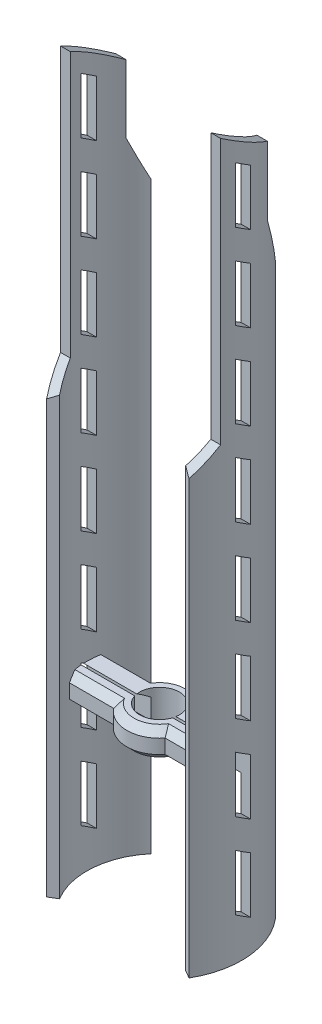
ISO-10303-21;
HEADER;
FILE_DESCRIPTION(('STEP AP214'),'2;1');
FILE_NAME('part.step','',(''),(''),'','','');
FILE_SCHEMA(('AUTOMOTIVE_DESIGN { 1 0 10303 214 1 1 1 1 }'));
ENDSEC;
DATA;
#1=APPLICATION_CONTEXT('core data for automotive mechanical design processes');
#2=APPLICATION_PROTOCOL_DEFINITION('international standard','automotive_design',2000,#1);
#3=PRODUCT_CONTEXT('',#1,'mechanical');
#4=PRODUCT('Part','Part','',(#3));
#5=PRODUCT_RELATED_PRODUCT_CATEGORY('part','',(#4));
#6=PRODUCT_DEFINITION_FORMATION('','',#4);
#7=PRODUCT_DEFINITION_CONTEXT('part definition',#1,'design');
#8=PRODUCT_DEFINITION('design','',#6,#7);
#9=PRODUCT_DEFINITION_SHAPE('','',#8);
#10=(LENGTH_UNIT() NAMED_UNIT(*) SI_UNIT(.MILLI.,.METRE.));
#11=(NAMED_UNIT(*) PLANE_ANGLE_UNIT() SI_UNIT($,.RADIAN.));
#12=(NAMED_UNIT(*) SI_UNIT($,.STERADIAN.) SOLID_ANGLE_UNIT());
#13=UNCERTAINTY_MEASURE_WITH_UNIT(LENGTH_MEASURE(1.E-05),#10,'distance_accuracy_value','');
#14=(GEOMETRIC_REPRESENTATION_CONTEXT(3) GLOBAL_UNCERTAINTY_ASSIGNED_CONTEXT((#13)) GLOBAL_UNIT_ASSIGNED_CONTEXT((#10,
#11,#12)) REPRESENTATION_CONTEXT('',''));
#15=CARTESIAN_POINT('',(0.,0.,0.));
#16=DIRECTION('',(0.,0.,1.));
#17=DIRECTION('',(1.,0.,0.));
#18=AXIS2_PLACEMENT_3D('',#15,#16,#17);
#19=CARTESIAN_POINT('',(0.,200.,0.));
#20=DIRECTION('',(0.,-1.,0.));
#21=DIRECTION('',(0.,0.,-1.));
#22=AXIS2_PLACEMENT_3D('',#19,#20,#21);
#23=CYLINDRICAL_SURFACE('',#22,25.6733842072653);
#24=CARTESIAN_POINT('',(0.,196.066372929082,0.));
#25=DIRECTION('',(0.,-0.861924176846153,0.507037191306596));
#26=DIRECTION('',(0.,-0.507037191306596,-0.861924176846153));
#27=AXIS2_PLACEMENT_3D('',#24,#25,#26);
#28=ELLIPSE('',#27,29.7861284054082,25.6733842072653);
#29=CARTESIAN_POINT('',(23.0571941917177,189.424261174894,-11.2910784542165));
#30=VERTEX_POINT('',#29);
#31=CARTESIAN_POINT('',(24.7872652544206,200.,6.686863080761));
#32=VERTEX_POINT('',#31);
#33=EDGE_CURVE('E1048',#30,#32,#28,.T.);
#34=ORIENTED_EDGE('',*,*,#33,.F.);
#35=DIRECTION('',(0.,-1.,0.));
#36=VECTOR('',#35,1.);
#37=CARTESIAN_POINT('',(23.0571941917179,200.,-11.2910784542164));
#38=LINE('',#37,#36);
#39=CARTESIAN_POINT('',(23.0571941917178,165.435113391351,-11.2910784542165));
#40=VERTEX_POINT('',#39);
#41=EDGE_CURVE('E1061',#40,#30,#38,.F.);
#42=ORIENTED_EDGE('',*,*,#41,.F.);
#43=CARTESIAN_POINT('',(0.,193.976450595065,0.));
#44=DIRECTION('',(0.,-0.36786439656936,0.92987944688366));
#45=DIRECTION('',(0.,-0.92987944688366,-0.36786439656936));
#46=AXIS2_PLACEMENT_3D('',#43,#44,#45);
#47=ELLIPSE('',#46,69.7903478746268,25.6733842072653);
#48=CARTESIAN_POINT('',(19.6201512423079,152.12112771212,-16.5581497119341));
#49=VERTEX_POINT('',#48);
#50=EDGE_CURVE('E1072',#49,#40,#47,.T.);
#51=ORIENTED_EDGE('',*,*,#50,.F.);
#52=DIRECTION('',(0.,-1.,0.));
#53=VECTOR('',#52,1.);
#54=CARTESIAN_POINT('',(19.6201512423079,200.,-16.5581497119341));
#55=LINE('',#54,#53);
#56=CARTESIAN_POINT('',(19.6201512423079,-54.,-16.5581497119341));
#57=VERTEX_POINT('',#56);
#58=EDGE_CURVE('E1151',#49,#57,#55,.T.);
#59=ORIENTED_EDGE('',*,*,#58,.T.);
#60=CARTESIAN_POINT('',(0.,-54.,0.));
#61=DIRECTION('',(0.,1.,0.));
#62=DIRECTION('',(0.,0.,-1.));
#63=AXIS2_PLACEMENT_3D('',#60,#61,#62);
#64=CIRCLE('',#63,25.6733842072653);
#65=CARTESIAN_POINT('',(22.1624224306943,-54.,12.9595404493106));
#66=VERTEX_POINT('',#65);
#67=EDGE_CURVE('E1139',#66,#57,#64,.T.);
#68=ORIENTED_EDGE('',*,*,#67,.F.);
#69=DIRECTION('',(0.,-1.,0.));
#70=VECTOR('',#69,1.);
#71=CARTESIAN_POINT('',(22.1624224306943,200.,12.9595404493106));
#72=LINE('',#71,#70);
#73=CARTESIAN_POINT('',(22.1624224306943,100.148946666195,12.9595404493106));
#74=VERTEX_POINT('',#73);
#75=EDGE_CURVE('E1152',#74,#66,#72,.T.);
#76=ORIENTED_EDGE('',*,*,#75,.F.);
#77=CARTESIAN_POINT('',(0.,113.108487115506,0.));
#78=DIRECTION('',(0.,-0.707106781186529,-0.707106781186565));
#79=DIRECTION('',(0.,-0.707106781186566,0.70710678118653));
#80=AXIS2_PLACEMENT_3D('',#77,#78,#79);
#81=ELLIPSE('',#80,36.3076481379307,25.6733842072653);
#82=CARTESIAN_POINT('',(24.7872652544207,106.421624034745,6.686863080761));
#83=VERTEX_POINT('',#82);
#84=EDGE_CURVE('E1098',#83,#74,#81,.T.);
#85=ORIENTED_EDGE('',*,*,#84,.F.);
#86=DIRECTION('',(0.,-1.,0.));
#87=VECTOR('',#86,1.);
#88=CARTESIAN_POINT('',(24.7872652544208,200.,6.686863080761));
#89=LINE('',#88,#87);
#90=EDGE_CURVE('E1088',#32,#83,#89,.T.);
#91=ORIENTED_EDGE('',*,*,#90,.F.);
#92=EDGE_LOOP('',(#34,#42,#51,#59,#68,#76,#85,#91));
#93=FACE_BOUND('',#92,.T.);
#94=CARTESIAN_POINT('',(0.,189.285018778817,0.));
#95=DIRECTION('',(0.,-0.841178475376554,0.540757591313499));
#96=DIRECTION('',(0.,-0.540757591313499,-0.841178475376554));
#97=AXIS2_PLACEMENT_3D('',#94,#95,#96);
#98=ELLIPSE('',#97,30.5207336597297,25.6733842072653);
#99=CARTESIAN_POINT('',(25.4661504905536,187.192241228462,-3.25543174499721));
#100=VERTEX_POINT('',#99);
#101=CARTESIAN_POINT('',(25.5914112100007,190.602849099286,2.04995827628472));
#102=VERTEX_POINT('',#101);
#103=EDGE_CURVE('E1027',#100,#102,#98,.T.);
#104=ORIENTED_EDGE('',*,*,#103,.T.);
#105=DIRECTION('',(0.,-1.,0.));
#106=VECTOR('',#105,1.);
#107=CARTESIAN_POINT('',(25.5914112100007,200.,2.04995827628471));
#108=LINE('',#107,#106);
#109=CARTESIAN_POINT('',(25.5914112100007,170.897114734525,2.04995827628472));
#110=VERTEX_POINT('',#109);
#111=EDGE_CURVE('E1036',#102,#110,#108,.T.);
#112=ORIENTED_EDGE('',*,*,#111,.T.);
#113=CARTESIAN_POINT('',(0.,169.579284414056,0.));
#114=DIRECTION('',(0.,0.841178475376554,-0.540757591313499));
#115=DIRECTION('',(0.,-0.540757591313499,-0.841178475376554));
#116=AXIS2_PLACEMENT_3D('',#113,#114,#115);
#117=ELLIPSE('',#116,30.5207336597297,25.6733842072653);
#118=CARTESIAN_POINT('',(25.4661504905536,167.4865068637,-3.25543174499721));
#119=VERTEX_POINT('',#118);
#120=EDGE_CURVE('E1009',#110,#119,#117,.T.);
#121=ORIENTED_EDGE('',*,*,#120,.T.);
#122=DIRECTION('',(0.,-1.,0.));
#123=VECTOR('',#122,1.);
#124=CARTESIAN_POINT('',(25.4661504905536,200.,-3.25543174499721));
#125=LINE('',#124,#123);
#126=EDGE_CURVE('E1018',#119,#100,#125,.F.);
#127=ORIENTED_EDGE('',*,*,#126,.T.);
#128=EDGE_LOOP('',(#104,#112,#121,#127));
#129=FACE_BOUND('',#128,.T.);
#130=CARTESIAN_POINT('',(0.,159.285018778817,0.));
#131=DIRECTION('',(0.,-0.841178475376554,0.540757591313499));
#132=DIRECTION('',(0.,-0.540757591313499,-0.841178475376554));
#133=AXIS2_PLACEMENT_3D('',#130,#131,#132);
#134=ELLIPSE('',#133,30.5207336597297,25.6733842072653);
#135=CARTESIAN_POINT('',(25.4661504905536,157.192241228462,-3.25543174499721));
#136=VERTEX_POINT('',#135);
#137=CARTESIAN_POINT('',(25.5914112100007,160.602849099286,2.04995827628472));
#138=VERTEX_POINT('',#137);
#139=EDGE_CURVE('E976',#136,#138,#134,.T.);
#140=ORIENTED_EDGE('',*,*,#139,.T.);
#141=DIRECTION('',(0.,-1.,0.));
#142=VECTOR('',#141,1.);
#143=CARTESIAN_POINT('',(25.5914112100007,200.,2.04995827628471));
#144=LINE('',#143,#142);
#145=CARTESIAN_POINT('',(25.5914112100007,140.897114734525,2.04995827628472));
#146=VERTEX_POINT('',#145);
#147=EDGE_CURVE('E985',#138,#146,#144,.T.);
#148=ORIENTED_EDGE('',*,*,#147,.T.);
#149=CARTESIAN_POINT('',(0.,139.579284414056,0.));
#150=DIRECTION('',(0.,0.841178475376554,-0.540757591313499));
#151=DIRECTION('',(0.,-0.540757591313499,-0.841178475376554));
#152=AXIS2_PLACEMENT_3D('',#149,#150,#151);
#153=ELLIPSE('',#152,30.5207336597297,25.6733842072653);
#154=CARTESIAN_POINT('',(25.4661504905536,137.4865068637,-3.25543174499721));
#155=VERTEX_POINT('',#154);
#156=EDGE_CURVE('E958',#146,#155,#153,.T.);
#157=ORIENTED_EDGE('',*,*,#156,.T.);
#158=DIRECTION('',(0.,-1.,0.));
#159=VECTOR('',#158,1.);
#160=CARTESIAN_POINT('',(25.4661504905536,200.,-3.25543174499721));
#161=LINE('',#160,#159);
#162=EDGE_CURVE('E967',#155,#136,#161,.F.);
#163=ORIENTED_EDGE('',*,*,#162,.T.);
#164=EDGE_LOOP('',(#140,#148,#157,#163));
#165=FACE_BOUND('',#164,.T.);
#166=CARTESIAN_POINT('',(0.,-20.7149812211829,0.));
#167=DIRECTION('',(0.,-0.841178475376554,0.540757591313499));
#168=DIRECTION('',(0.,-0.540757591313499,-0.841178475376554));
#169=AXIS2_PLACEMENT_3D('',#166,#167,#168);
#170=ELLIPSE('',#169,30.5207336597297,25.6733842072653);
#171=CARTESIAN_POINT('',(25.4661504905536,-22.8077587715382,-3.25543174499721));
#172=VERTEX_POINT('',#171);
#173=CARTESIAN_POINT('',(25.5914112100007,-19.3971509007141,2.04995827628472));
#174=VERTEX_POINT('',#173);
#175=EDGE_CURVE('E777',#172,#174,#170,.T.);
#176=ORIENTED_EDGE('',*,*,#175,.T.);
#177=DIRECTION('',(0.,-1.,0.));
#178=VECTOR('',#177,1.);
#179=CARTESIAN_POINT('',(25.5914112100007,200.,2.04995827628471));
#180=LINE('',#179,#178);
#181=CARTESIAN_POINT('',(25.5914112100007,-39.1028852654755,2.04995827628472));
#182=VERTEX_POINT('',#181);
#183=EDGE_CURVE('E686',#174,#182,#180,.T.);
#184=ORIENTED_EDGE('',*,*,#183,.T.);
#185=CARTESIAN_POINT('',(0.,-40.4207155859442,0.));
#186=DIRECTION('',(0.,0.841178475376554,-0.540757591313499));
#187=DIRECTION('',(0.,-0.540757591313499,-0.841178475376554));
#188=AXIS2_PLACEMENT_3D('',#185,#186,#187);
#189=ELLIPSE('',#188,30.5207336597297,25.6733842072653);
#190=CARTESIAN_POINT('',(25.4661504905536,-42.5134931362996,-3.25543174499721));
#191=VERTEX_POINT('',#190);
#192=EDGE_CURVE('E759',#182,#191,#189,.T.);
#193=ORIENTED_EDGE('',*,*,#192,.T.);
#194=DIRECTION('',(0.,-1.,0.));
#195=VECTOR('',#194,1.);
#196=CARTESIAN_POINT('',(25.4661504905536,200.,-3.25543174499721));
#197=LINE('',#196,#195);
#198=EDGE_CURVE('E768',#191,#172,#197,.F.);
#199=ORIENTED_EDGE('',*,*,#198,.T.);
#200=EDGE_LOOP('',(#176,#184,#193,#199));
#201=FACE_BOUND('',#200,.T.);
#202=CARTESIAN_POINT('',(0.,9.2850187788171,0.));
#203=DIRECTION('',(0.,-0.841178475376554,0.540757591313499));
#204=DIRECTION('',(0.,-0.540757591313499,-0.841178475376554));
#205=AXIS2_PLACEMENT_3D('',#202,#203,#204);
#206=ELLIPSE('',#205,30.5207336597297,25.6733842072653);
#207=CARTESIAN_POINT('',(25.6492823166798,10.,1.11219301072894));
#208=VERTEX_POINT('',#207);
#209=CARTESIAN_POINT('',(25.5914112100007,10.6028490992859,2.04995827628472));
#210=VERTEX_POINT('',#209);
#211=EDGE_CURVE('E723',#208,#210,#206,.T.);
#212=ORIENTED_EDGE('',*,*,#211,.T.);
#213=DIRECTION('',(0.,-1.,0.));
#214=VECTOR('',#213,1.);
#215=CARTESIAN_POINT('',(25.5914112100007,200.,2.04995827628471));
#216=LINE('',#215,#214);
#217=CARTESIAN_POINT('',(25.5914112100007,10.,2.04995827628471));
#218=VERTEX_POINT('',#217);
#219=EDGE_CURVE('E746',#210,#218,#216,.T.);
#220=ORIENTED_EDGE('',*,*,#219,.T.);
#221=CARTESIAN_POINT('',(0.,10.,0.));
#222=DIRECTION('',(0.,1.,0.));
#223=DIRECTION('',(0.,0.,1.));
#224=AXIS2_PLACEMENT_3D('',#221,#222,#223);
#225=CIRCLE('',#224,25.6733842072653);
#226=CARTESIAN_POINT('',(25.2624138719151,10.,4.5752707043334));
#227=VERTEX_POINT('',#226);
#228=EDGE_CURVE('E1173',#218,#227,#225,.F.);
#229=ORIENTED_EDGE('',*,*,#228,.T.);
#230=CARTESIAN_POINT('',(0.,14.5752707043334,0.));
#231=DIRECTION('',(0.,0.707106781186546,0.707106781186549));
#232=DIRECTION('',(0.,-0.707106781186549,0.707106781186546));
#233=AXIS2_PLACEMENT_3D('',#230,#231,#232);
#234=ELLIPSE('',#233,36.3076481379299,25.6733842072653);
#235=CARTESIAN_POINT('',(24.6792058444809,7.49999999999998,7.07527070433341));
#236=VERTEX_POINT('',#235);
#237=EDGE_CURVE('E1168',#227,#236,#234,.F.);
#238=ORIENTED_EDGE('',*,*,#237,.T.);
#239=DIRECTION('',(0.,-1.,0.));
#240=VECTOR('',#239,1.);
#241=CARTESIAN_POINT('',(24.6792058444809,200.,7.07527070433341));
#242=LINE('',#241,#240);
#243=CARTESIAN_POINT('',(24.6792058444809,2.5,7.07527070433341));
#244=VERTEX_POINT('',#243);
#245=EDGE_CURVE('E1154',#244,#236,#242,.F.);
#246=ORIENTED_EDGE('',*,*,#245,.F.);
#247=CARTESIAN_POINT('',(0.,-4.57527070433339,0.));
#248=DIRECTION('',(0.,0.707106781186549,-0.707106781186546));
#249=DIRECTION('',(0.,-0.707106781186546,-0.707106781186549));
#250=AXIS2_PLACEMENT_3D('',#247,#248,#249);
#251=ELLIPSE('',#250,36.3076481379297,25.6733842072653);
#252=CARTESIAN_POINT('',(25.2624138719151,0.,4.5752707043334));
#253=VERTEX_POINT('',#252);
#254=EDGE_CURVE('E1258',#244,#253,#251,.T.);
#255=ORIENTED_EDGE('',*,*,#254,.T.);
#256=CARTESIAN_POINT('',(0.,0.,0.));
#257=DIRECTION('',(0.,1.,0.));
#258=DIRECTION('',(0.,0.,1.));
#259=AXIS2_PLACEMENT_3D('',#256,#257,#258);
#260=CIRCLE('',#259,25.6733842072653);
#261=CARTESIAN_POINT('',(25.5914112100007,0.,2.04995827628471));
#262=VERTEX_POINT('',#261);
#263=EDGE_CURVE('E1161',#262,#253,#260,.F.);
#264=ORIENTED_EDGE('',*,*,#263,.F.);
#265=CARTESIAN_POINT('',(25.5914112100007,-9.10288526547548,2.04995827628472));
#266=VERTEX_POINT('',#265);
#267=EDGE_CURVE('E743',#262,#266,#216,.T.);
#268=ORIENTED_EDGE('',*,*,#267,.T.);
#269=CARTESIAN_POINT('',(0.,-10.4207155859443,0.));
#270=DIRECTION('',(0.,0.841178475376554,-0.540757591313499));
#271=DIRECTION('',(0.,-0.540757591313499,-0.841178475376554));
#272=AXIS2_PLACEMENT_3D('',#269,#270,#271);
#273=ELLIPSE('',#272,30.5207336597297,25.6733842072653);
#274=CARTESIAN_POINT('',(25.4661504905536,-12.5134931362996,-3.25543174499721));
#275=VERTEX_POINT('',#274);
#276=EDGE_CURVE('E790',#266,#275,#273,.T.);
#277=ORIENTED_EDGE('',*,*,#276,.T.);
#278=DIRECTION('',(0.,-1.,0.));
#279=VECTOR('',#278,1.);
#280=CARTESIAN_POINT('',(25.4661504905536,200.,-3.25543174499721));
#281=LINE('',#280,#279);
#282=CARTESIAN_POINT('',(25.4661504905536,0.,-3.25543174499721));
#283=VERTEX_POINT('',#282);
#284=EDGE_CURVE('E709',#275,#283,#281,.F.);
#285=ORIENTED_EDGE('',*,*,#284,.T.);
#286=CARTESIAN_POINT('',(25.2624138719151,0.,-4.5752707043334));
#287=VERTEX_POINT('',#286);
#288=EDGE_CURVE('E1162',#287,#283,#260,.F.);
#289=ORIENTED_EDGE('',*,*,#288,.F.);
#290=CARTESIAN_POINT('',(0.,-4.57527070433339,0.));
#291=DIRECTION('',(0.,0.707106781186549,0.707106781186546));
#292=DIRECTION('',(0.,-0.707106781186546,0.707106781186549));
#293=AXIS2_PLACEMENT_3D('',#290,#291,#292);
#294=ELLIPSE('',#293,36.3076481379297,25.6733842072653);
#295=CARTESIAN_POINT('',(24.6792058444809,2.5,-7.07527070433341));
#296=VERTEX_POINT('',#295);
#297=EDGE_CURVE('E1165',#287,#296,#294,.T.);
#298=ORIENTED_EDGE('',*,*,#297,.T.);
#299=DIRECTION('',(0.,-1.,0.));
#300=VECTOR('',#299,1.);
#301=CARTESIAN_POINT('',(24.6792058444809,200.,-7.07527070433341));
#302=LINE('',#301,#300);
#303=CARTESIAN_POINT('',(24.6792058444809,7.49999999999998,-7.07527070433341));
#304=VERTEX_POINT('',#303);
#305=EDGE_CURVE('E1171',#304,#296,#302,.T.);
#306=ORIENTED_EDGE('',*,*,#305,.F.);
#307=CARTESIAN_POINT('',(0.,14.5752707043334,0.));
#308=DIRECTION('',(0.,0.707106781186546,-0.707106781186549));
#309=DIRECTION('',(0.,-0.707106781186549,-0.707106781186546));
#310=AXIS2_PLACEMENT_3D('',#307,#308,#309);
#311=ELLIPSE('',#310,36.3076481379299,25.6733842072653);
#312=CARTESIAN_POINT('',(25.2624138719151,10.,-4.5752707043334));
#313=VERTEX_POINT('',#312);
#314=EDGE_CURVE('E1177',#304,#313,#311,.F.);
#315=ORIENTED_EDGE('',*,*,#314,.T.);
#316=EDGE_CURVE('E1174',#313,#208,#225,.F.);
#317=ORIENTED_EDGE('',*,*,#316,.T.);
#318=EDGE_LOOP('',(#212,#220,#229,#238,#246,#255,#264,#268,#277,#285,#289,#298,#306,#315,#317));
#319=FACE_BOUND('',#318,.T.);
#320=CARTESIAN_POINT('',(0.,39.2850187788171,0.));
#321=DIRECTION('',(0.,-0.841178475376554,0.540757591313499));
#322=DIRECTION('',(0.,-0.540757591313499,-0.841178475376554));
#323=AXIS2_PLACEMENT_3D('',#320,#321,#322);
#324=ELLIPSE('',#323,30.5207336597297,25.6733842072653);
#325=CARTESIAN_POINT('',(25.4661504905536,37.1922412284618,-3.25543174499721));
#326=VERTEX_POINT('',#325);
#327=CARTESIAN_POINT('',(25.5914112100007,40.6028490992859,2.04995827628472));
#328=VERTEX_POINT('',#327);
#329=EDGE_CURVE('E817',#326,#328,#324,.T.);
#330=ORIENTED_EDGE('',*,*,#329,.T.);
#331=DIRECTION('',(0.,-1.,0.));
#332=VECTOR('',#331,1.);
#333=CARTESIAN_POINT('',(25.5914112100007,200.,2.04995827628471));
#334=LINE('',#333,#332);
#335=CARTESIAN_POINT('',(25.5914112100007,20.8971147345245,2.04995827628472));
#336=VERTEX_POINT('',#335);
#337=EDGE_CURVE('E826',#328,#336,#334,.T.);
#338=ORIENTED_EDGE('',*,*,#337,.T.);
#339=CARTESIAN_POINT('',(0.,19.5792844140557,0.));
#340=DIRECTION('',(0.,0.841178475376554,-0.540757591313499));
#341=DIRECTION('',(0.,-0.540757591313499,-0.841178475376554));
#342=AXIS2_PLACEMENT_3D('',#339,#340,#341);
#343=ELLIPSE('',#342,30.5207336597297,25.6733842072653);
#344=CARTESIAN_POINT('',(25.4661504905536,17.4865068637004,-3.25543174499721));
#345=VERTEX_POINT('',#344);
#346=EDGE_CURVE('E799',#336,#345,#343,.T.);
#347=ORIENTED_EDGE('',*,*,#346,.T.);
#348=DIRECTION('',(0.,-1.,0.));
#349=VECTOR('',#348,1.);
#350=CARTESIAN_POINT('',(25.4661504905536,200.,-3.25543174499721));
#351=LINE('',#350,#349);
#352=EDGE_CURVE('E808',#345,#326,#351,.F.);
#353=ORIENTED_EDGE('',*,*,#352,.T.);
#354=EDGE_LOOP('',(#330,#338,#347,#353));
#355=FACE_BOUND('',#354,.T.);
#356=CARTESIAN_POINT('',(0.,69.2850187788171,0.));
#357=DIRECTION('',(0.,-0.841178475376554,0.540757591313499));
#358=DIRECTION('',(0.,-0.540757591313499,-0.841178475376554));
#359=AXIS2_PLACEMENT_3D('',#356,#357,#358);
#360=ELLIPSE('',#359,30.5207336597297,25.6733842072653);
#361=CARTESIAN_POINT('',(25.4661504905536,67.1922412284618,-3.25543174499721));
#362=VERTEX_POINT('',#361);
#363=CARTESIAN_POINT('',(25.5914112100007,70.6028490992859,2.04995827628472));
#364=VERTEX_POINT('',#363);
#365=EDGE_CURVE('E853',#362,#364,#360,.T.);
#366=ORIENTED_EDGE('',*,*,#365,.T.);
#367=DIRECTION('',(0.,-1.,0.));
#368=VECTOR('',#367,1.);
#369=CARTESIAN_POINT('',(25.5914112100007,200.,2.04995827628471));
#370=LINE('',#369,#368);
#371=CARTESIAN_POINT('',(25.5914112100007,50.8971147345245,2.04995827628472));
#372=VERTEX_POINT('',#371);
#373=EDGE_CURVE('E862',#364,#372,#370,.T.);
#374=ORIENTED_EDGE('',*,*,#373,.T.);
#375=CARTESIAN_POINT('',(0.,49.5792844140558,0.));
#376=DIRECTION('',(0.,0.841178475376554,-0.540757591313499));
#377=DIRECTION('',(0.,-0.540757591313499,-0.841178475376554));
#378=AXIS2_PLACEMENT_3D('',#375,#376,#377);
#379=ELLIPSE('',#378,30.5207336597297,25.6733842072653);
#380=CARTESIAN_POINT('',(25.4661504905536,47.4865068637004,-3.25543174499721));
#381=VERTEX_POINT('',#380);
#382=EDGE_CURVE('E835',#372,#381,#379,.T.);
#383=ORIENTED_EDGE('',*,*,#382,.T.);
#384=DIRECTION('',(0.,-1.,0.));
#385=VECTOR('',#384,1.);
#386=CARTESIAN_POINT('',(25.4661504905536,200.,-3.25543174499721));
#387=LINE('',#386,#385);
#388=EDGE_CURVE('E844',#381,#362,#387,.F.);
#389=ORIENTED_EDGE('',*,*,#388,.T.);
#390=EDGE_LOOP('',(#366,#374,#383,#389));
#391=FACE_BOUND('',#390,.T.);
#392=CARTESIAN_POINT('',(0.,99.2850187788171,0.));
#393=DIRECTION('',(0.,-0.841178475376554,0.540757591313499));
#394=DIRECTION('',(0.,-0.540757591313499,-0.841178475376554));
#395=AXIS2_PLACEMENT_3D('',#392,#393,#394);
#396=ELLIPSE('',#395,30.5207336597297,25.6733842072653);
#397=CARTESIAN_POINT('',(25.4661504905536,97.1922412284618,-3.25543174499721));
#398=VERTEX_POINT('',#397);
#399=CARTESIAN_POINT('',(25.5914112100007,100.602849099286,2.04995827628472));
#400=VERTEX_POINT('',#399);
#401=EDGE_CURVE('E889',#398,#400,#396,.T.);
#402=ORIENTED_EDGE('',*,*,#401,.T.);
#403=DIRECTION('',(0.,-1.,0.));
#404=VECTOR('',#403,1.);
#405=CARTESIAN_POINT('',(25.5914112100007,200.,2.04995827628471));
#406=LINE('',#405,#404);
#407=CARTESIAN_POINT('',(25.5914112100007,80.8971147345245,2.04995827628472));
#408=VERTEX_POINT('',#407);
#409=EDGE_CURVE('E898',#400,#408,#406,.T.);
#410=ORIENTED_EDGE('',*,*,#409,.T.);
#411=CARTESIAN_POINT('',(0.,79.5792844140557,0.));
#412=DIRECTION('',(0.,0.841178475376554,-0.540757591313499));
#413=DIRECTION('',(0.,-0.540757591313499,-0.841178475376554));
#414=AXIS2_PLACEMENT_3D('',#411,#412,#413);
#415=ELLIPSE('',#414,30.5207336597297,25.6733842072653);
#416=CARTESIAN_POINT('',(25.4661504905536,77.4865068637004,-3.25543174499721));
#417=VERTEX_POINT('',#416);
#418=EDGE_CURVE('E871',#408,#417,#415,.T.);
#419=ORIENTED_EDGE('',*,*,#418,.T.);
#420=DIRECTION('',(0.,-1.,0.));
#421=VECTOR('',#420,1.);
#422=CARTESIAN_POINT('',(25.4661504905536,200.,-3.25543174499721));
#423=LINE('',#422,#421);
#424=EDGE_CURVE('E880',#417,#398,#423,.F.);
#425=ORIENTED_EDGE('',*,*,#424,.T.);
#426=EDGE_LOOP('',(#402,#410,#419,#425));
#427=FACE_BOUND('',#426,.T.);
#428=CARTESIAN_POINT('',(0.,129.285018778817,0.));
#429=DIRECTION('',(0.,-0.841178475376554,0.540757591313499));
#430=DIRECTION('',(0.,-0.540757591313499,-0.841178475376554));
#431=AXIS2_PLACEMENT_3D('',#428,#429,#430);
#432=ELLIPSE('',#431,30.5207336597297,25.6733842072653);
#433=CARTESIAN_POINT('',(25.4661504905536,127.192241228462,-3.25543174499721));
#434=VERTEX_POINT('',#433);
#435=CARTESIAN_POINT('',(25.5914112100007,130.602849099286,2.04995827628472));
#436=VERTEX_POINT('',#435);
#437=EDGE_CURVE('E925',#434,#436,#432,.T.);
#438=ORIENTED_EDGE('',*,*,#437,.T.);
#439=DIRECTION('',(0.,-1.,0.));
#440=VECTOR('',#439,1.);
#441=CARTESIAN_POINT('',(25.5914112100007,200.,2.04995827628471));
#442=LINE('',#441,#440);
#443=CARTESIAN_POINT('',(25.5914112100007,110.897114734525,2.04995827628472));
#444=VERTEX_POINT('',#443);
#445=EDGE_CURVE('E934',#436,#444,#442,.T.);
#446=ORIENTED_EDGE('',*,*,#445,.T.);
#447=CARTESIAN_POINT('',(0.,109.579284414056,0.));
#448=DIRECTION('',(0.,0.841178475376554,-0.540757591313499));
#449=DIRECTION('',(0.,-0.540757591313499,-0.841178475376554));
#450=AXIS2_PLACEMENT_3D('',#447,#448,#449);
#451=ELLIPSE('',#450,30.5207336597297,25.6733842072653);
#452=CARTESIAN_POINT('',(25.4661504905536,107.4865068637,-3.25543174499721));
#453=VERTEX_POINT('',#452);
#454=EDGE_CURVE('E907',#444,#453,#451,.T.);
#455=ORIENTED_EDGE('',*,*,#454,.T.);
#456=DIRECTION('',(0.,-1.,0.));
#457=VECTOR('',#456,1.);
#458=CARTESIAN_POINT('',(25.4661504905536,200.,-3.25543174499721));
#459=LINE('',#458,#457);
#460=EDGE_CURVE('E916',#453,#434,#459,.F.);
#461=ORIENTED_EDGE('',*,*,#460,.T.);
#462=EDGE_LOOP('',(#438,#446,#455,#461));
#463=FACE_BOUND('',#462,.T.);
#464=ADVANCED_FACE('F33',(#93,#129,#165,#201,#319,#355,#391,#427,#463),#23,.F.);
#465=CARTESIAN_POINT('',(0.,200.,0.));
#466=DIRECTION('',(0.,-1.,0.));
#467=DIRECTION('',(0.,0.,-1.));
#468=AXIS2_PLACEMENT_3D('',#465,#466,#467);
#469=CYLINDRICAL_SURFACE('',#468,29.);
#470=CARTESIAN_POINT('',(0.,196.066372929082,0.));
#471=DIRECTION('',(0.,-0.861924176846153,0.507037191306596));
#472=DIRECTION('',(0.,-0.507037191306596,-0.861924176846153));
#473=AXIS2_PLACEMENT_3D('',#470,#471,#472);
#474=ELLIPSE('',#473,33.6456509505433,29.);
#475=CARTESIAN_POINT('',(28.2185375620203,200.,6.686863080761));
#476=VERTEX_POINT('',#475);
#477=CARTESIAN_POINT('',(26.7116369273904,189.424261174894,-11.2910784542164));
#478=VERTEX_POINT('',#477);
#479=EDGE_CURVE('E1046',#476,#478,#474,.F.);
#480=ORIENTED_EDGE('',*,*,#479,.F.);
#481=DIRECTION('',(0.,-1.,0.));
#482=VECTOR('',#481,1.);
#483=CARTESIAN_POINT('',(28.2185375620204,200.,6.686863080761));
#484=LINE('',#483,#482);
#485=CARTESIAN_POINT('',(28.2185375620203,106.421624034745,6.686863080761));
#486=VERTEX_POINT('',#485);
#487=EDGE_CURVE('E1085',#486,#476,#484,.F.);
#488=ORIENTED_EDGE('',*,*,#487,.F.);
#489=CARTESIAN_POINT('',(0.,113.108487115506,0.));
#490=DIRECTION('',(0.,-0.707106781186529,-0.707106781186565));
#491=DIRECTION('',(0.,-0.707106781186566,0.70710678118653));
#492=AXIS2_PLACEMENT_3D('',#489,#490,#491);
#493=ELLIPSE('',#492,41.0121933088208,29.);
#494=CARTESIAN_POINT('',(25.0341071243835,98.4697207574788,14.6387663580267));
#495=VERTEX_POINT('',#494);
#496=EDGE_CURVE('E1094',#495,#486,#493,.F.);
#497=ORIENTED_EDGE('',*,*,#496,.F.);
#498=DIRECTION('',(0.,-1.,0.));
#499=VECTOR('',#498,1.);
#500=CARTESIAN_POINT('',(25.0341071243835,200.,14.6387663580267));
#501=LINE('',#500,#499);
#502=CARTESIAN_POINT('',(25.0341071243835,-54.,14.6387663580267));
#503=VERTEX_POINT('',#502);
#504=EDGE_CURVE('E1155',#495,#503,#501,.T.);
#505=ORIENTED_EDGE('',*,*,#504,.T.);
#506=CARTESIAN_POINT('',(0.,-54.,0.));
#507=DIRECTION('',(0.,-1.,0.));
#508=DIRECTION('',(0.,0.,-1.));
#509=AXIS2_PLACEMENT_3D('',#506,#507,#508);
#510=CIRCLE('',#509,29.);
#511=CARTESIAN_POINT('',(22.1624224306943,-54.,-18.703663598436));
#512=VERTEX_POINT('',#511);
#513=EDGE_CURVE('E1145',#512,#503,#510,.T.);
#514=ORIENTED_EDGE('',*,*,#513,.F.);
#515=DIRECTION('',(0.,-1.,0.));
#516=VECTOR('',#515,1.);
#517=CARTESIAN_POINT('',(22.1624224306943,200.,-18.703663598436));
#518=LINE('',#517,#516);
#519=CARTESIAN_POINT('',(22.1624224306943,146.697745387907,-18.703663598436));
#520=VERTEX_POINT('',#519);
#521=EDGE_CURVE('E1157',#520,#512,#518,.T.);
#522=ORIENTED_EDGE('',*,*,#521,.F.);
#523=CARTESIAN_POINT('',(0.,193.976450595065,0.));
#524=DIRECTION('',(0.,-0.36786439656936,0.92987944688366));
#525=DIRECTION('',(0.,-0.92987944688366,-0.36786439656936));
#526=AXIS2_PLACEMENT_3D('',#523,#524,#525);
#527=ELLIPSE('',#526,78.8333969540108,29.);
#528=CARTESIAN_POINT('',(26.7116369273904,165.435113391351,-11.2910784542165));
#529=VERTEX_POINT('',#528);
#530=EDGE_CURVE('E1070',#529,#520,#527,.F.);
#531=ORIENTED_EDGE('',*,*,#530,.F.);
#532=DIRECTION('',(0.,-1.,0.));
#533=VECTOR('',#532,1.);
#534=CARTESIAN_POINT('',(26.7116369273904,200.,-11.2910784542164));
#535=LINE('',#534,#533);
#536=EDGE_CURVE('E1059',#478,#529,#535,.T.);
#537=ORIENTED_EDGE('',*,*,#536,.F.);
#538=EDGE_LOOP('',(#480,#488,#497,#505,#514,#522,#531,#537));
#539=FACE_BOUND('',#538,.T.);
#540=CARTESIAN_POINT('',(0.,169.579284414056,0.));
#541=DIRECTION('',(0.,0.841178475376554,-0.540757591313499));
#542=DIRECTION('',(0.,-0.540757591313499,-0.841178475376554));
#543=AXIS2_PLACEMENT_3D('',#540,#541,#542);
#544=ELLIPSE('',#543,34.4754423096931,29.);
#545=CARTESIAN_POINT('',(28.8166993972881,167.4865068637,-3.25543174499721));
#546=VERTEX_POINT('',#545);
#547=CARTESIAN_POINT('',(28.9274553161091,170.897114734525,2.04995827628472));
#548=VERTEX_POINT('',#547);
#549=EDGE_CURVE('E1006',#546,#548,#544,.F.);
#550=ORIENTED_EDGE('',*,*,#549,.T.);
#551=DIRECTION('',(0.,-1.,0.));
#552=VECTOR('',#551,1.);
#553=CARTESIAN_POINT('',(28.9274553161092,200.,2.04995827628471));
#554=LINE('',#553,#552);
#555=CARTESIAN_POINT('',(28.9274553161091,190.602849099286,2.04995827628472));
#556=VERTEX_POINT('',#555);
#557=EDGE_CURVE('E1033',#548,#556,#554,.F.);
#558=ORIENTED_EDGE('',*,*,#557,.T.);
#559=CARTESIAN_POINT('',(0.,189.285018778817,0.));
#560=DIRECTION('',(0.,-0.841178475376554,0.540757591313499));
#561=DIRECTION('',(0.,-0.540757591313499,-0.841178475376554));
#562=AXIS2_PLACEMENT_3D('',#559,#560,#561);
#563=ELLIPSE('',#562,34.4754423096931,29.);
#564=CARTESIAN_POINT('',(28.8166993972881,187.192241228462,-3.25543174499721));
#565=VERTEX_POINT('',#564);
#566=EDGE_CURVE('E1024',#556,#565,#563,.F.);
#567=ORIENTED_EDGE('',*,*,#566,.T.);
#568=DIRECTION('',(0.,-1.,0.));
#569=VECTOR('',#568,1.);
#570=CARTESIAN_POINT('',(28.8166993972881,200.,-3.25543174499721));
#571=LINE('',#570,#569);
#572=EDGE_CURVE('E1015',#565,#546,#571,.T.);
#573=ORIENTED_EDGE('',*,*,#572,.T.);
#574=EDGE_LOOP('',(#550,#558,#567,#573));
#575=FACE_BOUND('',#574,.T.);
#576=CARTESIAN_POINT('',(0.,139.579284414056,0.));
#577=DIRECTION('',(0.,0.841178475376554,-0.540757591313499));
#578=DIRECTION('',(0.,-0.540757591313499,-0.841178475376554));
#579=AXIS2_PLACEMENT_3D('',#576,#577,#578);
#580=ELLIPSE('',#579,34.4754423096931,29.);
#581=CARTESIAN_POINT('',(28.8166993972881,137.4865068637,-3.25543174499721));
#582=VERTEX_POINT('',#581);
#583=CARTESIAN_POINT('',(28.9274553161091,140.897114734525,2.04995827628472));
#584=VERTEX_POINT('',#583);
#585=EDGE_CURVE('E955',#582,#584,#580,.F.);
#586=ORIENTED_EDGE('',*,*,#585,.T.);
#587=DIRECTION('',(0.,-1.,0.));
#588=VECTOR('',#587,1.);
#589=CARTESIAN_POINT('',(28.9274553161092,200.,2.04995827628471));
#590=LINE('',#589,#588);
#591=CARTESIAN_POINT('',(28.9274553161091,160.602849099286,2.04995827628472));
#592=VERTEX_POINT('',#591);
#593=EDGE_CURVE('E982',#584,#592,#590,.F.);
#594=ORIENTED_EDGE('',*,*,#593,.T.);
#595=CARTESIAN_POINT('',(0.,159.285018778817,0.));
#596=DIRECTION('',(0.,-0.841178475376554,0.540757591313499));
#597=DIRECTION('',(0.,-0.540757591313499,-0.841178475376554));
#598=AXIS2_PLACEMENT_3D('',#595,#596,#597);
#599=ELLIPSE('',#598,34.4754423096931,29.);
#600=CARTESIAN_POINT('',(28.8166993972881,157.192241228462,-3.25543174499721));
#601=VERTEX_POINT('',#600);
#602=EDGE_CURVE('E973',#592,#601,#599,.F.);
#603=ORIENTED_EDGE('',*,*,#602,.T.);
#604=DIRECTION('',(0.,-1.,0.));
#605=VECTOR('',#604,1.);
#606=CARTESIAN_POINT('',(28.8166993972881,200.,-3.25543174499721));
#607=LINE('',#606,#605);
#608=EDGE_CURVE('E964',#601,#582,#607,.T.);
#609=ORIENTED_EDGE('',*,*,#608,.T.);
#610=EDGE_LOOP('',(#586,#594,#603,#609));
#611=FACE_BOUND('',#610,.T.);
#612=CARTESIAN_POINT('',(0.,-40.4207155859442,0.));
#613=DIRECTION('',(0.,0.841178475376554,-0.540757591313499));
#614=DIRECTION('',(0.,-0.540757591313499,-0.841178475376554));
#615=AXIS2_PLACEMENT_3D('',#612,#613,#614);
#616=ELLIPSE('',#615,34.4754423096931,29.);
#617=CARTESIAN_POINT('',(28.8166993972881,-42.5134931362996,-3.25543174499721));
#618=VERTEX_POINT('',#617);
#619=CARTESIAN_POINT('',(28.9274553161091,-39.1028852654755,2.04995827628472));
#620=VERTEX_POINT('',#619);
#621=EDGE_CURVE('E756',#618,#620,#616,.F.);
#622=ORIENTED_EDGE('',*,*,#621,.T.);
#623=DIRECTION('',(0.,-1.,0.));
#624=VECTOR('',#623,1.);
#625=CARTESIAN_POINT('',(28.9274553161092,200.,2.04995827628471));
#626=LINE('',#625,#624);
#627=CARTESIAN_POINT('',(28.9274553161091,-19.3971509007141,2.04995827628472));
#628=VERTEX_POINT('',#627);
#629=EDGE_CURVE('E783',#620,#628,#626,.F.);
#630=ORIENTED_EDGE('',*,*,#629,.T.);
#631=CARTESIAN_POINT('',(0.,-20.7149812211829,0.));
#632=DIRECTION('',(0.,-0.841178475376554,0.540757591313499));
#633=DIRECTION('',(0.,-0.540757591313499,-0.841178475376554));
#634=AXIS2_PLACEMENT_3D('',#631,#632,#633);
#635=ELLIPSE('',#634,34.4754423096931,29.);
#636=CARTESIAN_POINT('',(28.8166993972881,-22.8077587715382,-3.25543174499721));
#637=VERTEX_POINT('',#636);
#638=EDGE_CURVE('E774',#628,#637,#635,.F.);
#639=ORIENTED_EDGE('',*,*,#638,.T.);
#640=DIRECTION('',(0.,-1.,0.));
#641=VECTOR('',#640,1.);
#642=CARTESIAN_POINT('',(28.8166993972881,200.,-3.25543174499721));
#643=LINE('',#642,#641);
#644=EDGE_CURVE('E765',#637,#618,#643,.T.);
#645=ORIENTED_EDGE('',*,*,#644,.T.);
#646=EDGE_LOOP('',(#622,#630,#639,#645));
#647=FACE_BOUND('',#646,.T.);
#648=CARTESIAN_POINT('',(0.,-10.4207155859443,0.));
#649=DIRECTION('',(0.,0.841178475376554,-0.540757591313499));
#650=DIRECTION('',(0.,-0.540757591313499,-0.841178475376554));
#651=AXIS2_PLACEMENT_3D('',#648,#649,#650);
#652=ELLIPSE('',#651,34.4754423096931,29.);
#653=CARTESIAN_POINT('',(28.8166993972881,-12.5134931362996,-3.25543174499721));
#654=VERTEX_POINT('',#653);
#655=CARTESIAN_POINT('',(28.9274553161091,-9.10288526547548,2.04995827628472));
#656=VERTEX_POINT('',#655);
#657=EDGE_CURVE('E685',#654,#656,#652,.F.);
#658=ORIENTED_EDGE('',*,*,#657,.T.);
#659=DIRECTION('',(0.,-1.,0.));
#660=VECTOR('',#659,1.);
#661=CARTESIAN_POINT('',(28.9274553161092,200.,2.04995827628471));
#662=LINE('',#661,#660);
#663=CARTESIAN_POINT('',(28.9274553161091,10.6028490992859,2.04995827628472));
#664=VERTEX_POINT('',#663);
#665=EDGE_CURVE('E750',#656,#664,#662,.F.);
#666=ORIENTED_EDGE('',*,*,#665,.T.);
#667=CARTESIAN_POINT('',(0.,9.2850187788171,0.));
#668=DIRECTION('',(0.,-0.841178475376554,0.540757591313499));
#669=DIRECTION('',(0.,-0.540757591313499,-0.841178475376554));
#670=AXIS2_PLACEMENT_3D('',#667,#668,#669);
#671=ELLIPSE('',#670,34.4754423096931,29.);
#672=CARTESIAN_POINT('',(28.8166993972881,7.19224122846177,-3.25543174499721));
#673=VERTEX_POINT('',#672);
#674=EDGE_CURVE('E729',#664,#673,#671,.F.);
#675=ORIENTED_EDGE('',*,*,#674,.T.);
#676=DIRECTION('',(0.,-1.,0.));
#677=VECTOR('',#676,1.);
#678=CARTESIAN_POINT('',(28.8166993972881,200.,-3.25543174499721));
#679=LINE('',#678,#677);
#680=EDGE_CURVE('E707',#673,#654,#679,.T.);
#681=ORIENTED_EDGE('',*,*,#680,.T.);
#682=EDGE_LOOP('',(#658,#666,#675,#681));
#683=FACE_BOUND('',#682,.T.);
#684=CARTESIAN_POINT('',(0.,19.5792844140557,0.));
#685=DIRECTION('',(0.,0.841178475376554,-0.540757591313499));
#686=DIRECTION('',(0.,-0.540757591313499,-0.841178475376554));
#687=AXIS2_PLACEMENT_3D('',#684,#685,#686);
#688=ELLIPSE('',#687,34.4754423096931,29.);
#689=CARTESIAN_POINT('',(28.8166993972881,17.4865068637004,-3.25543174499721));
#690=VERTEX_POINT('',#689);
#691=CARTESIAN_POINT('',(28.9274553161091,20.8971147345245,2.04995827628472));
#692=VERTEX_POINT('',#691);
#693=EDGE_CURVE('E796',#690,#692,#688,.F.);
#694=ORIENTED_EDGE('',*,*,#693,.T.);
#695=DIRECTION('',(0.,-1.,0.));
#696=VECTOR('',#695,1.);
#697=CARTESIAN_POINT('',(28.9274553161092,200.,2.04995827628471));
#698=LINE('',#697,#696);
#699=CARTESIAN_POINT('',(28.9274553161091,40.6028490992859,2.04995827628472));
#700=VERTEX_POINT('',#699);
#701=EDGE_CURVE('E823',#692,#700,#698,.F.);
#702=ORIENTED_EDGE('',*,*,#701,.T.);
#703=CARTESIAN_POINT('',(0.,39.2850187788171,0.));
#704=DIRECTION('',(0.,-0.841178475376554,0.540757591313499));
#705=DIRECTION('',(0.,-0.540757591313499,-0.841178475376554));
#706=AXIS2_PLACEMENT_3D('',#703,#704,#705);
#707=ELLIPSE('',#706,34.4754423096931,29.);
#708=CARTESIAN_POINT('',(28.8166993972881,37.1922412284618,-3.25543174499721));
#709=VERTEX_POINT('',#708);
#710=EDGE_CURVE('E814',#700,#709,#707,.F.);
#711=ORIENTED_EDGE('',*,*,#710,.T.);
#712=DIRECTION('',(0.,-1.,0.));
#713=VECTOR('',#712,1.);
#714=CARTESIAN_POINT('',(28.8166993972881,200.,-3.25543174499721));
#715=LINE('',#714,#713);
#716=EDGE_CURVE('E805',#709,#690,#715,.T.);
#717=ORIENTED_EDGE('',*,*,#716,.T.);
#718=EDGE_LOOP('',(#694,#702,#711,#717));
#719=FACE_BOUND('',#718,.T.);
#720=CARTESIAN_POINT('',(0.,49.5792844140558,0.));
#721=DIRECTION('',(0.,0.841178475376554,-0.540757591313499));
#722=DIRECTION('',(0.,-0.540757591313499,-0.841178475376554));
#723=AXIS2_PLACEMENT_3D('',#720,#721,#722);
#724=ELLIPSE('',#723,34.4754423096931,29.);
#725=CARTESIAN_POINT('',(28.8166993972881,47.4865068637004,-3.25543174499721));
#726=VERTEX_POINT('',#725);
#727=CARTESIAN_POINT('',(28.9274553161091,50.8971147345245,2.04995827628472));
#728=VERTEX_POINT('',#727);
#729=EDGE_CURVE('E832',#726,#728,#724,.F.);
#730=ORIENTED_EDGE('',*,*,#729,.T.);
#731=DIRECTION('',(0.,-1.,0.));
#732=VECTOR('',#731,1.);
#733=CARTESIAN_POINT('',(28.9274553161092,200.,2.04995827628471));
#734=LINE('',#733,#732);
#735=CARTESIAN_POINT('',(28.9274553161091,70.6028490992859,2.04995827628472));
#736=VERTEX_POINT('',#735);
#737=EDGE_CURVE('E859',#728,#736,#734,.F.);
#738=ORIENTED_EDGE('',*,*,#737,.T.);
#739=CARTESIAN_POINT('',(0.,69.2850187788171,0.));
#740=DIRECTION('',(0.,-0.841178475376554,0.540757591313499));
#741=DIRECTION('',(0.,-0.540757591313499,-0.841178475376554));
#742=AXIS2_PLACEMENT_3D('',#739,#740,#741);
#743=ELLIPSE('',#742,34.4754423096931,29.);
#744=CARTESIAN_POINT('',(28.8166993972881,67.1922412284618,-3.25543174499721));
#745=VERTEX_POINT('',#744);
#746=EDGE_CURVE('E850',#736,#745,#743,.F.);
#747=ORIENTED_EDGE('',*,*,#746,.T.);
#748=DIRECTION('',(0.,-1.,0.));
#749=VECTOR('',#748,1.);
#750=CARTESIAN_POINT('',(28.8166993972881,200.,-3.25543174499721));
#751=LINE('',#750,#749);
#752=EDGE_CURVE('E841',#745,#726,#751,.T.);
#753=ORIENTED_EDGE('',*,*,#752,.T.);
#754=EDGE_LOOP('',(#730,#738,#747,#753));
#755=FACE_BOUND('',#754,.T.);
#756=CARTESIAN_POINT('',(0.,79.5792844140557,0.));
#757=DIRECTION('',(0.,0.841178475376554,-0.540757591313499));
#758=DIRECTION('',(0.,-0.540757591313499,-0.841178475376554));
#759=AXIS2_PLACEMENT_3D('',#756,#757,#758);
#760=ELLIPSE('',#759,34.4754423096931,29.);
#761=CARTESIAN_POINT('',(28.8166993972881,77.4865068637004,-3.25543174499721));
#762=VERTEX_POINT('',#761);
#763=CARTESIAN_POINT('',(28.9274553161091,80.8971147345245,2.04995827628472));
#764=VERTEX_POINT('',#763);
#765=EDGE_CURVE('E868',#762,#764,#760,.F.);
#766=ORIENTED_EDGE('',*,*,#765,.T.);
#767=DIRECTION('',(0.,-1.,0.));
#768=VECTOR('',#767,1.);
#769=CARTESIAN_POINT('',(28.9274553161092,200.,2.04995827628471));
#770=LINE('',#769,#768);
#771=CARTESIAN_POINT('',(28.9274553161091,100.602849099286,2.04995827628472));
#772=VERTEX_POINT('',#771);
#773=EDGE_CURVE('E895',#764,#772,#770,.F.);
#774=ORIENTED_EDGE('',*,*,#773,.T.);
#775=CARTESIAN_POINT('',(0.,99.2850187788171,0.));
#776=DIRECTION('',(0.,-0.841178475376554,0.540757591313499));
#777=DIRECTION('',(0.,-0.540757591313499,-0.841178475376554));
#778=AXIS2_PLACEMENT_3D('',#775,#776,#777);
#779=ELLIPSE('',#778,34.4754423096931,29.);
#780=CARTESIAN_POINT('',(28.8166993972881,97.1922412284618,-3.25543174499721));
#781=VERTEX_POINT('',#780);
#782=EDGE_CURVE('E886',#772,#781,#779,.F.);
#783=ORIENTED_EDGE('',*,*,#782,.T.);
#784=DIRECTION('',(0.,-1.,0.));
#785=VECTOR('',#784,1.);
#786=CARTESIAN_POINT('',(28.8166993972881,200.,-3.25543174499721));
#787=LINE('',#786,#785);
#788=EDGE_CURVE('E877',#781,#762,#787,.T.);
#789=ORIENTED_EDGE('',*,*,#788,.T.);
#790=EDGE_LOOP('',(#766,#774,#783,#789));
#791=FACE_BOUND('',#790,.T.);
#792=CARTESIAN_POINT('',(0.,109.579284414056,0.));
#793=DIRECTION('',(0.,0.841178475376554,-0.540757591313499));
#794=DIRECTION('',(0.,-0.540757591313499,-0.841178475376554));
#795=AXIS2_PLACEMENT_3D('',#792,#793,#794);
#796=ELLIPSE('',#795,34.4754423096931,29.);
#797=CARTESIAN_POINT('',(28.8166993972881,107.4865068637,-3.25543174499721));
#798=VERTEX_POINT('',#797);
#799=CARTESIAN_POINT('',(28.9274553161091,110.897114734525,2.04995827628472));
#800=VERTEX_POINT('',#799);
#801=EDGE_CURVE('E904',#798,#800,#796,.F.);
#802=ORIENTED_EDGE('',*,*,#801,.T.);
#803=DIRECTION('',(0.,-1.,0.));
#804=VECTOR('',#803,1.);
#805=CARTESIAN_POINT('',(28.9274553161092,200.,2.04995827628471));
#806=LINE('',#805,#804);
#807=CARTESIAN_POINT('',(28.9274553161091,130.602849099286,2.04995827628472));
#808=VERTEX_POINT('',#807);
#809=EDGE_CURVE('E931',#800,#808,#806,.F.);
#810=ORIENTED_EDGE('',*,*,#809,.T.);
#811=CARTESIAN_POINT('',(0.,129.285018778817,0.));
#812=DIRECTION('',(0.,-0.841178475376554,0.540757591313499));
#813=DIRECTION('',(0.,-0.540757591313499,-0.841178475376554));
#814=AXIS2_PLACEMENT_3D('',#811,#812,#813);
#815=ELLIPSE('',#814,34.4754423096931,29.);
#816=CARTESIAN_POINT('',(28.8166993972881,127.192241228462,-3.25543174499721));
#817=VERTEX_POINT('',#816);
#818=EDGE_CURVE('E922',#808,#817,#815,.F.);
#819=ORIENTED_EDGE('',*,*,#818,.T.);
#820=DIRECTION('',(0.,-1.,0.));
#821=VECTOR('',#820,1.);
#822=CARTESIAN_POINT('',(28.8166993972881,200.,-3.25543174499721));
#823=LINE('',#822,#821);
#824=EDGE_CURVE('E913',#817,#798,#823,.T.);
#825=ORIENTED_EDGE('',*,*,#824,.T.);
#826=EDGE_LOOP('',(#802,#810,#819,#825));
#827=FACE_BOUND('',#826,.T.);
#828=ADVANCED_FACE('F1362',(#539,#575,#611,#647,#683,#719,#755,#791,#827),#469,.T.);
#829=CARTESIAN_POINT('',(0.,200.,0.));
#830=DIRECTION('',(0.,-1.,0.));
#831=DIRECTION('',(0.,0.,-1.));
#832=AXIS2_PLACEMENT_3D('',#829,#830,#831);
#833=CYLINDRICAL_SURFACE('',#832,25.6733842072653);
#834=CARTESIAN_POINT('',(0.,196.066372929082,0.));
#835=DIRECTION('',(0.,-0.861924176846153,0.507037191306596));
#836=DIRECTION('',(0.,-0.507037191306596,-0.861924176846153));
#837=AXIS2_PLACEMENT_3D('',#834,#835,#836);
#838=ELLIPSE('',#837,29.7861284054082,25.6733842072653);
#839=CARTESIAN_POINT('',(-24.7872652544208,200.,6.686863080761));
#840=VERTEX_POINT('',#839);
#841=CARTESIAN_POINT('',(-23.0571941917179,189.424261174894,-11.2910784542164));
#842=VERTEX_POINT('',#841);
#843=EDGE_CURVE('E1044',#840,#842,#838,.T.);
#844=ORIENTED_EDGE('',*,*,#843,.F.);
#845=DIRECTION('',(0.,-1.,0.));
#846=VECTOR('',#845,1.);
#847=CARTESIAN_POINT('',(-24.7872652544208,200.,6.686863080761));
#848=LINE('',#847,#846);
#849=CARTESIAN_POINT('',(-24.7872652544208,106.421624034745,6.686863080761));
#850=VERTEX_POINT('',#849);
#851=EDGE_CURVE('E1082',#850,#840,#848,.F.);
#852=ORIENTED_EDGE('',*,*,#851,.F.);
#853=CARTESIAN_POINT('',(0.,113.108487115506,0.));
#854=DIRECTION('',(0.,-0.707106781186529,-0.707106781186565));
#855=DIRECTION('',(0.,-0.707106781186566,0.70710678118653));
#856=AXIS2_PLACEMENT_3D('',#853,#854,#855);
#857=ELLIPSE('',#856,36.3076481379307,25.6733842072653);
#858=CARTESIAN_POINT('',(-21.9655603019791,99.818008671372,13.2904784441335));
#859=VERTEX_POINT('',#858);
#860=EDGE_CURVE('E1092',#859,#850,#857,.T.);
#861=ORIENTED_EDGE('',*,*,#860,.F.);
#862=DIRECTION('',(0.,-1.,0.));
#863=VECTOR('',#862,1.);
#864=CARTESIAN_POINT('',(-21.9655603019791,200.,13.2904784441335));
#865=LINE('',#864,#863);
#866=CARTESIAN_POINT('',(-21.9655603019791,-54.,13.2904784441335));
#867=VERTEX_POINT('',#866);
#868=EDGE_CURVE('E1112',#859,#867,#865,.T.);
#869=ORIENTED_EDGE('',*,*,#868,.T.);
#870=CARTESIAN_POINT('',(0.,-54.,0.));
#871=DIRECTION('',(0.,1.,0.));
#872=DIRECTION('',(0.,0.,-1.));
#873=AXIS2_PLACEMENT_3D('',#870,#871,#872);
#874=CIRCLE('',#873,25.6733842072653);
#875=CARTESIAN_POINT('',(-19.6201512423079,-54.,-16.5581497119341));
#876=VERTEX_POINT('',#875);
#877=EDGE_CURVE('E1100',#876,#867,#874,.T.);
#878=ORIENTED_EDGE('',*,*,#877,.F.);
#879=DIRECTION('',(0.,-1.,0.));
#880=VECTOR('',#879,1.);
#881=CARTESIAN_POINT('',(-19.6201512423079,200.,-16.5581497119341));
#882=LINE('',#881,#880);
#883=CARTESIAN_POINT('',(-19.6201512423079,152.12112771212,-16.5581497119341));
#884=VERTEX_POINT('',#883);
#885=EDGE_CURVE('E1113',#884,#876,#882,.T.);
#886=ORIENTED_EDGE('',*,*,#885,.F.);
#887=CARTESIAN_POINT('',(0.,193.976450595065,0.));
#888=DIRECTION('',(0.,-0.36786439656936,0.92987944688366));
#889=DIRECTION('',(0.,-0.92987944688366,-0.36786439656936));
#890=AXIS2_PLACEMENT_3D('',#887,#888,#889);
#891=ELLIPSE('',#890,69.7903478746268,25.6733842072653);
#892=CARTESIAN_POINT('',(-23.0571941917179,165.435113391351,-11.2910784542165));
#893=VERTEX_POINT('',#892);
#894=EDGE_CURVE('E1066',#893,#884,#891,.T.);
#895=ORIENTED_EDGE('',*,*,#894,.F.);
#896=DIRECTION('',(0.,-1.,0.));
#897=VECTOR('',#896,1.);
#898=CARTESIAN_POINT('',(-23.0571941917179,200.,-11.2910784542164));
#899=LINE('',#898,#897);
#900=EDGE_CURVE('E1057',#842,#893,#899,.T.);
#901=ORIENTED_EDGE('',*,*,#900,.F.);
#902=EDGE_LOOP('',(#844,#852,#861,#869,#878,#886,#895,#901));
#903=FACE_BOUND('',#902,.T.);
#904=CARTESIAN_POINT('',(0.,169.579284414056,0.));
#905=DIRECTION('',(0.,0.841178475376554,-0.540757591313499));
#906=DIRECTION('',(0.,-0.540757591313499,-0.841178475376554));
#907=AXIS2_PLACEMENT_3D('',#904,#905,#906);
#908=ELLIPSE('',#907,30.5207336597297,25.6733842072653);
#909=CARTESIAN_POINT('',(-25.4661504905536,167.4865068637,-3.25543174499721));
#910=VERTEX_POINT('',#909);
#911=CARTESIAN_POINT('',(-25.5914112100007,170.897114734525,2.04995827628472));
#912=VERTEX_POINT('',#911);
#913=EDGE_CURVE('E1003',#910,#912,#908,.T.);
#914=ORIENTED_EDGE('',*,*,#913,.T.);
#915=DIRECTION('',(0.,-1.,0.));
#916=VECTOR('',#915,1.);
#917=CARTESIAN_POINT('',(-25.5914112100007,200.,2.04995827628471));
#918=LINE('',#917,#916);
#919=CARTESIAN_POINT('',(-25.5914112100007,190.602849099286,2.04995827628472));
#920=VERTEX_POINT('',#919);
#921=EDGE_CURVE('E1030',#912,#920,#918,.F.);
#922=ORIENTED_EDGE('',*,*,#921,.T.);
#923=CARTESIAN_POINT('',(0.,189.285018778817,0.));
#924=DIRECTION('',(0.,-0.841178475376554,0.540757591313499));
#925=DIRECTION('',(0.,-0.540757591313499,-0.841178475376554));
#926=AXIS2_PLACEMENT_3D('',#923,#924,#925);
#927=ELLIPSE('',#926,30.5207336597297,25.6733842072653);
#928=CARTESIAN_POINT('',(-25.4661504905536,187.192241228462,-3.25543174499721));
#929=VERTEX_POINT('',#928);
#930=EDGE_CURVE('E1021',#920,#929,#927,.T.);
#931=ORIENTED_EDGE('',*,*,#930,.T.);
#932=DIRECTION('',(0.,-1.,0.));
#933=VECTOR('',#932,1.);
#934=CARTESIAN_POINT('',(-25.4661504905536,200.,-3.25543174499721));
#935=LINE('',#934,#933);
#936=EDGE_CURVE('E1012',#929,#910,#935,.T.);
#937=ORIENTED_EDGE('',*,*,#936,.T.);
#938=EDGE_LOOP('',(#914,#922,#931,#937));
#939=FACE_BOUND('',#938,.T.);
#940=CARTESIAN_POINT('',(0.,139.579284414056,0.));
#941=DIRECTION('',(0.,0.841178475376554,-0.540757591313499));
#942=DIRECTION('',(0.,-0.540757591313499,-0.841178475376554));
#943=AXIS2_PLACEMENT_3D('',#940,#941,#942);
#944=ELLIPSE('',#943,30.5207336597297,25.6733842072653);
#945=CARTESIAN_POINT('',(-25.4661504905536,137.4865068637,-3.25543174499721));
#946=VERTEX_POINT('',#945);
#947=CARTESIAN_POINT('',(-25.5914112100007,140.897114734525,2.04995827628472));
#948=VERTEX_POINT('',#947);
#949=EDGE_CURVE('E952',#946,#948,#944,.T.);
#950=ORIENTED_EDGE('',*,*,#949,.T.);
#951=DIRECTION('',(0.,-1.,0.));
#952=VECTOR('',#951,1.);
#953=CARTESIAN_POINT('',(-25.5914112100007,200.,2.04995827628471));
#954=LINE('',#953,#952);
#955=CARTESIAN_POINT('',(-25.5914112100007,160.602849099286,2.04995827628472));
#956=VERTEX_POINT('',#955);
#957=EDGE_CURVE('E979',#948,#956,#954,.F.);
#958=ORIENTED_EDGE('',*,*,#957,.T.);
#959=CARTESIAN_POINT('',(0.,159.285018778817,0.));
#960=DIRECTION('',(0.,-0.841178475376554,0.540757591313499));
#961=DIRECTION('',(0.,-0.540757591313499,-0.841178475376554));
#962=AXIS2_PLACEMENT_3D('',#959,#960,#961);
#963=ELLIPSE('',#962,30.5207336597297,25.6733842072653);
#964=CARTESIAN_POINT('',(-25.4661504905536,157.192241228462,-3.25543174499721));
#965=VERTEX_POINT('',#964);
#966=EDGE_CURVE('E970',#956,#965,#963,.T.);
#967=ORIENTED_EDGE('',*,*,#966,.T.);
#968=DIRECTION('',(0.,-1.,0.));
#969=VECTOR('',#968,1.);
#970=CARTESIAN_POINT('',(-25.4661504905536,200.,-3.25543174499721));
#971=LINE('',#970,#969);
#972=EDGE_CURVE('E961',#965,#946,#971,.T.);
#973=ORIENTED_EDGE('',*,*,#972,.T.);
#974=EDGE_LOOP('',(#950,#958,#967,#973));
#975=FACE_BOUND('',#974,.T.);
#976=CARTESIAN_POINT('',(0.,-40.4207155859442,0.));
#977=DIRECTION('',(0.,0.841178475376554,-0.540757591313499));
#978=DIRECTION('',(0.,-0.540757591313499,-0.841178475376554));
#979=AXIS2_PLACEMENT_3D('',#976,#977,#978);
#980=ELLIPSE('',#979,30.5207336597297,25.6733842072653);
#981=CARTESIAN_POINT('',(-25.4661504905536,-42.5134931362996,-3.25543174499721));
#982=VERTEX_POINT('',#981);
#983=CARTESIAN_POINT('',(-25.5914112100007,-39.1028852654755,2.04995827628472));
#984=VERTEX_POINT('',#983);
#985=EDGE_CURVE('E753',#982,#984,#980,.T.);
#986=ORIENTED_EDGE('',*,*,#985,.T.);
#987=DIRECTION('',(0.,-1.,0.));
#988=VECTOR('',#987,1.);
#989=CARTESIAN_POINT('',(-25.5914112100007,200.,2.04995827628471));
#990=LINE('',#989,#988);
#991=CARTESIAN_POINT('',(-25.5914112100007,-19.3971509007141,2.04995827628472));
#992=VERTEX_POINT('',#991);
#993=EDGE_CURVE('E780',#984,#992,#990,.F.);
#994=ORIENTED_EDGE('',*,*,#993,.T.);
#995=CARTESIAN_POINT('',(0.,-20.7149812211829,0.));
#996=DIRECTION('',(0.,-0.841178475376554,0.540757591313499));
#997=DIRECTION('',(0.,-0.540757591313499,-0.841178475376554));
#998=AXIS2_PLACEMENT_3D('',#995,#996,#997);
#999=ELLIPSE('',#998,30.5207336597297,25.6733842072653);
#1000=CARTESIAN_POINT('',(-25.4661504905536,-22.8077587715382,-3.25543174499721));
#1001=VERTEX_POINT('',#1000);
#1002=EDGE_CURVE('E771',#992,#1001,#999,.T.);
#1003=ORIENTED_EDGE('',*,*,#1002,.T.);
#1004=DIRECTION('',(0.,-1.,0.));
#1005=VECTOR('',#1004,1.);
#1006=CARTESIAN_POINT('',(-25.4661504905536,200.,-3.25543174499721));
#1007=LINE('',#1006,#1005);
#1008=EDGE_CURVE('E762',#1001,#982,#1007,.T.);
#1009=ORIENTED_EDGE('',*,*,#1008,.T.);
#1010=EDGE_LOOP('',(#986,#994,#1003,#1009));
#1011=FACE_BOUND('',#1010,.T.);
#1012=CARTESIAN_POINT('',(0.,10.,0.));
#1013=DIRECTION('',(0.,1.,0.));
#1014=DIRECTION('',(0.,0.,1.));
#1015=AXIS2_PLACEMENT_3D('',#1012,#1013,#1014);
#1016=CIRCLE('',#1015,25.6733842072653);
#1017=CARTESIAN_POINT('',(-25.2624138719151,10.,4.5752707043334));
#1018=VERTEX_POINT('',#1017);
#1019=CARTESIAN_POINT('',(-25.5914112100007,10.,2.04995827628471));
#1020=VERTEX_POINT('',#1019);
#1021=EDGE_CURVE('E1134',#1018,#1020,#1016,.F.);
#1022=ORIENTED_EDGE('',*,*,#1021,.T.);
#1023=DIRECTION('',(0.,-1.,0.));
#1024=VECTOR('',#1023,1.);
#1025=CARTESIAN_POINT('',(-25.5914112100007,200.,2.04995827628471));
#1026=LINE('',#1025,#1024);
#1027=CARTESIAN_POINT('',(-25.5914112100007,10.6028490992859,2.04995827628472));
#1028=VERTEX_POINT('',#1027);
#1029=EDGE_CURVE('E738',#1020,#1028,#1026,.F.);
#1030=ORIENTED_EDGE('',*,*,#1029,.T.);
#1031=CARTESIAN_POINT('',(0.,9.2850187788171,0.));
#1032=DIRECTION('',(0.,-0.841178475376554,0.540757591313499));
#1033=DIRECTION('',(0.,-0.540757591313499,-0.841178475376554));
#1034=AXIS2_PLACEMENT_3D('',#1031,#1032,#1033);
#1035=ELLIPSE('',#1034,30.5207336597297,25.6733842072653);
#1036=CARTESIAN_POINT('',(-25.6492823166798,10.,1.11219301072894));
#1037=VERTEX_POINT('',#1036);
#1038=EDGE_CURVE('E719',#1028,#1037,#1035,.T.);
#1039=ORIENTED_EDGE('',*,*,#1038,.T.);
#1040=CARTESIAN_POINT('',(-25.2624138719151,10.,-4.5752707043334));
#1041=VERTEX_POINT('',#1040);
#1042=EDGE_CURVE('E1133',#1037,#1041,#1016,.F.);
#1043=ORIENTED_EDGE('',*,*,#1042,.T.);
#1044=CARTESIAN_POINT('',(0.,14.5752707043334,0.));
#1045=DIRECTION('',(0.,0.707106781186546,-0.707106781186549));
#1046=DIRECTION('',(0.,-0.707106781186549,-0.707106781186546));
#1047=AXIS2_PLACEMENT_3D('',#1044,#1045,#1046);
#1048=ELLIPSE('',#1047,36.3076481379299,25.6733842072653);
#1049=CARTESIAN_POINT('',(-24.6792058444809,7.49999999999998,-7.07527070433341));
#1050=VERTEX_POINT('',#1049);
#1051=EDGE_CURVE('E1136',#1041,#1050,#1048,.F.);
#1052=ORIENTED_EDGE('',*,*,#1051,.T.);
#1053=DIRECTION('',(0.,-1.,0.));
#1054=VECTOR('',#1053,1.);
#1055=CARTESIAN_POINT('',(-24.6792058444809,200.,-7.07527070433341));
#1056=LINE('',#1055,#1054);
#1057=CARTESIAN_POINT('',(-24.6792058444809,2.5,-7.07527070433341));
#1058=VERTEX_POINT('',#1057);
#1059=EDGE_CURVE('E1131',#1058,#1050,#1056,.F.);
#1060=ORIENTED_EDGE('',*,*,#1059,.F.);
#1061=CARTESIAN_POINT('',(0.,-4.57527070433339,0.));
#1062=DIRECTION('',(0.,0.707106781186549,0.707106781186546));
#1063=DIRECTION('',(0.,-0.707106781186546,0.707106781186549));
#1064=AXIS2_PLACEMENT_3D('',#1061,#1062,#1063);
#1065=ELLIPSE('',#1064,36.3076481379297,25.6733842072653);
#1066=CARTESIAN_POINT('',(-25.2624138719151,0.,-4.5752707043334));
#1067=VERTEX_POINT('',#1066);
#1068=EDGE_CURVE('E1126',#1058,#1067,#1065,.T.);
#1069=ORIENTED_EDGE('',*,*,#1068,.T.);
#1070=CARTESIAN_POINT('',(0.,0.,0.));
#1071=DIRECTION('',(0.,1.,0.));
#1072=DIRECTION('',(0.,0.,1.));
#1073=AXIS2_PLACEMENT_3D('',#1070,#1071,#1072);
#1074=CIRCLE('',#1073,25.6733842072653);
#1075=CARTESIAN_POINT('',(-25.4661504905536,0.,-3.25543174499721));
#1076=VERTEX_POINT('',#1075);
#1077=EDGE_CURVE('E704',#1076,#1067,#1074,.F.);
#1078=ORIENTED_EDGE('',*,*,#1077,.F.);
#1079=DIRECTION('',(0.,-1.,0.));
#1080=VECTOR('',#1079,1.);
#1081=CARTESIAN_POINT('',(-25.4661504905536,200.,-3.25543174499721));
#1082=LINE('',#1081,#1080);
#1083=CARTESIAN_POINT('',(-25.4661504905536,-12.5134931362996,-3.25543174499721));
#1084=VERTEX_POINT('',#1083);
#1085=EDGE_CURVE('E690',#1076,#1084,#1082,.T.);
#1086=ORIENTED_EDGE('',*,*,#1085,.T.);
#1087=CARTESIAN_POINT('',(0.,-10.4207155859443,0.));
#1088=DIRECTION('',(0.,0.841178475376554,-0.540757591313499));
#1089=DIRECTION('',(0.,-0.540757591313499,-0.841178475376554));
#1090=AXIS2_PLACEMENT_3D('',#1087,#1088,#1089);
#1091=ELLIPSE('',#1090,30.5207336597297,25.6733842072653);
#1092=CARTESIAN_POINT('',(-25.5914112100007,-9.10288526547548,2.04995827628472));
#1093=VERTEX_POINT('',#1092);
#1094=EDGE_CURVE('E675',#1084,#1093,#1091,.T.);
#1095=ORIENTED_EDGE('',*,*,#1094,.T.);
#1096=CARTESIAN_POINT('',(-25.5914112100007,0.,2.04995827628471));
#1097=VERTEX_POINT('',#1096);
#1098=EDGE_CURVE('E742',#1093,#1097,#1026,.F.);
#1099=ORIENTED_EDGE('',*,*,#1098,.T.);
#1100=CARTESIAN_POINT('',(-25.2624138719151,0.,4.5752707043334));
#1101=VERTEX_POINT('',#1100);
#1102=EDGE_CURVE('E1123',#1101,#1097,#1074,.F.);
#1103=ORIENTED_EDGE('',*,*,#1102,.F.);
#1104=CARTESIAN_POINT('',(0.,-4.57527070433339,0.));
#1105=DIRECTION('',(0.,0.707106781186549,-0.707106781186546));
#1106=DIRECTION('',(0.,-0.707106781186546,-0.707106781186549));
#1107=AXIS2_PLACEMENT_3D('',#1104,#1105,#1106);
#1108=ELLIPSE('',#1107,36.3076481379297,25.6733842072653);
#1109=CARTESIAN_POINT('',(-24.6792058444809,2.5,7.07527070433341));
#1110=VERTEX_POINT('',#1109);
#1111=EDGE_CURVE('E1463',#1101,#1110,#1108,.T.);
#1112=ORIENTED_EDGE('',*,*,#1111,.T.);
#1113=DIRECTION('',(0.,-1.,0.));
#1114=VECTOR('',#1113,1.);
#1115=CARTESIAN_POINT('',(-24.6792058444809,200.,7.07527070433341));
#1116=LINE('',#1115,#1114);
#1117=CARTESIAN_POINT('',(-24.6792058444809,7.49999999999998,7.07527070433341));
#1118=VERTEX_POINT('',#1117);
#1119=EDGE_CURVE('E1115',#1118,#1110,#1116,.T.);
#1120=ORIENTED_EDGE('',*,*,#1119,.F.);
#1121=CARTESIAN_POINT('',(0.,14.5752707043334,0.));
#1122=DIRECTION('',(0.,0.707106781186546,0.707106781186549));
#1123=DIRECTION('',(0.,-0.707106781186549,0.707106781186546));
#1124=AXIS2_PLACEMENT_3D('',#1121,#1122,#1123);
#1125=ELLIPSE('',#1124,36.3076481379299,25.6733842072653);
#1126=EDGE_CURVE('E1128',#1118,#1018,#1125,.F.);
#1127=ORIENTED_EDGE('',*,*,#1126,.T.);
#1128=EDGE_LOOP('',(#1022,#1030,#1039,#1043,#1052,#1060,#1069,#1078,#1086,#1095,#1099,#1103,
#1112,#1120,#1127));
#1129=FACE_BOUND('',#1128,.T.);
#1130=CARTESIAN_POINT('',(0.,19.5792844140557,0.));
#1131=DIRECTION('',(0.,0.841178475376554,-0.540757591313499));
#1132=DIRECTION('',(0.,-0.540757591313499,-0.841178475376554));
#1133=AXIS2_PLACEMENT_3D('',#1130,#1131,#1132);
#1134=ELLIPSE('',#1133,30.5207336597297,25.6733842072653);
#1135=CARTESIAN_POINT('',(-25.4661504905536,17.4865068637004,-3.25543174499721));
#1136=VERTEX_POINT('',#1135);
#1137=CARTESIAN_POINT('',(-25.5914112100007,20.8971147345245,2.04995827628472));
#1138=VERTEX_POINT('',#1137);
#1139=EDGE_CURVE('E793',#1136,#1138,#1134,.T.);
#1140=ORIENTED_EDGE('',*,*,#1139,.T.);
#1141=DIRECTION('',(0.,-1.,0.));
#1142=VECTOR('',#1141,1.);
#1143=CARTESIAN_POINT('',(-25.5914112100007,200.,2.04995827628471));
#1144=LINE('',#1143,#1142);
#1145=CARTESIAN_POINT('',(-25.5914112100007,40.6028490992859,2.04995827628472));
#1146=VERTEX_POINT('',#1145);
#1147=EDGE_CURVE('E820',#1138,#1146,#1144,.F.);
#1148=ORIENTED_EDGE('',*,*,#1147,.T.);
#1149=CARTESIAN_POINT('',(0.,39.2850187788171,0.));
#1150=DIRECTION('',(0.,-0.841178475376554,0.540757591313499));
#1151=DIRECTION('',(0.,-0.540757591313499,-0.841178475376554));
#1152=AXIS2_PLACEMENT_3D('',#1149,#1150,#1151);
#1153=ELLIPSE('',#1152,30.5207336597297,25.6733842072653);
#1154=CARTESIAN_POINT('',(-25.4661504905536,37.1922412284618,-3.25543174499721));
#1155=VERTEX_POINT('',#1154);
#1156=EDGE_CURVE('E811',#1146,#1155,#1153,.T.);
#1157=ORIENTED_EDGE('',*,*,#1156,.T.);
#1158=DIRECTION('',(0.,-1.,0.));
#1159=VECTOR('',#1158,1.);
#1160=CARTESIAN_POINT('',(-25.4661504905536,200.,-3.25543174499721));
#1161=LINE('',#1160,#1159);
#1162=EDGE_CURVE('E802',#1155,#1136,#1161,.T.);
#1163=ORIENTED_EDGE('',*,*,#1162,.T.);
#1164=EDGE_LOOP('',(#1140,#1148,#1157,#1163));
#1165=FACE_BOUND('',#1164,.T.);
#1166=CARTESIAN_POINT('',(0.,49.5792844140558,0.));
#1167=DIRECTION('',(0.,0.841178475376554,-0.540757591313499));
#1168=DIRECTION('',(0.,-0.540757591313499,-0.841178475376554));
#1169=AXIS2_PLACEMENT_3D('',#1166,#1167,#1168);
#1170=ELLIPSE('',#1169,30.5207336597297,25.6733842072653);
#1171=CARTESIAN_POINT('',(-25.4661504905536,47.4865068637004,-3.25543174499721));
#1172=VERTEX_POINT('',#1171);
#1173=CARTESIAN_POINT('',(-25.5914112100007,50.8971147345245,2.04995827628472));
#1174=VERTEX_POINT('',#1173);
#1175=EDGE_CURVE('E829',#1172,#1174,#1170,.T.);
#1176=ORIENTED_EDGE('',*,*,#1175,.T.);
#1177=DIRECTION('',(0.,-1.,0.));
#1178=VECTOR('',#1177,1.);
#1179=CARTESIAN_POINT('',(-25.5914112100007,200.,2.04995827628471));
#1180=LINE('',#1179,#1178);
#1181=CARTESIAN_POINT('',(-25.5914112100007,70.6028490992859,2.04995827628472));
#1182=VERTEX_POINT('',#1181);
#1183=EDGE_CURVE('E856',#1174,#1182,#1180,.F.);
#1184=ORIENTED_EDGE('',*,*,#1183,.T.);
#1185=CARTESIAN_POINT('',(0.,69.2850187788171,0.));
#1186=DIRECTION('',(0.,-0.841178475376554,0.540757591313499));
#1187=DIRECTION('',(0.,-0.540757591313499,-0.841178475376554));
#1188=AXIS2_PLACEMENT_3D('',#1185,#1186,#1187);
#1189=ELLIPSE('',#1188,30.5207336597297,25.6733842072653);
#1190=CARTESIAN_POINT('',(-25.4661504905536,67.1922412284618,-3.25543174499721));
#1191=VERTEX_POINT('',#1190);
#1192=EDGE_CURVE('E847',#1182,#1191,#1189,.T.);
#1193=ORIENTED_EDGE('',*,*,#1192,.T.);
#1194=DIRECTION('',(0.,-1.,0.));
#1195=VECTOR('',#1194,1.);
#1196=CARTESIAN_POINT('',(-25.4661504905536,200.,-3.25543174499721));
#1197=LINE('',#1196,#1195);
#1198=EDGE_CURVE('E838',#1191,#1172,#1197,.T.);
#1199=ORIENTED_EDGE('',*,*,#1198,.T.);
#1200=EDGE_LOOP('',(#1176,#1184,#1193,#1199));
#1201=FACE_BOUND('',#1200,.T.);
#1202=CARTESIAN_POINT('',(0.,79.5792844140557,0.));
#1203=DIRECTION('',(0.,0.841178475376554,-0.540757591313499));
#1204=DIRECTION('',(0.,-0.540757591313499,-0.841178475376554));
#1205=AXIS2_PLACEMENT_3D('',#1202,#1203,#1204);
#1206=ELLIPSE('',#1205,30.5207336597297,25.6733842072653);
#1207=CARTESIAN_POINT('',(-25.4661504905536,77.4865068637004,-3.25543174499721));
#1208=VERTEX_POINT('',#1207);
#1209=CARTESIAN_POINT('',(-25.5914112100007,80.8971147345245,2.04995827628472));
#1210=VERTEX_POINT('',#1209);
#1211=EDGE_CURVE('E865',#1208,#1210,#1206,.T.);
#1212=ORIENTED_EDGE('',*,*,#1211,.T.);
#1213=DIRECTION('',(0.,-1.,0.));
#1214=VECTOR('',#1213,1.);
#1215=CARTESIAN_POINT('',(-25.5914112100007,200.,2.04995827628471));
#1216=LINE('',#1215,#1214);
#1217=CARTESIAN_POINT('',(-25.5914112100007,100.602849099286,2.04995827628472));
#1218=VERTEX_POINT('',#1217);
#1219=EDGE_CURVE('E892',#1210,#1218,#1216,.F.);
#1220=ORIENTED_EDGE('',*,*,#1219,.T.);
#1221=CARTESIAN_POINT('',(0.,99.2850187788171,0.));
#1222=DIRECTION('',(0.,-0.841178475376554,0.540757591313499));
#1223=DIRECTION('',(0.,-0.540757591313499,-0.841178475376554));
#1224=AXIS2_PLACEMENT_3D('',#1221,#1222,#1223);
#1225=ELLIPSE('',#1224,30.5207336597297,25.6733842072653);
#1226=CARTESIAN_POINT('',(-25.4661504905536,97.1922412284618,-3.25543174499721));
#1227=VERTEX_POINT('',#1226);
#1228=EDGE_CURVE('E883',#1218,#1227,#1225,.T.);
#1229=ORIENTED_EDGE('',*,*,#1228,.T.);
#1230=DIRECTION('',(0.,-1.,0.));
#1231=VECTOR('',#1230,1.);
#1232=CARTESIAN_POINT('',(-25.4661504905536,200.,-3.25543174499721));
#1233=LINE('',#1232,#1231);
#1234=EDGE_CURVE('E874',#1227,#1208,#1233,.T.);
#1235=ORIENTED_EDGE('',*,*,#1234,.T.);
#1236=EDGE_LOOP('',(#1212,#1220,#1229,#1235));
#1237=FACE_BOUND('',#1236,.T.);
#1238=CARTESIAN_POINT('',(0.,109.579284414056,0.));
#1239=DIRECTION('',(0.,0.841178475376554,-0.540757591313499));
#1240=DIRECTION('',(0.,-0.540757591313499,-0.841178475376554));
#1241=AXIS2_PLACEMENT_3D('',#1238,#1239,#1240);
#1242=ELLIPSE('',#1241,30.5207336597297,25.6733842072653);
#1243=CARTESIAN_POINT('',(-25.4661504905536,107.4865068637,-3.25543174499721));
#1244=VERTEX_POINT('',#1243);
#1245=CARTESIAN_POINT('',(-25.5914112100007,110.897114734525,2.04995827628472));
#1246=VERTEX_POINT('',#1245);
#1247=EDGE_CURVE('E901',#1244,#1246,#1242,.T.);
#1248=ORIENTED_EDGE('',*,*,#1247,.T.);
#1249=DIRECTION('',(0.,-1.,0.));
#1250=VECTOR('',#1249,1.);
#1251=CARTESIAN_POINT('',(-25.5914112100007,200.,2.04995827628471));
#1252=LINE('',#1251,#1250);
#1253=CARTESIAN_POINT('',(-25.5914112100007,130.602849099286,2.04995827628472));
#1254=VERTEX_POINT('',#1253);
#1255=EDGE_CURVE('E928',#1246,#1254,#1252,.F.);
#1256=ORIENTED_EDGE('',*,*,#1255,.T.);
#1257=CARTESIAN_POINT('',(0.,129.285018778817,0.));
#1258=DIRECTION('',(0.,-0.841178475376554,0.540757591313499));
#1259=DIRECTION('',(0.,-0.540757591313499,-0.841178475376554));
#1260=AXIS2_PLACEMENT_3D('',#1257,#1258,#1259);
#1261=ELLIPSE('',#1260,30.5207336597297,25.6733842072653);
#1262=CARTESIAN_POINT('',(-25.4661504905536,127.192241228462,-3.25543174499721));
#1263=VERTEX_POINT('',#1262);
#1264=EDGE_CURVE('E919',#1254,#1263,#1261,.T.);
#1265=ORIENTED_EDGE('',*,*,#1264,.T.);
#1266=DIRECTION('',(0.,-1.,0.));
#1267=VECTOR('',#1266,1.);
#1268=CARTESIAN_POINT('',(-25.4661504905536,200.,-3.25543174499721));
#1269=LINE('',#1268,#1267);
#1270=EDGE_CURVE('E910',#1263,#1244,#1269,.T.);
#1271=ORIENTED_EDGE('',*,*,#1270,.T.);
#1272=EDGE_LOOP('',(#1248,#1256,#1265,#1271));
#1273=FACE_BOUND('',#1272,.T.);
#1274=ADVANCED_FACE('F701',(#903,#939,#975,#1011,#1129,#1165,#1201,#1237,#1273),#833,.F.);
#1275=CARTESIAN_POINT('',(0.,200.,0.));
#1276=DIRECTION('',(0.,-1.,0.));
#1277=DIRECTION('',(0.,0.,-1.));
#1278=AXIS2_PLACEMENT_3D('',#1275,#1276,#1277);
#1279=CYLINDRICAL_SURFACE('',#1278,29.);
#1280=CARTESIAN_POINT('',(0.,196.066372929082,0.));
#1281=DIRECTION('',(0.,-0.861924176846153,0.507037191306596));
#1282=DIRECTION('',(0.,-0.507037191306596,-0.861924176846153));
#1283=AXIS2_PLACEMENT_3D('',#1280,#1281,#1282);
#1284=ELLIPSE('',#1283,33.6456509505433,29.);
#1285=CARTESIAN_POINT('',(-26.7116369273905,189.424261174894,-11.2910784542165));
#1286=VERTEX_POINT('',#1285);
#1287=CARTESIAN_POINT('',(-28.2185375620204,200.,6.686863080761));
#1288=VERTEX_POINT('',#1287);
#1289=EDGE_CURVE('E1042',#1286,#1288,#1284,.F.);
#1290=ORIENTED_EDGE('',*,*,#1289,.F.);
#1291=DIRECTION('',(0.,-1.,0.));
#1292=VECTOR('',#1291,1.);
#1293=CARTESIAN_POINT('',(-26.7116369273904,200.,-11.2910784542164));
#1294=LINE('',#1293,#1292);
#1295=CARTESIAN_POINT('',(-26.7116369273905,165.435113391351,-11.2910784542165));
#1296=VERTEX_POINT('',#1295);
#1297=EDGE_CURVE('E1054',#1296,#1286,#1294,.F.);
#1298=ORIENTED_EDGE('',*,*,#1297,.F.);
#1299=CARTESIAN_POINT('',(0.,193.976450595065,0.));
#1300=DIRECTION('',(0.,-0.36786439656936,0.92987944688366));
#1301=DIRECTION('',(0.,-0.92987944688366,-0.36786439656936));
#1302=AXIS2_PLACEMENT_3D('',#1299,#1300,#1301);
#1303=ELLIPSE('',#1302,78.8333969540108,29.);
#1304=CARTESIAN_POINT('',(-22.1624224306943,146.697745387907,-18.703663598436));
#1305=VERTEX_POINT('',#1304);
#1306=EDGE_CURVE('E1472',#1305,#1296,#1303,.F.);
#1307=ORIENTED_EDGE('',*,*,#1306,.F.);
#1308=DIRECTION('',(0.,-1.,0.));
#1309=VECTOR('',#1308,1.);
#1310=CARTESIAN_POINT('',(-22.1624224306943,200.,-18.703663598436));
#1311=LINE('',#1310,#1309);
#1312=CARTESIAN_POINT('',(-22.1624224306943,-54.,-18.703663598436));
#1313=VERTEX_POINT('',#1312);
#1314=EDGE_CURVE('E1116',#1305,#1313,#1311,.T.);
#1315=ORIENTED_EDGE('',*,*,#1314,.T.);
#1316=CARTESIAN_POINT('',(0.,-54.,0.));
#1317=DIRECTION('',(0.,-1.,0.));
#1318=DIRECTION('',(0.,0.,-1.));
#1319=AXIS2_PLACEMENT_3D('',#1316,#1317,#1318);
#1320=CIRCLE('',#1319,29.);
#1321=CARTESIAN_POINT('',(-24.811736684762,-54.,15.0125854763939));
#1322=VERTEX_POINT('',#1321);
#1323=EDGE_CURVE('E1106',#1322,#1313,#1320,.T.);
#1324=ORIENTED_EDGE('',*,*,#1323,.F.);
#1325=DIRECTION('',(0.,-1.,0.));
#1326=VECTOR('',#1325,1.);
#1327=CARTESIAN_POINT('',(-24.811736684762,200.,15.0125854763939));
#1328=LINE('',#1327,#1326);
#1329=CARTESIAN_POINT('',(-24.811736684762,98.0959016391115,15.0125854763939));
#1330=VERTEX_POINT('',#1329);
#1331=EDGE_CURVE('E1118',#1330,#1322,#1328,.T.);
#1332=ORIENTED_EDGE('',*,*,#1331,.F.);
#1333=CARTESIAN_POINT('',(0.,113.108487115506,0.));
#1334=DIRECTION('',(0.,-0.707106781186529,-0.707106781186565));
#1335=DIRECTION('',(0.,-0.707106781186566,0.70710678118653));
#1336=AXIS2_PLACEMENT_3D('',#1333,#1334,#1335);
#1337=ELLIPSE('',#1336,41.0121933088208,29.);
#1338=CARTESIAN_POINT('',(-28.2185375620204,106.421624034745,6.686863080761));
#1339=VERTEX_POINT('',#1338);
#1340=EDGE_CURVE('E1090',#1339,#1330,#1337,.F.);
#1341=ORIENTED_EDGE('',*,*,#1340,.F.);
#1342=DIRECTION('',(0.,-1.,0.));
#1343=VECTOR('',#1342,1.);
#1344=CARTESIAN_POINT('',(-28.2185375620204,200.,6.686863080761));
#1345=LINE('',#1344,#1343);
#1346=EDGE_CURVE('E1077',#1288,#1339,#1345,.T.);
#1347=ORIENTED_EDGE('',*,*,#1346,.F.);
#1348=EDGE_LOOP('',(#1290,#1298,#1307,#1315,#1324,#1332,#1341,#1347));
#1349=FACE_BOUND('',#1348,.T.);
#1350=CARTESIAN_POINT('',(0.,189.285018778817,0.));
#1351=DIRECTION('',(0.,-0.841178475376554,0.540757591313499));
#1352=DIRECTION('',(0.,-0.540757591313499,-0.841178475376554));
#1353=AXIS2_PLACEMENT_3D('',#1350,#1351,#1352);
#1354=ELLIPSE('',#1353,34.4754423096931,29.);
#1355=CARTESIAN_POINT('',(-28.8166993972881,187.192241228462,-3.25543174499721));
#1356=VERTEX_POINT('',#1355);
#1357=CARTESIAN_POINT('',(-28.9274553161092,190.602849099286,2.04995827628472));
#1358=VERTEX_POINT('',#1357);
#1359=EDGE_CURVE('E1483',#1356,#1358,#1354,.F.);
#1360=ORIENTED_EDGE('',*,*,#1359,.T.);
#1361=DIRECTION('',(0.,-1.,0.));
#1362=VECTOR('',#1361,1.);
#1363=CARTESIAN_POINT('',(-28.9274553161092,200.,2.04995827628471));
#1364=LINE('',#1363,#1362);
#1365=CARTESIAN_POINT('',(-28.9274553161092,170.897114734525,2.04995827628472));
#1366=VERTEX_POINT('',#1365);
#1367=EDGE_CURVE('E1486',#1358,#1366,#1364,.T.);
#1368=ORIENTED_EDGE('',*,*,#1367,.T.);
#1369=CARTESIAN_POINT('',(0.,169.579284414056,0.));
#1370=DIRECTION('',(0.,0.841178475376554,-0.540757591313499));
#1371=DIRECTION('',(0.,-0.540757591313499,-0.841178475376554));
#1372=AXIS2_PLACEMENT_3D('',#1369,#1370,#1371);
#1373=ELLIPSE('',#1372,34.4754423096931,29.);
#1374=CARTESIAN_POINT('',(-28.8166993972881,167.4865068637,-3.25543174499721));
#1375=VERTEX_POINT('',#1374);
#1376=EDGE_CURVE('E1477',#1366,#1375,#1373,.F.);
#1377=ORIENTED_EDGE('',*,*,#1376,.T.);
#1378=DIRECTION('',(0.,-1.,0.));
#1379=VECTOR('',#1378,1.);
#1380=CARTESIAN_POINT('',(-28.8166993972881,200.,-3.25543174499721));
#1381=LINE('',#1380,#1379);
#1382=EDGE_CURVE('E1480',#1375,#1356,#1381,.F.);
#1383=ORIENTED_EDGE('',*,*,#1382,.T.);
#1384=EDGE_LOOP('',(#1360,#1368,#1377,#1383));
#1385=FACE_BOUND('',#1384,.T.);
#1386=CARTESIAN_POINT('',(0.,159.285018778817,0.));
#1387=DIRECTION('',(0.,-0.841178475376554,0.540757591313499));
#1388=DIRECTION('',(0.,-0.540757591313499,-0.841178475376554));
#1389=AXIS2_PLACEMENT_3D('',#1386,#1387,#1388);
#1390=ELLIPSE('',#1389,34.4754423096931,29.);
#1391=CARTESIAN_POINT('',(-28.8166993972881,157.192241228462,-3.25543174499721));
#1392=VERTEX_POINT('',#1391);
#1393=CARTESIAN_POINT('',(-28.9274553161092,160.602849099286,2.04995827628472));
#1394=VERTEX_POINT('',#1393);
#1395=EDGE_CURVE('E1495',#1392,#1394,#1390,.F.);
#1396=ORIENTED_EDGE('',*,*,#1395,.T.);
#1397=DIRECTION('',(0.,-1.,0.));
#1398=VECTOR('',#1397,1.);
#1399=CARTESIAN_POINT('',(-28.9274553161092,200.,2.04995827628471));
#1400=LINE('',#1399,#1398);
#1401=CARTESIAN_POINT('',(-28.9274553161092,140.897114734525,2.04995827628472));
#1402=VERTEX_POINT('',#1401);
#1403=EDGE_CURVE('E1498',#1394,#1402,#1400,.T.);
#1404=ORIENTED_EDGE('',*,*,#1403,.T.);
#1405=CARTESIAN_POINT('',(0.,139.579284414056,0.));
#1406=DIRECTION('',(0.,0.841178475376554,-0.540757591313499));
#1407=DIRECTION('',(0.,-0.540757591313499,-0.841178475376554));
#1408=AXIS2_PLACEMENT_3D('',#1405,#1406,#1407);
#1409=ELLIPSE('',#1408,34.4754423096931,29.);
#1410=CARTESIAN_POINT('',(-28.8166993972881,137.4865068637,-3.25543174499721));
#1411=VERTEX_POINT('',#1410);
#1412=EDGE_CURVE('E1489',#1402,#1411,#1409,.F.);
#1413=ORIENTED_EDGE('',*,*,#1412,.T.);
#1414=DIRECTION('',(0.,-1.,0.));
#1415=VECTOR('',#1414,1.);
#1416=CARTESIAN_POINT('',(-28.8166993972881,200.,-3.25543174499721));
#1417=LINE('',#1416,#1415);
#1418=EDGE_CURVE('E1492',#1411,#1392,#1417,.F.);
#1419=ORIENTED_EDGE('',*,*,#1418,.T.);
#1420=EDGE_LOOP('',(#1396,#1404,#1413,#1419));
#1421=FACE_BOUND('',#1420,.T.);
#1422=CARTESIAN_POINT('',(0.,-20.7149812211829,0.));
#1423=DIRECTION('',(0.,-0.841178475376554,0.540757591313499));
#1424=DIRECTION('',(0.,-0.540757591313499,-0.841178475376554));
#1425=AXIS2_PLACEMENT_3D('',#1422,#1423,#1424);
#1426=ELLIPSE('',#1425,34.4754423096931,29.);
#1427=CARTESIAN_POINT('',(-28.8166993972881,-22.8077587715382,-3.25543174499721));
#1428=VERTEX_POINT('',#1427);
#1429=CARTESIAN_POINT('',(-28.9274553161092,-19.3971509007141,2.04995827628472));
#1430=VERTEX_POINT('',#1429);
#1431=EDGE_CURVE('E1523',#1428,#1430,#1426,.F.);
#1432=ORIENTED_EDGE('',*,*,#1431,.T.);
#1433=DIRECTION('',(0.,-1.,0.));
#1434=VECTOR('',#1433,1.);
#1435=CARTESIAN_POINT('',(-28.9274553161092,200.,2.04995827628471));
#1436=LINE('',#1435,#1434);
#1437=CARTESIAN_POINT('',(-28.9274553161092,-39.1028852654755,2.04995827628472));
#1438=VERTEX_POINT('',#1437);
#1439=EDGE_CURVE('E1526',#1430,#1438,#1436,.T.);
#1440=ORIENTED_EDGE('',*,*,#1439,.T.);
#1441=CARTESIAN_POINT('',(0.,-40.4207155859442,0.));
#1442=DIRECTION('',(0.,0.841178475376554,-0.540757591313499));
#1443=DIRECTION('',(0.,-0.540757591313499,-0.841178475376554));
#1444=AXIS2_PLACEMENT_3D('',#1441,#1442,#1443);
#1445=ELLIPSE('',#1444,34.4754423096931,29.);
#1446=CARTESIAN_POINT('',(-28.8166993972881,-42.5134931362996,-3.25543174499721));
#1447=VERTEX_POINT('',#1446);
#1448=EDGE_CURVE('E1517',#1438,#1447,#1445,.F.);
#1449=ORIENTED_EDGE('',*,*,#1448,.T.);
#1450=DIRECTION('',(0.,-1.,0.));
#1451=VECTOR('',#1450,1.);
#1452=CARTESIAN_POINT('',(-28.8166993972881,200.,-3.25543174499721));
#1453=LINE('',#1452,#1451);
#1454=EDGE_CURVE('E1520',#1447,#1428,#1453,.F.);
#1455=ORIENTED_EDGE('',*,*,#1454,.T.);
#1456=EDGE_LOOP('',(#1432,#1440,#1449,#1455));
#1457=FACE_BOUND('',#1456,.T.);
#1458=CARTESIAN_POINT('',(0.,9.2850187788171,0.));
#1459=DIRECTION('',(0.,-0.841178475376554,0.540757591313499));
#1460=DIRECTION('',(0.,-0.540757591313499,-0.841178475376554));
#1461=AXIS2_PLACEMENT_3D('',#1458,#1459,#1460);
#1462=ELLIPSE('',#1461,34.4754423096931,29.);
#1463=CARTESIAN_POINT('',(-28.8166993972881,7.19224122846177,-3.25543174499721));
#1464=VERTEX_POINT('',#1463);
#1465=CARTESIAN_POINT('',(-28.9274553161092,10.6028490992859,2.04995827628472));
#1466=VERTEX_POINT('',#1465);
#1467=EDGE_CURVE('E726',#1464,#1466,#1462,.F.);
#1468=ORIENTED_EDGE('',*,*,#1467,.T.);
#1469=DIRECTION('',(0.,-1.,0.));
#1470=VECTOR('',#1469,1.);
#1471=CARTESIAN_POINT('',(-28.9274553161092,200.,2.04995827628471));
#1472=LINE('',#1471,#1470);
#1473=CARTESIAN_POINT('',(-28.9274553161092,-9.10288526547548,2.04995827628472));
#1474=VERTEX_POINT('',#1473);
#1475=EDGE_CURVE('E747',#1466,#1474,#1472,.T.);
#1476=ORIENTED_EDGE('',*,*,#1475,.T.);
#1477=CARTESIAN_POINT('',(0.,-10.4207155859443,0.));
#1478=DIRECTION('',(0.,0.841178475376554,-0.540757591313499));
#1479=DIRECTION('',(0.,-0.540757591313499,-0.841178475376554));
#1480=AXIS2_PLACEMENT_3D('',#1477,#1478,#1479);
#1481=ELLIPSE('',#1480,34.4754423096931,29.);
#1482=CARTESIAN_POINT('',(-28.8166993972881,-12.5134931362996,-3.25543174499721));
#1483=VERTEX_POINT('',#1482);
#1484=EDGE_CURVE('E1529',#1474,#1483,#1481,.F.);
#1485=ORIENTED_EDGE('',*,*,#1484,.T.);
#1486=DIRECTION('',(0.,-1.,0.));
#1487=VECTOR('',#1486,1.);
#1488=CARTESIAN_POINT('',(-28.8166993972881,200.,-3.25543174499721));
#1489=LINE('',#1488,#1487);
#1490=EDGE_CURVE('E694',#1483,#1464,#1489,.F.);
#1491=ORIENTED_EDGE('',*,*,#1490,.T.);
#1492=EDGE_LOOP('',(#1468,#1476,#1485,#1491));
#1493=FACE_BOUND('',#1492,.T.);
#1494=CARTESIAN_POINT('',(0.,39.2850187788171,0.));
#1495=DIRECTION('',(0.,-0.841178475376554,0.540757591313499));
#1496=DIRECTION('',(0.,-0.540757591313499,-0.841178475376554));
#1497=AXIS2_PLACEMENT_3D('',#1494,#1495,#1496);
#1498=ELLIPSE('',#1497,34.4754423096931,29.);
#1499=CARTESIAN_POINT('',(-28.8166993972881,37.1922412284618,-3.25543174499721));
#1500=VERTEX_POINT('',#1499);
#1501=CARTESIAN_POINT('',(-28.9274553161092,40.6028490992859,2.04995827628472));
#1502=VERTEX_POINT('',#1501);
#1503=EDGE_CURVE('E1537',#1500,#1502,#1498,.F.);
#1504=ORIENTED_EDGE('',*,*,#1503,.T.);
#1505=DIRECTION('',(0.,-1.,0.));
#1506=VECTOR('',#1505,1.);
#1507=CARTESIAN_POINT('',(-28.9274553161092,200.,2.04995827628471));
#1508=LINE('',#1507,#1506);
#1509=CARTESIAN_POINT('',(-28.9274553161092,20.8971147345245,2.04995827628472));
#1510=VERTEX_POINT('',#1509);
#1511=EDGE_CURVE('E1540',#1502,#1510,#1508,.T.);
#1512=ORIENTED_EDGE('',*,*,#1511,.T.);
#1513=CARTESIAN_POINT('',(0.,19.5792844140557,0.));
#1514=DIRECTION('',(0.,0.841178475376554,-0.540757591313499));
#1515=DIRECTION('',(0.,-0.540757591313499,-0.841178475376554));
#1516=AXIS2_PLACEMENT_3D('',#1513,#1514,#1515);
#1517=ELLIPSE('',#1516,34.4754423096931,29.);
#1518=CARTESIAN_POINT('',(-28.8166993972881,17.4865068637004,-3.25543174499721));
#1519=VERTEX_POINT('',#1518);
#1520=EDGE_CURVE('E1531',#1510,#1519,#1517,.F.);
#1521=ORIENTED_EDGE('',*,*,#1520,.T.);
#1522=DIRECTION('',(0.,-1.,0.));
#1523=VECTOR('',#1522,1.);
#1524=CARTESIAN_POINT('',(-28.8166993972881,200.,-3.25543174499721));
#1525=LINE('',#1524,#1523);
#1526=EDGE_CURVE('E1534',#1519,#1500,#1525,.F.);
#1527=ORIENTED_EDGE('',*,*,#1526,.T.);
#1528=EDGE_LOOP('',(#1504,#1512,#1521,#1527));
#1529=FACE_BOUND('',#1528,.T.);
#1530=CARTESIAN_POINT('',(0.,69.2850187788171,0.));
#1531=DIRECTION('',(0.,-0.841178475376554,0.540757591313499));
#1532=DIRECTION('',(0.,-0.540757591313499,-0.841178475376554));
#1533=AXIS2_PLACEMENT_3D('',#1530,#1531,#1532);
#1534=ELLIPSE('',#1533,34.4754423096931,29.);
#1535=CARTESIAN_POINT('',(-28.8166993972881,67.1922412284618,-3.25543174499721));
#1536=VERTEX_POINT('',#1535);
#1537=CARTESIAN_POINT('',(-28.9274553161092,70.6028490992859,2.04995827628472));
#1538=VERTEX_POINT('',#1537);
#1539=EDGE_CURVE('E1549',#1536,#1538,#1534,.F.);
#1540=ORIENTED_EDGE('',*,*,#1539,.T.);
#1541=DIRECTION('',(0.,-1.,0.));
#1542=VECTOR('',#1541,1.);
#1543=CARTESIAN_POINT('',(-28.9274553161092,200.,2.04995827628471));
#1544=LINE('',#1543,#1542);
#1545=CARTESIAN_POINT('',(-28.9274553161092,50.8971147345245,2.04995827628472));
#1546=VERTEX_POINT('',#1545);
#1547=EDGE_CURVE('E1552',#1538,#1546,#1544,.T.);
#1548=ORIENTED_EDGE('',*,*,#1547,.T.);
#1549=CARTESIAN_POINT('',(0.,49.5792844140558,0.));
#1550=DIRECTION('',(0.,0.841178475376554,-0.540757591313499));
#1551=DIRECTION('',(0.,-0.540757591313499,-0.841178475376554));
#1552=AXIS2_PLACEMENT_3D('',#1549,#1550,#1551);
#1553=ELLIPSE('',#1552,34.4754423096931,29.);
#1554=CARTESIAN_POINT('',(-28.8166993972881,47.4865068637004,-3.25543174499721));
#1555=VERTEX_POINT('',#1554);
#1556=EDGE_CURVE('E1543',#1546,#1555,#1553,.F.);
#1557=ORIENTED_EDGE('',*,*,#1556,.T.);
#1558=DIRECTION('',(0.,-1.,0.));
#1559=VECTOR('',#1558,1.);
#1560=CARTESIAN_POINT('',(-28.8166993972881,200.,-3.25543174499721));
#1561=LINE('',#1560,#1559);
#1562=EDGE_CURVE('E1546',#1555,#1536,#1561,.F.);
#1563=ORIENTED_EDGE('',*,*,#1562,.T.);
#1564=EDGE_LOOP('',(#1540,#1548,#1557,#1563));
#1565=FACE_BOUND('',#1564,.T.);
#1566=CARTESIAN_POINT('',(0.,99.2850187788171,0.));
#1567=DIRECTION('',(0.,-0.841178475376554,0.540757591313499));
#1568=DIRECTION('',(0.,-0.540757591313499,-0.841178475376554));
#1569=AXIS2_PLACEMENT_3D('',#1566,#1567,#1568);
#1570=ELLIPSE('',#1569,34.4754423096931,29.);
#1571=CARTESIAN_POINT('',(-28.8166993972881,97.1922412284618,-3.25543174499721));
#1572=VERTEX_POINT('',#1571);
#1573=CARTESIAN_POINT('',(-28.9274553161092,100.602849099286,2.04995827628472));
#1574=VERTEX_POINT('',#1573);
#1575=EDGE_CURVE('E1561',#1572,#1574,#1570,.F.);
#1576=ORIENTED_EDGE('',*,*,#1575,.T.);
#1577=DIRECTION('',(0.,-1.,0.));
#1578=VECTOR('',#1577,1.);
#1579=CARTESIAN_POINT('',(-28.9274553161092,200.,2.04995827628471));
#1580=LINE('',#1579,#1578);
#1581=CARTESIAN_POINT('',(-28.9274553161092,80.8971147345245,2.04995827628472));
#1582=VERTEX_POINT('',#1581);
#1583=EDGE_CURVE('E1564',#1574,#1582,#1580,.T.);
#1584=ORIENTED_EDGE('',*,*,#1583,.T.);
#1585=CARTESIAN_POINT('',(0.,79.5792844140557,0.));
#1586=DIRECTION('',(0.,0.841178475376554,-0.540757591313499));
#1587=DIRECTION('',(0.,-0.540757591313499,-0.841178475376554));
#1588=AXIS2_PLACEMENT_3D('',#1585,#1586,#1587);
#1589=ELLIPSE('',#1588,34.4754423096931,29.);
#1590=CARTESIAN_POINT('',(-28.8166993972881,77.4865068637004,-3.25543174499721));
#1591=VERTEX_POINT('',#1590);
#1592=EDGE_CURVE('E1555',#1582,#1591,#1589,.F.);
#1593=ORIENTED_EDGE('',*,*,#1592,.T.);
#1594=DIRECTION('',(0.,-1.,0.));
#1595=VECTOR('',#1594,1.);
#1596=CARTESIAN_POINT('',(-28.8166993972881,200.,-3.25543174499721));
#1597=LINE('',#1596,#1595);
#1598=EDGE_CURVE('E1558',#1591,#1572,#1597,.F.);
#1599=ORIENTED_EDGE('',*,*,#1598,.T.);
#1600=EDGE_LOOP('',(#1576,#1584,#1593,#1599));
#1601=FACE_BOUND('',#1600,.T.);
#1602=CARTESIAN_POINT('',(0.,129.285018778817,0.));
#1603=DIRECTION('',(0.,-0.841178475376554,0.540757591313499));
#1604=DIRECTION('',(0.,-0.540757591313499,-0.841178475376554));
#1605=AXIS2_PLACEMENT_3D('',#1602,#1603,#1604);
#1606=ELLIPSE('',#1605,34.4754423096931,29.);
#1607=CARTESIAN_POINT('',(-28.8166993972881,127.192241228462,-3.25543174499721));
#1608=VERTEX_POINT('',#1607);
#1609=CARTESIAN_POINT('',(-28.9274553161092,130.602849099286,2.04995827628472));
#1610=VERTEX_POINT('',#1609);
#1611=EDGE_CURVE('E42',#1608,#1610,#1606,.F.);
#1612=ORIENTED_EDGE('',*,*,#1611,.T.);
#1613=DIRECTION('',(0.,-1.,0.));
#1614=VECTOR('',#1613,1.);
#1615=CARTESIAN_POINT('',(-28.9274553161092,200.,2.04995827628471));
#1616=LINE('',#1615,#1614);
#1617=CARTESIAN_POINT('',(-28.9274553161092,110.897114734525,2.04995827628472));
#1618=VERTEX_POINT('',#1617);
#1619=EDGE_CURVE('E11',#1610,#1618,#1616,.T.);
#1620=ORIENTED_EDGE('',*,*,#1619,.T.);
#1621=CARTESIAN_POINT('',(0.,109.579284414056,0.));
#1622=DIRECTION('',(0.,0.841178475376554,-0.540757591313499));
#1623=DIRECTION('',(0.,-0.540757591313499,-0.841178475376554));
#1624=AXIS2_PLACEMENT_3D('',#1621,#1622,#1623);
#1625=ELLIPSE('',#1624,34.4754423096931,29.);
#1626=CARTESIAN_POINT('',(-28.8166993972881,107.4865068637,-3.25543174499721));
#1627=VERTEX_POINT('',#1626);
#1628=EDGE_CURVE('E1567',#1618,#1627,#1625,.F.);
#1629=ORIENTED_EDGE('',*,*,#1628,.T.);
#1630=DIRECTION('',(0.,-1.,0.));
#1631=VECTOR('',#1630,1.);
#1632=CARTESIAN_POINT('',(-28.8166993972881,200.,-3.25543174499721));
#1633=LINE('',#1632,#1631);
#1634=EDGE_CURVE('E1570',#1627,#1608,#1633,.F.);
#1635=ORIENTED_EDGE('',*,*,#1634,.T.);
#1636=EDGE_LOOP('',(#1612,#1620,#1629,#1635));
#1637=FACE_BOUND('',#1636,.T.);
#1638=ADVANCED_FACE('F1384',(#1349,#1385,#1421,#1457,#1493,#1529,#1565,#1601,#1637),#1279,.T.);
#1639=CARTESIAN_POINT('',(0.,10.,0.));
#1640=DIRECTION('',(0.,1.,0.));
#1641=DIRECTION('',(0.,0.,1.));
#1642=AXIS2_PLACEMENT_3D('',#1639,#1640,#1641);
#1643=PLANE('',#1642);
#1644=ORIENTED_EDGE('',*,*,#228,.F.);
#1645=DIRECTION('',(-1.,0.,0.));
#1646=VECTOR('',#1645,1.);
#1647=CARTESIAN_POINT('',(0.,10.,2.04995827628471));
#1648=LINE('',#1647,#1646);
#1649=CARTESIAN_POINT('',(6.69310623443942,10.,2.04995827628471));
#1650=VERTEX_POINT('',#1649);
#1651=EDGE_CURVE('E739',#218,#1650,#1648,.T.);
#1652=ORIENTED_EDGE('',*,*,#1651,.T.);
#1653=CARTESIAN_POINT('',(0.,10.,0.));
#1654=DIRECTION('',(0.,1.,0.));
#1655=DIRECTION('',(0.,0.,1.));
#1656=AXIS2_PLACEMENT_3D('',#1653,#1654,#1655);
#1657=CIRCLE('',#1656,7.);
#1658=CARTESIAN_POINT('',(-6.69310623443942,10.,2.04995827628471));
#1659=VERTEX_POINT('',#1658);
#1660=EDGE_CURVE('E1181',#1659,#1650,#1657,.T.);
#1661=ORIENTED_EDGE('',*,*,#1660,.F.);
#1662=EDGE_CURVE('E734',#1659,#1020,#1648,.T.);
#1663=ORIENTED_EDGE('',*,*,#1662,.T.);
#1664=ORIENTED_EDGE('',*,*,#1021,.F.);
#1665=DIRECTION('',(1.,0.,0.));
#1666=VECTOR('',#1665,1.);
#1667=CARTESIAN_POINT('',(-9.06590009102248,10.,4.5752707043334));
#1668=LINE('',#1667,#1666);
#1669=CARTESIAN_POINT('',(-7.75028373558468,10.,4.5752707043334));
#1670=VERTEX_POINT('',#1669);
#1671=EDGE_CURVE('E1207',#1018,#1670,#1668,.T.);
#1672=ORIENTED_EDGE('',*,*,#1671,.T.);
#1673=CARTESIAN_POINT('',(0.,10.,0.));
#1674=DIRECTION('',(0.,1.,0.));
#1675=DIRECTION('',(0.,0.,1.));
#1676=AXIS2_PLACEMENT_3D('',#1673,#1674,#1675);
#1677=CIRCLE('',#1676,8.99999999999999);
#1678=CARTESIAN_POINT('',(7.75028373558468,10.,4.5752707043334));
#1679=VERTEX_POINT('',#1678);
#1680=EDGE_CURVE('E1202',#1670,#1679,#1677,.T.);
#1681=ORIENTED_EDGE('',*,*,#1680,.T.);
#1682=DIRECTION('',(1.,0.,0.));
#1683=VECTOR('',#1682,1.);
#1684=CARTESIAN_POINT('',(27.1557127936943,10.,4.5752707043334));
#1685=LINE('',#1684,#1683);
#1686=EDGE_CURVE('E1204',#1679,#227,#1685,.T.);
#1687=ORIENTED_EDGE('',*,*,#1686,.T.);
#1688=EDGE_LOOP('',(#1644,#1652,#1661,#1663,#1664,#1672,#1681,#1687));
#1689=FACE_BOUND('',#1688,.T.);
#1690=ADVANCED_FACE('F1380',(#1689),#1643,.T.);
#1691=ORIENTED_EDGE('',*,*,#1042,.F.);
#1692=DIRECTION('',(1.,0.,0.));
#1693=VECTOR('',#1692,1.);
#1694=CARTESIAN_POINT('',(0.,10.,1.11219301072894));
#1695=LINE('',#1694,#1693);
#1696=CARTESIAN_POINT('',(-6.91107999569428,10.,1.11219301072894));
#1697=VERTEX_POINT('',#1696);
#1698=EDGE_CURVE('E716',#1037,#1697,#1695,.T.);
#1699=ORIENTED_EDGE('',*,*,#1698,.T.);
#1700=CARTESIAN_POINT('',(6.91107999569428,10.,1.11219301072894));
#1701=VERTEX_POINT('',#1700);
#1702=EDGE_CURVE('E1184',#1701,#1697,#1657,.T.);
#1703=ORIENTED_EDGE('',*,*,#1702,.F.);
#1704=EDGE_CURVE('E720',#1701,#208,#1695,.T.);
#1705=ORIENTED_EDGE('',*,*,#1704,.T.);
#1706=ORIENTED_EDGE('',*,*,#316,.F.);
#1707=DIRECTION('',(-1.,0.,0.));
#1708=VECTOR('',#1707,1.);
#1709=CARTESIAN_POINT('',(9.06590009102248,10.,-4.5752707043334));
#1710=LINE('',#1709,#1708);
#1711=CARTESIAN_POINT('',(7.75028373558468,10.,-4.5752707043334));
#1712=VERTEX_POINT('',#1711);
#1713=EDGE_CURVE('E1211',#313,#1712,#1710,.T.);
#1714=ORIENTED_EDGE('',*,*,#1713,.T.);
#1715=CARTESIAN_POINT('',(0.,10.,0.));
#1716=DIRECTION('',(0.,1.,0.));
#1717=DIRECTION('',(0.,0.,1.));
#1718=AXIS2_PLACEMENT_3D('',#1715,#1716,#1717);
#1719=CIRCLE('',#1718,8.99999999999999);
#1720=CARTESIAN_POINT('',(-7.75028373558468,10.,-4.5752707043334));
#1721=VERTEX_POINT('',#1720);
#1722=EDGE_CURVE('E1209',#1712,#1721,#1719,.T.);
#1723=ORIENTED_EDGE('',*,*,#1722,.T.);
#1724=DIRECTION('',(-1.,0.,0.));
#1725=VECTOR('',#1724,1.);
#1726=CARTESIAN_POINT('',(-27.1557127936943,10.,-4.5752707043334));
#1727=LINE('',#1726,#1725);
#1728=EDGE_CURVE('E1213',#1721,#1041,#1727,.T.);
#1729=ORIENTED_EDGE('',*,*,#1728,.T.);
#1730=EDGE_LOOP('',(#1691,#1699,#1703,#1705,#1706,#1714,#1723,#1729));
#1731=FACE_BOUND('',#1730,.T.);
#1732=ADVANCED_FACE('F1383',(#1731),#1643,.T.);
#1733=CARTESIAN_POINT('',(0.,0.,0.));
#1734=DIRECTION('',(0.,1.,0.));
#1735=DIRECTION('',(0.,0.,1.));
#1736=AXIS2_PLACEMENT_3D('',#1733,#1734,#1735);
#1737=PLANE('',#1736);
#1738=DIRECTION('',(-1.,0.,0.));
#1739=VECTOR('',#1738,1.);
#1740=CARTESIAN_POINT('',(0.,0.,2.04995827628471));
#1741=LINE('',#1740,#1739);
#1742=CARTESIAN_POINT('',(6.69310623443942,0.,2.04995827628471));
#1743=VERTEX_POINT('',#1742);
#1744=EDGE_CURVE('E735',#262,#1743,#1741,.T.);
#1745=ORIENTED_EDGE('',*,*,#1744,.F.);
#1746=ORIENTED_EDGE('',*,*,#263,.T.);
#1747=DIRECTION('',(-1.,0.,0.));
#1748=VECTOR('',#1747,1.);
#1749=CARTESIAN_POINT('',(0.,0.,4.5752707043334));
#1750=LINE('',#1749,#1748);
#1751=CARTESIAN_POINT('',(7.75028373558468,0.,4.5752707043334));
#1752=VERTEX_POINT('',#1751);
#1753=EDGE_CURVE('E1246',#253,#1752,#1750,.T.);
#1754=ORIENTED_EDGE('',*,*,#1753,.T.);
#1755=CARTESIAN_POINT('',(0.,0.,0.));
#1756=DIRECTION('',(0.,1.,0.));
#1757=DIRECTION('',(0.,0.,1.));
#1758=AXIS2_PLACEMENT_3D('',#1755,#1756,#1757);
#1759=CIRCLE('',#1758,8.99999999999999);
#1760=CARTESIAN_POINT('',(-7.75028373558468,0.,4.5752707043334));
#1761=VERTEX_POINT('',#1760);
#1762=EDGE_CURVE('E1244',#1752,#1761,#1759,.F.);
#1763=ORIENTED_EDGE('',*,*,#1762,.T.);
#1764=DIRECTION('',(-1.,0.,0.));
#1765=VECTOR('',#1764,1.);
#1766=CARTESIAN_POINT('',(0.,0.,4.5752707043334));
#1767=LINE('',#1766,#1765);
#1768=EDGE_CURVE('E1248',#1761,#1101,#1767,.T.);
#1769=ORIENTED_EDGE('',*,*,#1768,.T.);
#1770=ORIENTED_EDGE('',*,*,#1102,.T.);
#1771=CARTESIAN_POINT('',(-6.69310623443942,0.,2.04995827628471));
#1772=VERTEX_POINT('',#1771);
#1773=EDGE_CURVE('E732',#1772,#1097,#1741,.T.);
#1774=ORIENTED_EDGE('',*,*,#1773,.F.);
#1775=CARTESIAN_POINT('',(0.,0.,0.));
#1776=DIRECTION('',(0.,1.,0.));
#1777=DIRECTION('',(0.,0.,1.));
#1778=AXIS2_PLACEMENT_3D('',#1775,#1776,#1777);
#1779=CIRCLE('',#1778,7.);
#1780=EDGE_CURVE('E1186',#1772,#1743,#1779,.T.);
#1781=ORIENTED_EDGE('',*,*,#1780,.T.);
#1782=EDGE_LOOP('',(#1745,#1746,#1754,#1763,#1769,#1770,#1774,#1781));
#1783=FACE_BOUND('',#1782,.T.);
#1784=ADVANCED_FACE('F1386',(#1783),#1737,.F.);
#1785=DIRECTION('',(1.,0.,0.));
#1786=VECTOR('',#1785,1.);
#1787=CARTESIAN_POINT('',(0.,0.,-3.25543174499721));
#1788=LINE('',#1787,#1786);
#1789=CARTESIAN_POINT('',(-6.19694797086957,0.,-3.25543174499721));
#1790=VERTEX_POINT('',#1789);
#1791=EDGE_CURVE('E705',#1076,#1790,#1788,.T.);
#1792=ORIENTED_EDGE('',*,*,#1791,.F.);
#1793=ORIENTED_EDGE('',*,*,#1077,.T.);
#1794=DIRECTION('',(1.,0.,0.));
#1795=VECTOR('',#1794,1.);
#1796=CARTESIAN_POINT('',(0.,0.,-4.5752707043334));
#1797=LINE('',#1796,#1795);
#1798=CARTESIAN_POINT('',(-7.75028373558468,0.,-4.5752707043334));
#1799=VERTEX_POINT('',#1798);
#1800=EDGE_CURVE('E1256',#1067,#1799,#1797,.T.);
#1801=ORIENTED_EDGE('',*,*,#1800,.T.);
#1802=CARTESIAN_POINT('',(0.,0.,0.));
#1803=DIRECTION('',(0.,1.,0.));
#1804=DIRECTION('',(0.,0.,1.));
#1805=AXIS2_PLACEMENT_3D('',#1802,#1803,#1804);
#1806=CIRCLE('',#1805,8.99999999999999);
#1807=CARTESIAN_POINT('',(7.75028373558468,0.,-4.5752707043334));
#1808=VERTEX_POINT('',#1807);
#1809=EDGE_CURVE('E1251',#1799,#1808,#1806,.F.);
#1810=ORIENTED_EDGE('',*,*,#1809,.T.);
#1811=DIRECTION('',(1.,0.,0.));
#1812=VECTOR('',#1811,1.);
#1813=CARTESIAN_POINT('',(0.,0.,-4.5752707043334));
#1814=LINE('',#1813,#1812);
#1815=EDGE_CURVE('E1253',#1808,#287,#1814,.T.);
#1816=ORIENTED_EDGE('',*,*,#1815,.T.);
#1817=ORIENTED_EDGE('',*,*,#288,.T.);
#1818=CARTESIAN_POINT('',(6.19694797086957,0.,-3.25543174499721));
#1819=VERTEX_POINT('',#1818);
#1820=EDGE_CURVE('E711',#1819,#283,#1788,.T.);
#1821=ORIENTED_EDGE('',*,*,#1820,.F.);
#1822=EDGE_CURVE('E1185',#1819,#1790,#1779,.T.);
#1823=ORIENTED_EDGE('',*,*,#1822,.T.);
#1824=EDGE_LOOP('',(#1792,#1793,#1801,#1810,#1816,#1817,#1821,#1823));
#1825=FACE_BOUND('',#1824,.T.);
#1826=ADVANCED_FACE('F1378',(#1825),#1737,.F.);
#1827=CARTESIAN_POINT('',(0.,10.,0.));
#1828=DIRECTION('',(0.,-1.,0.));
#1829=DIRECTION('',(0.,0.,-1.));
#1830=AXIS2_PLACEMENT_3D('',#1827,#1828,#1829);
#1831=CYLINDRICAL_SURFACE('',#1830,7.);
#1832=ORIENTED_EDGE('',*,*,#1660,.T.);
#1833=DIRECTION('',(0.,-1.,0.));
#1834=VECTOR('',#1833,1.);
#1835=CARTESIAN_POINT('',(6.69310623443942,10.,2.04995827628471));
#1836=LINE('',#1835,#1834);
#1837=EDGE_CURVE('E1514',#1650,#1743,#1836,.T.);
#1838=ORIENTED_EDGE('',*,*,#1837,.T.);
#1839=ORIENTED_EDGE('',*,*,#1780,.F.);
#1840=DIRECTION('',(0.,-1.,0.));
#1841=VECTOR('',#1840,1.);
#1842=CARTESIAN_POINT('',(-6.69310623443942,10.,2.04995827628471));
#1843=LINE('',#1842,#1841);
#1844=EDGE_CURVE('E1511',#1772,#1659,#1843,.F.);
#1845=ORIENTED_EDGE('',*,*,#1844,.T.);
#1846=EDGE_LOOP('',(#1832,#1838,#1839,#1845));
#1847=FACE_BOUND('',#1846,.T.);
#1848=ADVANCED_FACE('F1374',(#1847),#1831,.F.);
#1849=ORIENTED_EDGE('',*,*,#1702,.T.);
#1850=CARTESIAN_POINT('',(0.,9.28501877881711,0.));
#1851=DIRECTION('',(0.,-0.841178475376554,0.540757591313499));
#1852=DIRECTION('',(0.,-0.540757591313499,-0.841178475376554));
#1853=AXIS2_PLACEMENT_3D('',#1850,#1851,#1852);
#1854=ELLIPSE('',#1853,8.32165848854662,7.);
#1855=CARTESIAN_POINT('',(-6.19694797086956,7.19224122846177,-3.25543174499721));
#1856=VERTEX_POINT('',#1855);
#1857=EDGE_CURVE('E1508',#1697,#1856,#1854,.T.);
#1858=ORIENTED_EDGE('',*,*,#1857,.T.);
#1859=DIRECTION('',(0.,-1.,0.));
#1860=VECTOR('',#1859,1.);
#1861=CARTESIAN_POINT('',(-6.19694797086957,10.,-3.25543174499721));
#1862=LINE('',#1861,#1860);
#1863=EDGE_CURVE('E1507',#1856,#1790,#1862,.T.);
#1864=ORIENTED_EDGE('',*,*,#1863,.T.);
#1865=ORIENTED_EDGE('',*,*,#1822,.F.);
#1866=DIRECTION('',(0.,-1.,0.));
#1867=VECTOR('',#1866,1.);
#1868=CARTESIAN_POINT('',(6.19694797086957,10.,-3.25543174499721));
#1869=LINE('',#1868,#1867);
#1870=CARTESIAN_POINT('',(6.19694797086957,7.19224122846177,-3.25543174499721));
#1871=VERTEX_POINT('',#1870);
#1872=EDGE_CURVE('E1501',#1819,#1871,#1869,.F.);
#1873=ORIENTED_EDGE('',*,*,#1872,.T.);
#1874=EDGE_CURVE('E1504',#1871,#1701,#1854,.T.);
#1875=ORIENTED_EDGE('',*,*,#1874,.T.);
#1876=EDGE_LOOP('',(#1849,#1858,#1864,#1865,#1873,#1875));
#1877=FACE_BOUND('',#1876,.T.);
#1878=ADVANCED_FACE('F1377',(#1877),#1831,.F.);
#1879=CARTESIAN_POINT('',(0.,10.,-4.5752707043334));
#1880=DIRECTION('',(0.,0.707106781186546,-0.707106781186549));
#1881=DIRECTION('',(1.,0.,0.));
#1882=AXIS2_PLACEMENT_3D('',#1879,#1880,#1881);
#1883=PLANE('',#1882);
#1884=ORIENTED_EDGE('',*,*,#1051,.F.);
#1885=ORIENTED_EDGE('',*,*,#1728,.F.);
#1886=CARTESIAN_POINT('',(-9.06590009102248,7.49999999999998,-7.07527070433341));
#1887=CARTESIAN_POINT('',(-8.96332007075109,7.71015938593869,-6.8651113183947));
#1888=CARTESIAN_POINT('',(-8.8591992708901,7.91994573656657,-6.65532496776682));
#1889=CARTESIAN_POINT('',(-8.64756748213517,8.33862253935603,-6.23664816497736));
#1890=CARTESIAN_POINT('',(-8.54005704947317,8.5475131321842,-6.02775757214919));
#1891=CARTESIAN_POINT('',(-8.32129880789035,8.96432734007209,-5.61094336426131));
#1892=CARTESIAN_POINT('',(-8.21005081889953,9.17225090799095,-5.40301979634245));
#1893=CARTESIAN_POINT('',(-7.98339040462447,9.58699822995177,-4.98827247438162));
#1894=CARTESIAN_POINT('',(-7.86797730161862,9.7938217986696,-4.7814489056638));
#1895=CARTESIAN_POINT('',(-7.75028373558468,10.,-4.5752707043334));
#1896=B_SPLINE_CURVE_WITH_KNOTS('',3,(#1886,#1887,#1888,#1889,#1890,#1891,#1892,#1893,#1894,
#1895),.UNSPECIFIED.,.F.,.F.,(4,2,2,2,4),(0.,0.943245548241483,1.88633710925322,
2.82947417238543,3.77276539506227),.UNSPECIFIED.);
#1897=CARTESIAN_POINT('',(-9.06590009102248,7.49999999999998,-7.07527070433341));
#1898=VERTEX_POINT('',#1897);
#1899=EDGE_CURVE('E1259',#1721,#1898,#1896,.F.);
#1900=ORIENTED_EDGE('',*,*,#1899,.T.);
#1901=DIRECTION('',(1.,0.,0.));
#1902=VECTOR('',#1901,1.);
#1903=CARTESIAN_POINT('',(-9.06590009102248,7.49999999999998,-7.07527070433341));
#1904=LINE('',#1903,#1902);
#1905=EDGE_CURVE('E1219',#1050,#1898,#1904,.T.);
#1906=ORIENTED_EDGE('',*,*,#1905,.F.);
#1907=EDGE_LOOP('',(#1884,#1885,#1900,#1906));
#1908=FACE_BOUND('',#1907,.T.);
#1909=ADVANCED_FACE('F1273',(#1908),#1883,.T.);
#1910=CARTESIAN_POINT('',(0.,10.,4.5752707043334));
#1911=DIRECTION('',(0.,0.707106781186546,0.707106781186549));
#1912=DIRECTION('',(-1.,0.,0.));
#1913=AXIS2_PLACEMENT_3D('',#1910,#1911,#1912);
#1914=PLANE('',#1913);
#1915=ORIENTED_EDGE('',*,*,#1126,.F.);
#1916=DIRECTION('',(-1.,0.,0.));
#1917=VECTOR('',#1916,1.);
#1918=CARTESIAN_POINT('',(-27.1557127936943,7.49999999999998,7.07527070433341));
#1919=LINE('',#1918,#1917);
#1920=CARTESIAN_POINT('',(-9.06590009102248,7.49999999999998,7.0752707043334));
#1921=VERTEX_POINT('',#1920);
#1922=EDGE_CURVE('E1232',#1921,#1118,#1919,.T.);
#1923=ORIENTED_EDGE('',*,*,#1922,.F.);
#1924=CARTESIAN_POINT('',(-7.75028373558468,10.,4.5752707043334));
#1925=CARTESIAN_POINT('',(-7.86797730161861,9.7938217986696,4.7814489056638));
#1926=CARTESIAN_POINT('',(-7.98339040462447,9.58699822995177,4.98827247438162));
#1927=CARTESIAN_POINT('',(-8.21005081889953,9.17225090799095,5.40301979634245));
#1928=CARTESIAN_POINT('',(-8.32129880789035,8.96432734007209,5.61094336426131));
#1929=CARTESIAN_POINT('',(-8.54005704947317,8.5475131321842,6.02775757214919));
#1930=CARTESIAN_POINT('',(-8.64756748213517,8.33862253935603,6.23664816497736));
#1931=CARTESIAN_POINT('',(-8.8591992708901,7.91994573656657,6.65532496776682));
#1932=CARTESIAN_POINT('',(-8.96332007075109,7.71015938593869,6.8651113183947));
#1933=CARTESIAN_POINT('',(-9.06590009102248,7.49999999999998,7.0752707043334));
#1934=B_SPLINE_CURVE_WITH_KNOTS('',3,(#1924,#1925,#1926,#1927,#1928,#1929,#1930,#1931,#1932,
#1933),.UNSPECIFIED.,.F.,.F.,(4,2,2,2,4),(0.,0.943291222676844,1.88642828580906,
2.82951984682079,3.77276539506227),.UNSPECIFIED.);
#1935=EDGE_CURVE('E1298',#1921,#1670,#1934,.F.);
#1936=ORIENTED_EDGE('',*,*,#1935,.T.);
#1937=ORIENTED_EDGE('',*,*,#1671,.F.);
#1938=EDGE_LOOP('',(#1915,#1923,#1936,#1937));
#1939=FACE_BOUND('',#1938,.T.);
#1940=ADVANCED_FACE('F1290',(#1939),#1914,.T.);
#1941=CARTESIAN_POINT('',(-27.1557127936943,2.5,-7.07527070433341));
#1942=DIRECTION('',(0.,0.707106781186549,0.707106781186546));
#1943=DIRECTION('',(-1.,0.,0.));
#1944=AXIS2_PLACEMENT_3D('',#1941,#1942,#1943);
#1945=PLANE('',#1944);
#1946=ORIENTED_EDGE('',*,*,#1068,.F.);
#1947=DIRECTION('',(-1.,0.,0.));
#1948=VECTOR('',#1947,1.);
#1949=CARTESIAN_POINT('',(-27.1557127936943,2.5,-7.07527070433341));
#1950=LINE('',#1949,#1948);
#1951=CARTESIAN_POINT('',(-9.06590009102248,2.5,-7.07527070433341));
#1952=VERTEX_POINT('',#1951);
#1953=EDGE_CURVE('E1216',#1952,#1058,#1950,.T.);
#1954=ORIENTED_EDGE('',*,*,#1953,.F.);
#1955=CARTESIAN_POINT('',(-7.75028373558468,0.,-4.5752707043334));
#1956=CARTESIAN_POINT('',(-7.86797730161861,0.206178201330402,-4.7814489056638));
#1957=CARTESIAN_POINT('',(-7.98339040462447,0.413001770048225,-4.98827247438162));
#1958=CARTESIAN_POINT('',(-8.21005081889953,0.827749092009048,-5.40301979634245));
#1959=CARTESIAN_POINT('',(-8.32129880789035,1.03567265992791,-5.61094336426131));
#1960=CARTESIAN_POINT('',(-8.54005704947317,1.45248686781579,-6.02775757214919));
#1961=CARTESIAN_POINT('',(-8.64756748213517,1.66137746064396,-6.23664816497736));
#1962=CARTESIAN_POINT('',(-8.8591992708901,2.08005426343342,-6.65532496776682));
#1963=CARTESIAN_POINT('',(-8.96332007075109,2.2898406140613,-6.8651113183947));
#1964=CARTESIAN_POINT('',(-9.06590009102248,2.5,-7.07527070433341));
#1965=B_SPLINE_CURVE_WITH_KNOTS('',3,(#1955,#1956,#1957,#1958,#1959,#1960,#1961,#1962,#1963,
#1964),.UNSPECIFIED.,.F.,.F.,(4,2,2,2,4),(0.,0.943291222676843,1.88642828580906,
2.82951984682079,3.77276539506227),.UNSPECIFIED.);
#1966=EDGE_CURVE('E1310',#1952,#1799,#1965,.F.);
#1967=ORIENTED_EDGE('',*,*,#1966,.T.);
#1968=ORIENTED_EDGE('',*,*,#1800,.F.);
#1969=EDGE_LOOP('',(#1946,#1954,#1967,#1968));
#1970=FACE_BOUND('',#1969,.T.);
#1971=ADVANCED_FACE('F1294',(#1970),#1945,.F.);
#1972=CARTESIAN_POINT('',(-27.1557127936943,2.5,7.07527070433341));
#1973=DIRECTION('',(0.,0.707106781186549,-0.707106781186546));
#1974=DIRECTION('',(1.,0.,0.));
#1975=AXIS2_PLACEMENT_3D('',#1972,#1973,#1974);
#1976=PLANE('',#1975);
#1977=ORIENTED_EDGE('',*,*,#1111,.F.);
#1978=ORIENTED_EDGE('',*,*,#1768,.F.);
#1979=CARTESIAN_POINT('',(-9.06590009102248,2.5,7.0752707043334));
#1980=CARTESIAN_POINT('',(-8.96332007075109,2.28984061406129,6.8651113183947));
#1981=CARTESIAN_POINT('',(-8.8591992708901,2.08005426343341,6.65532496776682));
#1982=CARTESIAN_POINT('',(-8.64756748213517,1.66137746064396,6.23664816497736));
#1983=CARTESIAN_POINT('',(-8.54005704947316,1.45248686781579,6.02775757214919));
#1984=CARTESIAN_POINT('',(-8.32129880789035,1.03567265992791,5.61094336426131));
#1985=CARTESIAN_POINT('',(-8.21005081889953,0.827749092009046,5.40301979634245));
#1986=CARTESIAN_POINT('',(-7.98339040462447,0.413001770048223,4.98827247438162));
#1987=CARTESIAN_POINT('',(-7.86797730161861,0.206178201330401,4.7814489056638));
#1988=CARTESIAN_POINT('',(-7.75028373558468,0.,4.5752707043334));
#1989=B_SPLINE_CURVE_WITH_KNOTS('',3,(#1979,#1980,#1981,#1982,#1983,#1984,#1985,#1986,#1987,
#1988),.UNSPECIFIED.,.F.,.F.,(4,2,2,2,4),(0.,0.943245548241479,1.88633710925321,
2.82947417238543,3.77276539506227),.UNSPECIFIED.);
#1990=CARTESIAN_POINT('',(-9.06590009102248,2.5,7.0752707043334));
#1991=VERTEX_POINT('',#1990);
#1992=EDGE_CURVE('E1180',#1761,#1991,#1989,.F.);
#1993=ORIENTED_EDGE('',*,*,#1992,.T.);
#1994=DIRECTION('',(1.,0.,0.));
#1995=VECTOR('',#1994,1.);
#1996=CARTESIAN_POINT('',(-27.1557127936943,2.5,7.07527070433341));
#1997=LINE('',#1996,#1995);
#1998=EDGE_CURVE('E1230',#1110,#1991,#1997,.T.);
#1999=ORIENTED_EDGE('',*,*,#1998,.F.);
#2000=EDGE_LOOP('',(#1977,#1978,#1993,#1999));
#2001=FACE_BOUND('',#2000,.T.);
#2002=ADVANCED_FACE('F1288',(#2001),#1976,.F.);
#2003=CARTESIAN_POINT('',(0.,10.,-4.5752707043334));
#2004=DIRECTION('',(0.,0.707106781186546,-0.707106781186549));
#2005=DIRECTION('',(1.,0.,0.));
#2006=AXIS2_PLACEMENT_3D('',#2003,#2004,#2005);
#2007=PLANE('',#2006);
#2008=ORIENTED_EDGE('',*,*,#314,.F.);
#2009=DIRECTION('',(1.,0.,0.));
#2010=VECTOR('',#2009,1.);
#2011=CARTESIAN_POINT('',(27.1557127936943,7.49999999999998,-7.07527070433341));
#2012=LINE('',#2011,#2010);
#2013=CARTESIAN_POINT('',(9.06590009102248,7.49999999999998,-7.07527070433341));
#2014=VERTEX_POINT('',#2013);
#2015=EDGE_CURVE('E1223',#2014,#304,#2012,.T.);
#2016=ORIENTED_EDGE('',*,*,#2015,.F.);
#2017=CARTESIAN_POINT('',(7.75028373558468,10.,-4.5752707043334));
#2018=CARTESIAN_POINT('',(7.86797730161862,9.7938217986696,-4.7814489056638));
#2019=CARTESIAN_POINT('',(7.98339040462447,9.58699822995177,-4.98827247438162));
#2020=CARTESIAN_POINT('',(8.21005081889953,9.17225090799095,-5.40301979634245));
#2021=CARTESIAN_POINT('',(8.32129880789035,8.96432734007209,-5.61094336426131));
#2022=CARTESIAN_POINT('',(8.54005704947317,8.5475131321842,-6.02775757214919));
#2023=CARTESIAN_POINT('',(8.64756748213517,8.33862253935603,-6.23664816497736));
#2024=CARTESIAN_POINT('',(8.8591992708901,7.91994573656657,-6.65532496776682));
#2025=CARTESIAN_POINT('',(8.96332007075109,7.71015938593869,-6.8651113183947));
#2026=CARTESIAN_POINT('',(9.06590009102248,7.49999999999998,-7.0752707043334));
#2027=B_SPLINE_CURVE_WITH_KNOTS('',3,(#2017,#2018,#2019,#2020,#2021,#2022,#2023,#2024,#2025,
#2026),.UNSPECIFIED.,.F.,.F.,(4,2,2,2,4),(0.,0.943291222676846,1.88642828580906,
2.82951984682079,3.77276539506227),.UNSPECIFIED.);
#2028=EDGE_CURVE('E1189',#1712,#2014,#2027,.T.);
#2029=ORIENTED_EDGE('',*,*,#2028,.F.);
#2030=ORIENTED_EDGE('',*,*,#1713,.F.);
#2031=EDGE_LOOP('',(#2008,#2016,#2029,#2030));
#2032=FACE_BOUND('',#2031,.T.);
#2033=ADVANCED_FACE('F1282',(#2032),#2007,.T.);
#2034=CARTESIAN_POINT('',(0.,10.,4.5752707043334));
#2035=DIRECTION('',(0.,0.707106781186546,0.707106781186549));
#2036=DIRECTION('',(-1.,0.,0.));
#2037=AXIS2_PLACEMENT_3D('',#2034,#2035,#2036);
#2038=PLANE('',#2037);
#2039=ORIENTED_EDGE('',*,*,#237,.F.);
#2040=ORIENTED_EDGE('',*,*,#1686,.F.);
#2041=CARTESIAN_POINT('',(9.06590009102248,7.49999999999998,7.07527070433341));
#2042=CARTESIAN_POINT('',(8.96332007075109,7.71015938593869,6.8651113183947));
#2043=CARTESIAN_POINT('',(8.8591992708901,7.91994573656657,6.65532496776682));
#2044=CARTESIAN_POINT('',(8.64756748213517,8.33862253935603,6.23664816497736));
#2045=CARTESIAN_POINT('',(8.54005704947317,8.5475131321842,6.02775757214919));
#2046=CARTESIAN_POINT('',(8.32129880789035,8.96432734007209,5.61094336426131));
#2047=CARTESIAN_POINT('',(8.21005081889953,9.17225090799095,5.40301979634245));
#2048=CARTESIAN_POINT('',(7.98339040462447,9.58699822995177,4.98827247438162));
#2049=CARTESIAN_POINT('',(7.86797730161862,9.7938217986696,4.7814489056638));
#2050=CARTESIAN_POINT('',(7.75028373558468,10.,4.5752707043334));
#2051=B_SPLINE_CURVE_WITH_KNOTS('',3,(#2041,#2042,#2043,#2044,#2045,#2046,#2047,#2048,#2049,
#2050),.UNSPECIFIED.,.F.,.F.,(4,2,2,2,4),(0.,0.943245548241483,1.88633710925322,
2.82947417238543,3.77276539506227),.UNSPECIFIED.);
#2052=CARTESIAN_POINT('',(9.06590009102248,7.49999999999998,7.07527070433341));
#2053=VERTEX_POINT('',#2052);
#2054=EDGE_CURVE('E1267',#2053,#1679,#2051,.T.);
#2055=ORIENTED_EDGE('',*,*,#2054,.F.);
#2056=DIRECTION('',(-1.,0.,0.));
#2057=VECTOR('',#2056,1.);
#2058=CARTESIAN_POINT('',(9.06590009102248,7.49999999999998,7.07527070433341));
#2059=LINE('',#2058,#2057);
#2060=EDGE_CURVE('E1238',#236,#2053,#2059,.T.);
#2061=ORIENTED_EDGE('',*,*,#2060,.F.);
#2062=EDGE_LOOP('',(#2039,#2040,#2055,#2061));
#2063=FACE_BOUND('',#2062,.T.);
#2064=ADVANCED_FACE('F1287',(#2063),#2038,.T.);
#2065=CARTESIAN_POINT('',(9.06590009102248,2.5,-7.07527070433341));
#2066=DIRECTION('',(0.,0.707106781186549,0.707106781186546));
#2067=DIRECTION('',(-1.,0.,0.));
#2068=AXIS2_PLACEMENT_3D('',#2065,#2066,#2067);
#2069=PLANE('',#2068);
#2070=ORIENTED_EDGE('',*,*,#297,.F.);
#2071=ORIENTED_EDGE('',*,*,#1815,.F.);
#2072=CARTESIAN_POINT('',(9.06590009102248,2.5,-7.07527070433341));
#2073=CARTESIAN_POINT('',(8.96332007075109,2.2898406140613,-6.8651113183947));
#2074=CARTESIAN_POINT('',(8.8591992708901,2.08005426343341,-6.65532496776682));
#2075=CARTESIAN_POINT('',(8.64756748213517,1.66137746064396,-6.23664816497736));
#2076=CARTESIAN_POINT('',(8.54005704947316,1.45248686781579,-6.02775757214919));
#2077=CARTESIAN_POINT('',(8.32129880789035,1.03567265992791,-5.61094336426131));
#2078=CARTESIAN_POINT('',(8.21005081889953,0.827749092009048,-5.40301979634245));
#2079=CARTESIAN_POINT('',(7.98339040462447,0.413001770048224,-4.98827247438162));
#2080=CARTESIAN_POINT('',(7.86797730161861,0.206178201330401,-4.7814489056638));
#2081=CARTESIAN_POINT('',(7.75028373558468,0.,-4.5752707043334));
#2082=B_SPLINE_CURVE_WITH_KNOTS('',3,(#2072,#2073,#2074,#2075,#2076,#2077,#2078,#2079,#2080,
#2081),.UNSPECIFIED.,.F.,.F.,(4,2,2,2,4),(0.,0.943245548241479,1.88633710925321,
2.82947417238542,3.77276539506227),.UNSPECIFIED.);
#2083=CARTESIAN_POINT('',(9.06590009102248,2.5,-7.07527070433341));
#2084=VERTEX_POINT('',#2083);
#2085=EDGE_CURVE('E1304',#2084,#1808,#2082,.T.);
#2086=ORIENTED_EDGE('',*,*,#2085,.F.);
#2087=DIRECTION('',(-1.,0.,0.));
#2088=VECTOR('',#2087,1.);
#2089=CARTESIAN_POINT('',(9.06590009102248,2.5,-7.07527070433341));
#2090=LINE('',#2089,#2088);
#2091=EDGE_CURVE('E1221',#296,#2084,#2090,.T.);
#2092=ORIENTED_EDGE('',*,*,#2091,.F.);
#2093=EDGE_LOOP('',(#2070,#2071,#2086,#2092));
#2094=FACE_BOUND('',#2093,.T.);
#2095=ADVANCED_FACE('F1319',(#2094),#2069,.F.);
#2096=CARTESIAN_POINT('',(9.06590009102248,2.5,7.07527070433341));
#2097=DIRECTION('',(0.,0.707106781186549,-0.707106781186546));
#2098=DIRECTION('',(1.,0.,0.));
#2099=AXIS2_PLACEMENT_3D('',#2096,#2097,#2098);
#2100=PLANE('',#2099);
#2101=ORIENTED_EDGE('',*,*,#254,.F.);
#2102=DIRECTION('',(1.,0.,0.));
#2103=VECTOR('',#2102,1.);
#2104=CARTESIAN_POINT('',(9.06590009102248,2.5,7.07527070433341));
#2105=LINE('',#2104,#2103);
#2106=CARTESIAN_POINT('',(9.06590009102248,2.5,7.07527070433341));
#2107=VERTEX_POINT('',#2106);
#2108=EDGE_CURVE('E1235',#2107,#244,#2105,.T.);
#2109=ORIENTED_EDGE('',*,*,#2108,.F.);
#2110=CARTESIAN_POINT('',(7.75028373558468,0.,4.5752707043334));
#2111=CARTESIAN_POINT('',(7.86797730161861,0.206178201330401,4.7814489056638));
#2112=CARTESIAN_POINT('',(7.98339040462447,0.413001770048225,4.98827247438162));
#2113=CARTESIAN_POINT('',(8.21005081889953,0.827749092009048,5.40301979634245));
#2114=CARTESIAN_POINT('',(8.32129880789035,1.03567265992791,5.61094336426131));
#2115=CARTESIAN_POINT('',(8.54005704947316,1.45248686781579,6.02775757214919));
#2116=CARTESIAN_POINT('',(8.64756748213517,1.66137746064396,6.23664816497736));
#2117=CARTESIAN_POINT('',(8.8591992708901,2.08005426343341,6.65532496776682));
#2118=CARTESIAN_POINT('',(8.96332007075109,2.2898406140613,6.8651113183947));
#2119=CARTESIAN_POINT('',(9.06590009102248,2.5,7.07527070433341));
#2120=B_SPLINE_CURVE_WITH_KNOTS('',3,(#2110,#2111,#2112,#2113,#2114,#2115,#2116,#2117,#2118,
#2119),.UNSPECIFIED.,.F.,.F.,(4,2,2,2,4),(0.,0.943291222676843,1.88642828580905,
2.82951984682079,3.77276539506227),.UNSPECIFIED.);
#2121=EDGE_CURVE('E1343',#1752,#2107,#2120,.T.);
#2122=ORIENTED_EDGE('',*,*,#2121,.F.);
#2123=ORIENTED_EDGE('',*,*,#1753,.F.);
#2124=EDGE_LOOP('',(#2101,#2109,#2122,#2123));
#2125=FACE_BOUND('',#2124,.T.);
#2126=ADVANCED_FACE('F35',(#2125),#2100,.F.);
#2127=CARTESIAN_POINT('',(9.06590009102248,10.,-7.07527070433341));
#2128=DIRECTION('',(0.,0.,1.));
#2129=DIRECTION('',(1.,0.,0.));
#2130=AXIS2_PLACEMENT_3D('',#2127,#2128,#2129);
#2131=PLANE('',#2130);
#2132=ORIENTED_EDGE('',*,*,#2015,.T.);
#2133=ORIENTED_EDGE('',*,*,#305,.T.);
#2134=ORIENTED_EDGE('',*,*,#2091,.T.);
#2135=DIRECTION('',(0.,-1.,0.));
#2136=VECTOR('',#2135,1.);
#2137=CARTESIAN_POINT('',(9.06590009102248,10.,-7.07527070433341));
#2138=LINE('',#2137,#2136);
#2139=EDGE_CURVE('E1199',#2014,#2084,#2138,.T.);
#2140=ORIENTED_EDGE('',*,*,#2139,.F.);
#2141=EDGE_LOOP('',(#2132,#2133,#2134,#2140));
#2142=FACE_BOUND('',#2141,.T.);
#2143=ADVANCED_FACE('F1407',(#2142),#2131,.F.);
#2144=CARTESIAN_POINT('',(0.,10.,0.));
#2145=DIRECTION('',(0.,-1.,0.));
#2146=DIRECTION('',(0.,0.,-1.));
#2147=AXIS2_PLACEMENT_3D('',#2144,#2145,#2146);
#2148=CYLINDRICAL_SURFACE('',#2147,11.5);
#2149=DIRECTION('',(0.,-1.,0.));
#2150=VECTOR('',#2149,1.);
#2151=CARTESIAN_POINT('',(-9.06590009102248,10.,-7.07527070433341));
#2152=LINE('',#2151,#2150);
#2153=EDGE_CURVE('E1196',#1898,#1952,#2152,.T.);
#2154=ORIENTED_EDGE('',*,*,#2153,.F.);
#2155=CARTESIAN_POINT('',(0.,7.49999999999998,0.));
#2156=DIRECTION('',(0.,1.,0.));
#2157=DIRECTION('',(0.,0.,1.));
#2158=AXIS2_PLACEMENT_3D('',#2155,#2156,#2157);
#2159=CIRCLE('',#2158,11.5);
#2160=EDGE_CURVE('E1228',#1898,#2014,#2159,.F.);
#2161=ORIENTED_EDGE('',*,*,#2160,.T.);
#2162=ORIENTED_EDGE('',*,*,#2139,.T.);
#2163=CARTESIAN_POINT('',(0.,2.5,0.));
#2164=DIRECTION('',(0.,1.,0.));
#2165=DIRECTION('',(0.,0.,1.));
#2166=AXIS2_PLACEMENT_3D('',#2163,#2164,#2165);
#2167=CIRCLE('',#2166,11.5);
#2168=EDGE_CURVE('E1226',#2084,#1952,#2167,.T.);
#2169=ORIENTED_EDGE('',*,*,#2168,.T.);
#2170=EDGE_LOOP('',(#2154,#2161,#2162,#2169));
#2171=FACE_BOUND('',#2170,.T.);
#2172=ADVANCED_FACE('F1404',(#2171),#2148,.T.);
#2173=CARTESIAN_POINT('',(-27.1557127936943,10.,-7.07527070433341));
#2174=DIRECTION('',(0.,0.,1.));
#2175=DIRECTION('',(1.,0.,0.));
#2176=AXIS2_PLACEMENT_3D('',#2173,#2174,#2175);
#2177=PLANE('',#2176);
#2178=ORIENTED_EDGE('',*,*,#1953,.T.);
#2179=ORIENTED_EDGE('',*,*,#1059,.T.);
#2180=ORIENTED_EDGE('',*,*,#1905,.T.);
#2181=ORIENTED_EDGE('',*,*,#2153,.T.);
#2182=EDGE_LOOP('',(#2178,#2179,#2180,#2181));
#2183=FACE_BOUND('',#2182,.T.);
#2184=ADVANCED_FACE('F1400',(#2183),#2177,.F.);
#2185=CARTESIAN_POINT('',(-27.1557127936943,10.,7.07527070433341));
#2186=DIRECTION('',(0.,0.,-1.));
#2187=DIRECTION('',(-1.,0.,0.));
#2188=AXIS2_PLACEMENT_3D('',#2185,#2186,#2187);
#2189=PLANE('',#2188);
#2190=ORIENTED_EDGE('',*,*,#1922,.T.);
#2191=ORIENTED_EDGE('',*,*,#1119,.T.);
#2192=ORIENTED_EDGE('',*,*,#1998,.T.);
#2193=DIRECTION('',(0.,-1.,0.));
#2194=VECTOR('',#2193,1.);
#2195=CARTESIAN_POINT('',(-9.06590009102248,10.,7.0752707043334));
#2196=LINE('',#2195,#2194);
#2197=EDGE_CURVE('E1193',#1921,#1991,#2196,.T.);
#2198=ORIENTED_EDGE('',*,*,#2197,.F.);
#2199=EDGE_LOOP('',(#2190,#2191,#2192,#2198));
#2200=FACE_BOUND('',#2199,.T.);
#2201=ADVANCED_FACE('F1396',(#2200),#2189,.F.);
#2202=CARTESIAN_POINT('',(0.,10.,0.));
#2203=DIRECTION('',(0.,-1.,0.));
#2204=DIRECTION('',(0.,0.,-1.));
#2205=AXIS2_PLACEMENT_3D('',#2202,#2203,#2204);
#2206=CYLINDRICAL_SURFACE('',#2205,11.5);
#2207=DIRECTION('',(0.,-1.,0.));
#2208=VECTOR('',#2207,1.);
#2209=CARTESIAN_POINT('',(9.06590009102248,10.,7.07527070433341));
#2210=LINE('',#2209,#2208);
#2211=EDGE_CURVE('E1190',#2053,#2107,#2210,.T.);
#2212=ORIENTED_EDGE('',*,*,#2211,.F.);
#2213=CARTESIAN_POINT('',(0.,7.49999999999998,0.));
#2214=DIRECTION('',(0.,1.,0.));
#2215=DIRECTION('',(0.,0.,1.));
#2216=AXIS2_PLACEMENT_3D('',#2213,#2214,#2215);
#2217=CIRCLE('',#2216,11.5);
#2218=EDGE_CURVE('E1242',#2053,#1921,#2217,.F.);
#2219=ORIENTED_EDGE('',*,*,#2218,.T.);
#2220=ORIENTED_EDGE('',*,*,#2197,.T.);
#2221=CARTESIAN_POINT('',(0.,2.5,0.));
#2222=DIRECTION('',(0.,1.,0.));
#2223=DIRECTION('',(0.,0.,1.));
#2224=AXIS2_PLACEMENT_3D('',#2221,#2222,#2223);
#2225=CIRCLE('',#2224,11.5);
#2226=EDGE_CURVE('E1240',#1991,#2107,#2225,.T.);
#2227=ORIENTED_EDGE('',*,*,#2226,.T.);
#2228=EDGE_LOOP('',(#2212,#2219,#2220,#2227));
#2229=FACE_BOUND('',#2228,.T.);
#2230=ADVANCED_FACE('F1392',(#2229),#2206,.T.);
#2231=CARTESIAN_POINT('',(9.06590009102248,10.,7.07527070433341));
#2232=DIRECTION('',(0.,0.,-1.));
#2233=DIRECTION('',(-1.,0.,0.));
#2234=AXIS2_PLACEMENT_3D('',#2231,#2232,#2233);
#2235=PLANE('',#2234);
#2236=ORIENTED_EDGE('',*,*,#2108,.T.);
#2237=ORIENTED_EDGE('',*,*,#245,.T.);
#2238=ORIENTED_EDGE('',*,*,#2060,.T.);
#2239=ORIENTED_EDGE('',*,*,#2211,.T.);
#2240=EDGE_LOOP('',(#2236,#2237,#2238,#2239));
#2241=FACE_BOUND('',#2240,.T.);
#2242=ADVANCED_FACE('F1280',(#2241),#2235,.F.);
#2243=CARTESIAN_POINT('',(0.,10.,0.));
#2244=DIRECTION('',(0.,-1.,0.));
#2245=DIRECTION('',(0.,0.,-1.));
#2246=AXIS2_PLACEMENT_3D('',#2243,#2244,#2245);
#2247=CONICAL_SURFACE('',#2246,8.99999999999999,0.785398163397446);
#2248=ORIENTED_EDGE('',*,*,#2028,.T.);
#2249=ORIENTED_EDGE('',*,*,#2160,.F.);
#2250=ORIENTED_EDGE('',*,*,#1899,.F.);
#2251=ORIENTED_EDGE('',*,*,#1722,.F.);
#2252=EDGE_LOOP('',(#2248,#2249,#2250,#2251));
#2253=FACE_BOUND('',#2252,.T.);
#2254=ADVANCED_FACE('F1276',(#2253),#2247,.T.);
#2255=CARTESIAN_POINT('',(0.,10.,0.));
#2256=DIRECTION('',(0.,-1.,0.));
#2257=DIRECTION('',(0.,0.,-1.));
#2258=AXIS2_PLACEMENT_3D('',#2255,#2256,#2257);
#2259=CONICAL_SURFACE('',#2258,8.99999999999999,0.785398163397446);
#2260=ORIENTED_EDGE('',*,*,#2054,.T.);
#2261=ORIENTED_EDGE('',*,*,#1680,.F.);
#2262=ORIENTED_EDGE('',*,*,#1935,.F.);
#2263=ORIENTED_EDGE('',*,*,#2218,.F.);
#2264=EDGE_LOOP('',(#2260,#2261,#2262,#2263));
#2265=FACE_BOUND('',#2264,.T.);
#2266=ADVANCED_FACE('F1279',(#2265),#2259,.T.);
#2267=CARTESIAN_POINT('',(0.,2.5,0.));
#2268=DIRECTION('',(0.,1.,0.));
#2269=DIRECTION('',(0.,0.,1.));
#2270=AXIS2_PLACEMENT_3D('',#2267,#2268,#2269);
#2271=CONICAL_SURFACE('',#2270,11.5,0.78539816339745);
#2272=ORIENTED_EDGE('',*,*,#2085,.T.);
#2273=ORIENTED_EDGE('',*,*,#1809,.F.);
#2274=ORIENTED_EDGE('',*,*,#1966,.F.);
#2275=ORIENTED_EDGE('',*,*,#2168,.F.);
#2276=EDGE_LOOP('',(#2272,#2273,#2274,#2275));
#2277=FACE_BOUND('',#2276,.T.);
#2278=ADVANCED_FACE('F1324',(#2277),#2271,.T.);
#2279=CARTESIAN_POINT('',(0.,2.5,0.));
#2280=DIRECTION('',(0.,1.,0.));
#2281=DIRECTION('',(0.,0.,1.));
#2282=AXIS2_PLACEMENT_3D('',#2279,#2280,#2281);
#2283=CONICAL_SURFACE('',#2282,11.5,0.78539816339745);
#2284=ORIENTED_EDGE('',*,*,#2121,.T.);
#2285=ORIENTED_EDGE('',*,*,#2226,.F.);
#2286=ORIENTED_EDGE('',*,*,#1992,.F.);
#2287=ORIENTED_EDGE('',*,*,#1762,.F.);
#2288=EDGE_LOOP('',(#2284,#2285,#2286,#2287));
#2289=FACE_BOUND('',#2288,.T.);
#2290=ADVANCED_FACE('F1328',(#2289),#2283,.T.);
#2291=CARTESIAN_POINT('',(22.1624224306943,200.,12.9595404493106));
#2292=DIRECTION('',(-0.504785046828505,0.,0.863245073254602));
#2293=DIRECTION('',(0.863245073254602,0.,0.504785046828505));
#2294=AXIS2_PLACEMENT_3D('',#2291,#2292,#2293);
#2295=PLANE('',#2294);
#2296=DIRECTION('',(0.770629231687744,-0.450627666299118,0.450627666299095));
#2297=VECTOR('',#2296,1.);
#2298=CARTESIAN_POINT('',(-12.512538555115,120.425230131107,-7.31674301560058));
#2299=LINE('',#2298,#2297);
#2300=EDGE_CURVE('E1096',#74,#495,#2299,.T.);
#2301=ORIENTED_EDGE('',*,*,#2300,.F.);
#2302=ORIENTED_EDGE('',*,*,#75,.T.);
#2303=DIRECTION('',(-0.863245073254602,0.,-0.504785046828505));
#2304=VECTOR('',#2303,1.);
#2305=CARTESIAN_POINT('',(22.1624224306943,-54.,12.9595404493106));
#2306=LINE('',#2305,#2304);
#2307=EDGE_CURVE('E1148',#503,#66,#2306,.T.);
#2308=ORIENTED_EDGE('',*,*,#2307,.F.);
#2309=ORIENTED_EDGE('',*,*,#504,.F.);
#2310=EDGE_LOOP('',(#2301,#2302,#2308,#2309));
#2311=FACE_BOUND('',#2310,.T.);
#2312=ADVANCED_FACE('F1351',(#2311),#2295,.T.);
#2313=CARTESIAN_POINT('',(22.1624224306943,200.,-18.703663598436));
#2314=DIRECTION('',(-0.644953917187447,0.,-0.764221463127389));
#2315=DIRECTION('',(-0.764221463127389,0.,0.644953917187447));
#2316=AXIS2_PLACEMENT_3D('',#2313,#2314,#2315);
#2317=PLANE('',#2316);
#2318=DIRECTION('',(-0.399580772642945,0.852418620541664,0.337220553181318));
#2319=VECTOR('',#2318,1.);
#2320=CARTESIAN_POINT('',(4.00713663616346,185.42809662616,-3.38176640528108));
#2321=LINE('',#2320,#2319);
#2322=EDGE_CURVE('E1068',#520,#49,#2321,.T.);
#2323=ORIENTED_EDGE('',*,*,#2322,.F.);
#2324=ORIENTED_EDGE('',*,*,#521,.T.);
#2325=DIRECTION('',(0.764221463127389,0.,-0.644953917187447));
#2326=VECTOR('',#2325,1.);
#2327=CARTESIAN_POINT('',(22.1624224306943,-54.,-18.703663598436));
#2328=LINE('',#2327,#2326);
#2329=EDGE_CURVE('E1142',#57,#512,#2328,.T.);
#2330=ORIENTED_EDGE('',*,*,#2329,.F.);
#2331=ORIENTED_EDGE('',*,*,#58,.F.);
#2332=EDGE_LOOP('',(#2323,#2324,#2330,#2331));
#2333=FACE_BOUND('',#2332,.T.);
#2334=ADVANCED_FACE('F1357',(#2333),#2317,.T.);
#2335=CARTESIAN_POINT('',(0.,-54.,0.));
#2336=DIRECTION('',(0.,-1.,0.));
#2337=DIRECTION('',(0.,0.,-1.));
#2338=AXIS2_PLACEMENT_3D('',#2335,#2336,#2337);
#2339=PLANE('',#2338);
#2340=ORIENTED_EDGE('',*,*,#67,.T.);
#2341=ORIENTED_EDGE('',*,*,#2329,.T.);
#2342=ORIENTED_EDGE('',*,*,#513,.T.);
#2343=ORIENTED_EDGE('',*,*,#2307,.T.);
#2344=EDGE_LOOP('',(#2340,#2341,#2342,#2343));
#2345=FACE_BOUND('',#2344,.T.);
#2346=ADVANCED_FACE('F1880',(#2345),#2339,.T.);
#2347=CARTESIAN_POINT('',(-19.6201512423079,200.,-16.5581497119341));
#2348=DIRECTION('',(0.644953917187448,0.,-0.764221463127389));
#2349=DIRECTION('',(-0.764221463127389,0.,-0.644953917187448));
#2350=AXIS2_PLACEMENT_3D('',#2347,#2348,#2349);
#2351=PLANE('',#2350);
#2352=DIRECTION('',(-0.399580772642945,-0.852418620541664,-0.337220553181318));
#2353=VECTOR('',#2352,1.);
#2354=CARTESIAN_POINT('',(-3.31212419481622,186.910754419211,-2.79522046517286));
#2355=LINE('',#2354,#2353);
#2356=EDGE_CURVE('E1064',#884,#1305,#2355,.T.);
#2357=ORIENTED_EDGE('',*,*,#2356,.F.);
#2358=ORIENTED_EDGE('',*,*,#885,.T.);
#2359=DIRECTION('',(0.764221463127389,0.,0.644953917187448));
#2360=VECTOR('',#2359,1.);
#2361=CARTESIAN_POINT('',(-19.6201512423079,-54.,-16.5581497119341));
#2362=LINE('',#2361,#2360);
#2363=EDGE_CURVE('E1109',#1313,#876,#2362,.T.);
#2364=ORIENTED_EDGE('',*,*,#2363,.F.);
#2365=ORIENTED_EDGE('',*,*,#1314,.F.);
#2366=EDGE_LOOP('',(#2357,#2358,#2364,#2365));
#2367=FACE_BOUND('',#2366,.T.);
#2368=ADVANCED_FACE('F1877',(#2367),#2351,.T.);
#2369=CARTESIAN_POINT('',(-24.811736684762,200.,15.0125854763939));
#2370=DIRECTION('',(0.517675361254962,0.,0.855577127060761));
#2371=DIRECTION('',(0.855577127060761,0.,-0.517675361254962));
#2372=AXIS2_PLACEMENT_3D('',#2369,#2370,#2371);
#2373=PLANE('',#2372);
#2374=DIRECTION('',(0.759804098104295,0.459726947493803,-0.45972694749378));
#2375=VECTOR('',#2374,1.);
#2376=CARTESIAN_POINT('',(10.7836113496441,119.633217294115,-6.52473017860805));
#2377=LINE('',#2376,#2375);
#2378=EDGE_CURVE('E1468',#1330,#859,#2377,.T.);
#2379=ORIENTED_EDGE('',*,*,#2378,.F.);
#2380=ORIENTED_EDGE('',*,*,#1331,.T.);
#2381=DIRECTION('',(-0.855577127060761,0.,0.517675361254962));
#2382=VECTOR('',#2381,1.);
#2383=CARTESIAN_POINT('',(-24.811736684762,-54.,15.0125854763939));
#2384=LINE('',#2383,#2382);
#2385=EDGE_CURVE('E1103',#867,#1322,#2384,.T.);
#2386=ORIENTED_EDGE('',*,*,#2385,.F.);
#2387=ORIENTED_EDGE('',*,*,#868,.F.);
#2388=EDGE_LOOP('',(#2379,#2380,#2386,#2387));
#2389=FACE_BOUND('',#2388,.T.);
#2390=ADVANCED_FACE('F1875',(#2389),#2373,.T.);
#2391=CARTESIAN_POINT('',(0.,-54.,0.));
#2392=DIRECTION('',(0.,-1.,0.));
#2393=DIRECTION('',(0.,0.,-1.));
#2394=AXIS2_PLACEMENT_3D('',#2391,#2392,#2393);
#2395=PLANE('',#2394);
#2396=ORIENTED_EDGE('',*,*,#877,.T.);
#2397=ORIENTED_EDGE('',*,*,#2385,.T.);
#2398=ORIENTED_EDGE('',*,*,#1323,.T.);
#2399=ORIENTED_EDGE('',*,*,#2363,.T.);
#2400=EDGE_LOOP('',(#2396,#2397,#2398,#2399));
#2401=FACE_BOUND('',#2400,.T.);
#2402=ADVANCED_FACE('F1867',(#2401),#2395,.T.);
#2403=CARTESIAN_POINT('',(-112.320794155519,200.,6.686863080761));
#2404=DIRECTION('',(0.,0.,-1.));
#2405=DIRECTION('',(-1.,0.,0.));
#2406=AXIS2_PLACEMENT_3D('',#2403,#2404,#2405);
#2407=PLANE('',#2406);
#2408=ORIENTED_EDGE('',*,*,#851,.T.);
#2409=DIRECTION('',(1.,0.,0.));
#2410=VECTOR('',#2409,1.);
#2411=CARTESIAN_POINT('',(0.,200.,6.686863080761));
#2412=LINE('',#2411,#2410);
#2413=EDGE_CURVE('E1466',#1288,#840,#2412,.T.);
#2414=ORIENTED_EDGE('',*,*,#2413,.F.);
#2415=ORIENTED_EDGE('',*,*,#1346,.T.);
#2416=DIRECTION('',(1.,0.,0.));
#2417=VECTOR('',#2416,1.);
#2418=CARTESIAN_POINT('',(-112.320794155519,106.421624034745,6.686863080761));
#2419=LINE('',#2418,#2417);
#2420=EDGE_CURVE('E1078',#1339,#850,#2419,.T.);
#2421=ORIENTED_EDGE('',*,*,#2420,.T.);
#2422=EDGE_LOOP('',(#2408,#2414,#2415,#2421));
#2423=FACE_BOUND('',#2422,.T.);
#2424=ADVANCED_FACE('F1863',(#2423),#2407,.F.);
#2425=CARTESIAN_POINT('',(-112.320794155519,106.421624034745,6.686863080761));
#2426=DIRECTION('',(0.,-0.707106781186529,-0.707106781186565));
#2427=DIRECTION('',(0.,0.707106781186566,-0.70710678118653));
#2428=AXIS2_PLACEMENT_3D('',#2425,#2426,#2427);
#2429=PLANE('',#2428);
#2430=ORIENTED_EDGE('',*,*,#860,.T.);
#2431=ORIENTED_EDGE('',*,*,#2420,.F.);
#2432=ORIENTED_EDGE('',*,*,#1340,.T.);
#2433=ORIENTED_EDGE('',*,*,#2378,.T.);
#2434=EDGE_LOOP('',(#2430,#2431,#2432,#2433));
#2435=FACE_BOUND('',#2434,.T.);
#2436=ADVANCED_FACE('F1866',(#2435),#2429,.F.);
#2437=ORIENTED_EDGE('',*,*,#84,.T.);
#2438=ORIENTED_EDGE('',*,*,#2300,.T.);
#2439=ORIENTED_EDGE('',*,*,#496,.T.);
#2440=EDGE_CURVE('E1074',#83,#486,#2419,.T.);
#2441=ORIENTED_EDGE('',*,*,#2440,.F.);
#2442=EDGE_LOOP('',(#2437,#2438,#2439,#2441));
#2443=FACE_BOUND('',#2442,.T.);
#2444=ADVANCED_FACE('F1871',(#2443),#2429,.F.);
#2445=ORIENTED_EDGE('',*,*,#90,.T.);
#2446=ORIENTED_EDGE('',*,*,#2440,.T.);
#2447=ORIENTED_EDGE('',*,*,#487,.T.);
#2448=DIRECTION('',(1.,0.,0.));
#2449=VECTOR('',#2448,1.);
#2450=CARTESIAN_POINT('',(-112.320794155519,200.,6.686863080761));
#2451=LINE('',#2450,#2449);
#2452=EDGE_CURVE('E1075',#32,#476,#2451,.T.);
#2453=ORIENTED_EDGE('',*,*,#2452,.F.);
#2454=EDGE_LOOP('',(#2445,#2446,#2447,#2453));
#2455=FACE_BOUND('',#2454,.T.);
#2456=ADVANCED_FACE('F1860',(#2455),#2407,.F.);
#2457=CARTESIAN_POINT('',(-112.320794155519,200.,-11.2910784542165));
#2458=DIRECTION('',(0.,0.,1.));
#2459=DIRECTION('',(1.,0.,0.));
#2460=AXIS2_PLACEMENT_3D('',#2457,#2458,#2459);
#2461=PLANE('',#2460);
#2462=ORIENTED_EDGE('',*,*,#1297,.T.);
#2463=DIRECTION('',(1.,0.,0.));
#2464=VECTOR('',#2463,1.);
#2465=CARTESIAN_POINT('',(-112.320794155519,189.424261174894,-11.2910784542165));
#2466=LINE('',#2465,#2464);
#2467=EDGE_CURVE('E1039',#1286,#842,#2466,.T.);
#2468=ORIENTED_EDGE('',*,*,#2467,.T.);
#2469=ORIENTED_EDGE('',*,*,#900,.T.);
#2470=DIRECTION('',(1.,0.,0.));
#2471=VECTOR('',#2470,1.);
#2472=CARTESIAN_POINT('',(-112.320794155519,165.435113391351,-11.2910784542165));
#2473=LINE('',#2472,#2471);
#2474=EDGE_CURVE('E1053',#1296,#893,#2473,.T.);
#2475=ORIENTED_EDGE('',*,*,#2474,.F.);
#2476=EDGE_LOOP('',(#2462,#2468,#2469,#2475));
#2477=FACE_BOUND('',#2476,.T.);
#2478=ADVANCED_FACE('F1856',(#2477),#2461,.F.);
#2479=CARTESIAN_POINT('',(-112.320794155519,165.435113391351,-11.2910784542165));
#2480=DIRECTION('',(0.,-0.36786439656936,0.92987944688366));
#2481=DIRECTION('',(0.,-0.92987944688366,-0.36786439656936));
#2482=AXIS2_PLACEMENT_3D('',#2479,#2480,#2481);
#2483=PLANE('',#2482);
#2484=ORIENTED_EDGE('',*,*,#894,.T.);
#2485=ORIENTED_EDGE('',*,*,#2356,.T.);
#2486=ORIENTED_EDGE('',*,*,#1306,.T.);
#2487=ORIENTED_EDGE('',*,*,#2474,.T.);
#2488=EDGE_LOOP('',(#2484,#2485,#2486,#2487));
#2489=FACE_BOUND('',#2488,.T.);
#2490=ADVANCED_FACE('F1852',(#2489),#2483,.F.);
#2491=ORIENTED_EDGE('',*,*,#50,.T.);
#2492=EDGE_CURVE('E1050',#40,#529,#2473,.T.);
#2493=ORIENTED_EDGE('',*,*,#2492,.T.);
#2494=ORIENTED_EDGE('',*,*,#530,.T.);
#2495=ORIENTED_EDGE('',*,*,#2322,.T.);
#2496=EDGE_LOOP('',(#2491,#2493,#2494,#2495));
#2497=FACE_BOUND('',#2496,.T.);
#2498=ADVANCED_FACE('F1855',(#2497),#2483,.F.);
#2499=ORIENTED_EDGE('',*,*,#41,.T.);
#2500=DIRECTION('',(1.,0.,0.));
#2501=VECTOR('',#2500,1.);
#2502=CARTESIAN_POINT('',(-112.320794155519,189.424261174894,-11.2910784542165));
#2503=LINE('',#2502,#2501);
#2504=EDGE_CURVE('E1474',#30,#478,#2503,.T.);
#2505=ORIENTED_EDGE('',*,*,#2504,.T.);
#2506=ORIENTED_EDGE('',*,*,#536,.T.);
#2507=ORIENTED_EDGE('',*,*,#2492,.F.);
#2508=EDGE_LOOP('',(#2499,#2505,#2506,#2507));
#2509=FACE_BOUND('',#2508,.T.);
#2510=ADVANCED_FACE('F1862',(#2509),#2461,.F.);
#2511=CARTESIAN_POINT('',(-112.320794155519,200.,6.686863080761));
#2512=DIRECTION('',(0.,-0.861924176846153,0.507037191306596));
#2513=DIRECTION('',(0.,-0.507037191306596,-0.861924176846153));
#2514=AXIS2_PLACEMENT_3D('',#2511,#2512,#2513);
#2515=PLANE('',#2514);
#2516=ORIENTED_EDGE('',*,*,#33,.T.);
#2517=ORIENTED_EDGE('',*,*,#2452,.T.);
#2518=ORIENTED_EDGE('',*,*,#479,.T.);
#2519=ORIENTED_EDGE('',*,*,#2504,.F.);
#2520=EDGE_LOOP('',(#2516,#2517,#2518,#2519));
#2521=FACE_BOUND('',#2520,.T.);
#2522=ADVANCED_FACE('F1850',(#2521),#2515,.F.);
#2523=ORIENTED_EDGE('',*,*,#843,.T.);
#2524=ORIENTED_EDGE('',*,*,#2467,.F.);
#2525=ORIENTED_EDGE('',*,*,#1289,.T.);
#2526=ORIENTED_EDGE('',*,*,#2413,.T.);
#2527=EDGE_LOOP('',(#2523,#2524,#2525,#2526));
#2528=FACE_BOUND('',#2527,.T.);
#2529=ADVANCED_FACE('F1842',(#2528),#2515,.F.);
#2530=CARTESIAN_POINT('',(-228.320794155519,119.991118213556,-77.1371474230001));
#2531=DIRECTION('',(0.,0.841178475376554,-0.540757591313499));
#2532=DIRECTION('',(0.,0.540757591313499,0.841178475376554));
#2533=AXIS2_PLACEMENT_3D('',#2530,#2531,#2532);
#2534=PLANE('',#2533);
#2535=DIRECTION('',(1.,0.,0.));
#2536=VECTOR('',#2535,1.);
#2537=CARTESIAN_POINT('',(-228.320794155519,167.4865068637,-3.25543174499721));
#2538=LINE('',#2537,#2536);
#2539=EDGE_CURVE('E997',#1375,#910,#2538,.T.);
#2540=ORIENTED_EDGE('',*,*,#2539,.F.);
#2541=ORIENTED_EDGE('',*,*,#1376,.F.);
#2542=DIRECTION('',(1.,0.,0.));
#2543=VECTOR('',#2542,1.);
#2544=CARTESIAN_POINT('',(-228.320794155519,170.897114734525,2.04995827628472));
#2545=LINE('',#2544,#2543);
#2546=EDGE_CURVE('E1001',#1366,#912,#2545,.T.);
#2547=ORIENTED_EDGE('',*,*,#2546,.T.);
#2548=ORIENTED_EDGE('',*,*,#913,.F.);
#2549=EDGE_LOOP('',(#2540,#2541,#2547,#2548));
#2550=FACE_BOUND('',#2549,.T.);
#2551=ADVANCED_FACE('F1837',(#2550),#2534,.T.);
#2552=CARTESIAN_POINT('',(-228.320794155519,0.,-3.25543174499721));
#2553=DIRECTION('',(0.,0.,1.));
#2554=DIRECTION('',(1.,0.,0.));
#2555=AXIS2_PLACEMENT_3D('',#2552,#2553,#2554);
#2556=PLANE('',#2555);
#2557=DIRECTION('',(1.,0.,0.));
#2558=VECTOR('',#2557,1.);
#2559=CARTESIAN_POINT('',(-228.320794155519,187.192241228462,-3.25543174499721));
#2560=LINE('',#2559,#2558);
#2561=EDGE_CURVE('E993',#1356,#929,#2560,.T.);
#2562=ORIENTED_EDGE('',*,*,#2561,.F.);
#2563=ORIENTED_EDGE('',*,*,#1382,.F.);
#2564=ORIENTED_EDGE('',*,*,#2539,.T.);
#2565=ORIENTED_EDGE('',*,*,#936,.F.);
#2566=EDGE_LOOP('',(#2562,#2563,#2564,#2565));
#2567=FACE_BOUND('',#2566,.T.);
#2568=ADVANCED_FACE('F1832',(#2567),#2556,.T.);
#2569=CARTESIAN_POINT('',(-228.320794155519,133.934525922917,-86.1007666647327));
#2570=DIRECTION('',(0.,-0.841178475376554,0.540757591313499));
#2571=DIRECTION('',(0.,-0.540757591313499,-0.841178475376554));
#2572=AXIS2_PLACEMENT_3D('',#2569,#2570,#2571);
#2573=PLANE('',#2572);
#2574=DIRECTION('',(1.,0.,0.));
#2575=VECTOR('',#2574,1.);
#2576=CARTESIAN_POINT('',(-228.320794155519,190.602849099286,2.04995827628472));
#2577=LINE('',#2576,#2575);
#2578=EDGE_CURVE('E992',#1358,#920,#2577,.T.);
#2579=ORIENTED_EDGE('',*,*,#2578,.F.);
#2580=ORIENTED_EDGE('',*,*,#1359,.F.);
#2581=ORIENTED_EDGE('',*,*,#2561,.T.);
#2582=ORIENTED_EDGE('',*,*,#930,.F.);
#2583=EDGE_LOOP('',(#2579,#2580,#2581,#2582));
#2584=FACE_BOUND('',#2583,.T.);
#2585=ADVANCED_FACE('F1828',(#2584),#2573,.T.);
#2586=CARTESIAN_POINT('',(-228.320794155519,0.,2.04995827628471));
#2587=DIRECTION('',(0.,0.,-1.));
#2588=DIRECTION('',(-1.,0.,0.));
#2589=AXIS2_PLACEMENT_3D('',#2586,#2587,#2588);
#2590=PLANE('',#2589);
#2591=ORIENTED_EDGE('',*,*,#2546,.F.);
#2592=ORIENTED_EDGE('',*,*,#1367,.F.);
#2593=ORIENTED_EDGE('',*,*,#2578,.T.);
#2594=ORIENTED_EDGE('',*,*,#921,.F.);
#2595=EDGE_LOOP('',(#2591,#2592,#2593,#2594));
#2596=FACE_BOUND('',#2595,.T.);
#2597=ADVANCED_FACE('F1831',(#2596),#2590,.T.);
#2598=EDGE_CURVE('E989',#102,#556,#2577,.T.);
#2599=ORIENTED_EDGE('',*,*,#2598,.T.);
#2600=ORIENTED_EDGE('',*,*,#557,.F.);
#2601=EDGE_CURVE('E988',#110,#548,#2545,.T.);
#2602=ORIENTED_EDGE('',*,*,#2601,.F.);
#2603=ORIENTED_EDGE('',*,*,#111,.F.);
#2604=EDGE_LOOP('',(#2599,#2600,#2602,#2603));
#2605=FACE_BOUND('',#2604,.T.);
#2606=ADVANCED_FACE('F1846',(#2605),#2590,.T.);
#2607=EDGE_CURVE('E994',#100,#565,#2560,.T.);
#2608=ORIENTED_EDGE('',*,*,#2607,.T.);
#2609=ORIENTED_EDGE('',*,*,#566,.F.);
#2610=ORIENTED_EDGE('',*,*,#2598,.F.);
#2611=ORIENTED_EDGE('',*,*,#103,.F.);
#2612=EDGE_LOOP('',(#2608,#2609,#2610,#2611));
#2613=FACE_BOUND('',#2612,.T.);
#2614=ADVANCED_FACE('F1834',(#2613),#2573,.T.);
#2615=EDGE_CURVE('E998',#119,#546,#2538,.T.);
#2616=ORIENTED_EDGE('',*,*,#2615,.T.);
#2617=ORIENTED_EDGE('',*,*,#572,.F.);
#2618=ORIENTED_EDGE('',*,*,#2607,.F.);
#2619=ORIENTED_EDGE('',*,*,#126,.F.);
#2620=EDGE_LOOP('',(#2616,#2617,#2618,#2619));
#2621=FACE_BOUND('',#2620,.T.);
#2622=ADVANCED_FACE('F1839',(#2621),#2556,.T.);
#2623=ORIENTED_EDGE('',*,*,#2601,.T.);
#2624=ORIENTED_EDGE('',*,*,#549,.F.);
#2625=ORIENTED_EDGE('',*,*,#2615,.F.);
#2626=ORIENTED_EDGE('',*,*,#120,.F.);
#2627=EDGE_LOOP('',(#2623,#2624,#2625,#2626));
#2628=FACE_BOUND('',#2627,.T.);
#2629=ADVANCED_FACE('F1822',(#2628),#2534,.T.);
#2630=CARTESIAN_POINT('',(-228.320794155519,89.9911182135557,-77.1371474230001));
#2631=DIRECTION('',(0.,0.841178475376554,-0.540757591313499));
#2632=DIRECTION('',(0.,0.540757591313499,0.841178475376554));
#2633=AXIS2_PLACEMENT_3D('',#2630,#2631,#2632);
#2634=PLANE('',#2633);
#2635=DIRECTION('',(1.,0.,0.));
#2636=VECTOR('',#2635,1.);
#2637=CARTESIAN_POINT('',(-228.320794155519,137.4865068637,-3.25543174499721));
#2638=LINE('',#2637,#2636);
#2639=EDGE_CURVE('E946',#1411,#946,#2638,.T.);
#2640=ORIENTED_EDGE('',*,*,#2639,.F.);
#2641=ORIENTED_EDGE('',*,*,#1412,.F.);
#2642=DIRECTION('',(1.,0.,0.));
#2643=VECTOR('',#2642,1.);
#2644=CARTESIAN_POINT('',(-228.320794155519,140.897114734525,2.04995827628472));
#2645=LINE('',#2644,#2643);
#2646=EDGE_CURVE('E950',#1402,#948,#2645,.T.);
#2647=ORIENTED_EDGE('',*,*,#2646,.T.);
#2648=ORIENTED_EDGE('',*,*,#949,.F.);
#2649=EDGE_LOOP('',(#2640,#2641,#2647,#2648));
#2650=FACE_BOUND('',#2649,.T.);
#2651=ADVANCED_FACE('F1817',(#2650),#2634,.T.);
#2652=CARTESIAN_POINT('',(-228.320794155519,-30.,-3.25543174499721));
#2653=DIRECTION('',(0.,0.,1.));
#2654=DIRECTION('',(1.,0.,0.));
#2655=AXIS2_PLACEMENT_3D('',#2652,#2653,#2654);
#2656=PLANE('',#2655);
#2657=DIRECTION('',(1.,0.,0.));
#2658=VECTOR('',#2657,1.);
#2659=CARTESIAN_POINT('',(-228.320794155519,157.192241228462,-3.25543174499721));
#2660=LINE('',#2659,#2658);
#2661=EDGE_CURVE('E942',#1392,#965,#2660,.T.);
#2662=ORIENTED_EDGE('',*,*,#2661,.F.);
#2663=ORIENTED_EDGE('',*,*,#1418,.F.);
#2664=ORIENTED_EDGE('',*,*,#2639,.T.);
#2665=ORIENTED_EDGE('',*,*,#972,.F.);
#2666=EDGE_LOOP('',(#2662,#2663,#2664,#2665));
#2667=FACE_BOUND('',#2666,.T.);
#2668=ADVANCED_FACE('F1812',(#2667),#2656,.T.);
#2669=CARTESIAN_POINT('',(-228.320794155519,103.934525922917,-86.1007666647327));
#2670=DIRECTION('',(0.,-0.841178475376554,0.540757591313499));
#2671=DIRECTION('',(0.,-0.540757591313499,-0.841178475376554));
#2672=AXIS2_PLACEMENT_3D('',#2669,#2670,#2671);
#2673=PLANE('',#2672);
#2674=DIRECTION('',(1.,0.,0.));
#2675=VECTOR('',#2674,1.);
#2676=CARTESIAN_POINT('',(-228.320794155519,160.602849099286,2.04995827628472));
#2677=LINE('',#2676,#2675);
#2678=EDGE_CURVE('E941',#1394,#956,#2677,.T.);
#2679=ORIENTED_EDGE('',*,*,#2678,.F.);
#2680=ORIENTED_EDGE('',*,*,#1395,.F.);
#2681=ORIENTED_EDGE('',*,*,#2661,.T.);
#2682=ORIENTED_EDGE('',*,*,#966,.F.);
#2683=EDGE_LOOP('',(#2679,#2680,#2681,#2682));
#2684=FACE_BOUND('',#2683,.T.);
#2685=ADVANCED_FACE('F1808',(#2684),#2673,.T.);
#2686=CARTESIAN_POINT('',(-228.320794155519,-30.,2.04995827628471));
#2687=DIRECTION('',(0.,0.,-1.));
#2688=DIRECTION('',(-1.,0.,0.));
#2689=AXIS2_PLACEMENT_3D('',#2686,#2687,#2688);
#2690=PLANE('',#2689);
#2691=ORIENTED_EDGE('',*,*,#2646,.F.);
#2692=ORIENTED_EDGE('',*,*,#1403,.F.);
#2693=ORIENTED_EDGE('',*,*,#2678,.T.);
#2694=ORIENTED_EDGE('',*,*,#957,.F.);
#2695=EDGE_LOOP('',(#2691,#2692,#2693,#2694));
#2696=FACE_BOUND('',#2695,.T.);
#2697=ADVANCED_FACE('F1811',(#2696),#2690,.T.);
#2698=EDGE_CURVE('E938',#138,#592,#2677,.T.);
#2699=ORIENTED_EDGE('',*,*,#2698,.T.);
#2700=ORIENTED_EDGE('',*,*,#593,.F.);
#2701=EDGE_CURVE('E937',#146,#584,#2645,.T.);
#2702=ORIENTED_EDGE('',*,*,#2701,.F.);
#2703=ORIENTED_EDGE('',*,*,#147,.F.);
#2704=EDGE_LOOP('',(#2699,#2700,#2702,#2703));
#2705=FACE_BOUND('',#2704,.T.);
#2706=ADVANCED_FACE('F1826',(#2705),#2690,.T.);
#2707=EDGE_CURVE('E943',#136,#601,#2660,.T.);
#2708=ORIENTED_EDGE('',*,*,#2707,.T.);
#2709=ORIENTED_EDGE('',*,*,#602,.F.);
#2710=ORIENTED_EDGE('',*,*,#2698,.F.);
#2711=ORIENTED_EDGE('',*,*,#139,.F.);
#2712=EDGE_LOOP('',(#2708,#2709,#2710,#2711));
#2713=FACE_BOUND('',#2712,.T.);
#2714=ADVANCED_FACE('F1814',(#2713),#2673,.T.);
#2715=EDGE_CURVE('E947',#155,#582,#2638,.T.);
#2716=ORIENTED_EDGE('',*,*,#2715,.T.);
#2717=ORIENTED_EDGE('',*,*,#608,.F.);
#2718=ORIENTED_EDGE('',*,*,#2707,.F.);
#2719=ORIENTED_EDGE('',*,*,#162,.F.);
#2720=EDGE_LOOP('',(#2716,#2717,#2718,#2719));
#2721=FACE_BOUND('',#2720,.T.);
#2722=ADVANCED_FACE('F1819',(#2721),#2656,.T.);
#2723=ORIENTED_EDGE('',*,*,#2701,.T.);
#2724=ORIENTED_EDGE('',*,*,#585,.F.);
#2725=ORIENTED_EDGE('',*,*,#2715,.F.);
#2726=ORIENTED_EDGE('',*,*,#156,.F.);
#2727=EDGE_LOOP('',(#2723,#2724,#2725,#2726));
#2728=FACE_BOUND('',#2727,.T.);
#2729=ADVANCED_FACE('F1784',(#2728),#2634,.T.);
#2730=CARTESIAN_POINT('',(-228.320794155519,-180.,-3.25543174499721));
#2731=DIRECTION('',(0.,0.,1.));
#2732=DIRECTION('',(1.,0.,0.));
#2733=AXIS2_PLACEMENT_3D('',#2730,#2731,#2732);
#2734=PLANE('',#2733);
#2735=DIRECTION('',(1.,0.,0.));
#2736=VECTOR('',#2735,1.);
#2737=CARTESIAN_POINT('',(-228.320794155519,7.19224122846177,-3.25543174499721));
#2738=LINE('',#2737,#2736);
#2739=EDGE_CURVE('E696',#1871,#673,#2738,.T.);
#2740=ORIENTED_EDGE('',*,*,#2739,.F.);
#2741=ORIENTED_EDGE('',*,*,#1872,.F.);
#2742=ORIENTED_EDGE('',*,*,#1820,.T.);
#2743=ORIENTED_EDGE('',*,*,#284,.F.);
#2744=DIRECTION('',(1.,0.,0.));
#2745=VECTOR('',#2744,1.);
#2746=CARTESIAN_POINT('',(-228.320794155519,-12.5134931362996,-3.25543174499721));
#2747=LINE('',#2746,#2745);
#2748=EDGE_CURVE('E697',#275,#654,#2747,.T.);
#2749=ORIENTED_EDGE('',*,*,#2748,.T.);
#2750=ORIENTED_EDGE('',*,*,#680,.F.);
#2751=EDGE_LOOP('',(#2740,#2741,#2742,#2743,#2749,#2750));
#2752=FACE_BOUND('',#2751,.T.);
#2753=ADVANCED_FACE('F1781',(#2752),#2734,.T.);
#2754=CARTESIAN_POINT('',(-228.320794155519,-46.0654740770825,-86.1007666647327));
#2755=DIRECTION('',(0.,-0.841178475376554,0.540757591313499));
#2756=DIRECTION('',(0.,-0.540757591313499,-0.841178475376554));
#2757=AXIS2_PLACEMENT_3D('',#2754,#2755,#2756);
#2758=PLANE('',#2757);
#2759=DIRECTION('',(1.,0.,0.));
#2760=VECTOR('',#2759,1.);
#2761=CARTESIAN_POINT('',(-228.320794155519,10.6028490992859,2.04995827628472));
#2762=LINE('',#2761,#2760);
#2763=EDGE_CURVE('E1642',#210,#664,#2762,.T.);
#2764=ORIENTED_EDGE('',*,*,#2763,.F.);
#2765=ORIENTED_EDGE('',*,*,#211,.F.);
#2766=ORIENTED_EDGE('',*,*,#1704,.F.);
#2767=ORIENTED_EDGE('',*,*,#1874,.F.);
#2768=ORIENTED_EDGE('',*,*,#2739,.T.);
#2769=ORIENTED_EDGE('',*,*,#674,.F.);
#2770=EDGE_LOOP('',(#2764,#2765,#2766,#2767,#2768,#2769));
#2771=FACE_BOUND('',#2770,.T.);
#2772=ADVANCED_FACE('F1780',(#2771),#2758,.T.);
#2773=CARTESIAN_POINT('',(-228.320794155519,-180.,2.04995827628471));
#2774=DIRECTION('',(0.,0.,-1.));
#2775=DIRECTION('',(-1.,0.,0.));
#2776=AXIS2_PLACEMENT_3D('',#2773,#2774,#2775);
#2777=PLANE('',#2776);
#2778=DIRECTION('',(1.,0.,0.));
#2779=VECTOR('',#2778,1.);
#2780=CARTESIAN_POINT('',(-228.320794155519,-9.10288526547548,2.04995827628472));
#2781=LINE('',#2780,#2779);
#2782=EDGE_CURVE('E1649',#266,#656,#2781,.T.);
#2783=ORIENTED_EDGE('',*,*,#2782,.F.);
#2784=ORIENTED_EDGE('',*,*,#267,.F.);
#2785=ORIENTED_EDGE('',*,*,#1744,.T.);
#2786=ORIENTED_EDGE('',*,*,#1837,.F.);
#2787=ORIENTED_EDGE('',*,*,#1651,.F.);
#2788=ORIENTED_EDGE('',*,*,#219,.F.);
#2789=ORIENTED_EDGE('',*,*,#2763,.T.);
#2790=ORIENTED_EDGE('',*,*,#665,.F.);
#2791=EDGE_LOOP('',(#2783,#2784,#2785,#2786,#2787,#2788,#2789,#2790));
#2792=FACE_BOUND('',#2791,.T.);
#2793=ADVANCED_FACE('F1792',(#2792),#2777,.T.);
#2794=CARTESIAN_POINT('',(-228.320794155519,-60.0088817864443,-77.1371474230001));
#2795=DIRECTION('',(0.,0.841178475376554,-0.540757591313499));
#2796=DIRECTION('',(0.,0.540757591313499,0.841178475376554));
#2797=AXIS2_PLACEMENT_3D('',#2794,#2795,#2796);
#2798=PLANE('',#2797);
#2799=ORIENTED_EDGE('',*,*,#2782,.T.);
#2800=ORIENTED_EDGE('',*,*,#657,.F.);
#2801=ORIENTED_EDGE('',*,*,#2748,.F.);
#2802=ORIENTED_EDGE('',*,*,#276,.F.);
#2803=EDGE_LOOP('',(#2799,#2800,#2801,#2802));
#2804=FACE_BOUND('',#2803,.T.);
#2805=ADVANCED_FACE('F1788',(#2804),#2798,.T.);
#2806=EDGE_CURVE('E678',#1483,#1084,#2747,.T.);
#2807=ORIENTED_EDGE('',*,*,#2806,.T.);
#2808=ORIENTED_EDGE('',*,*,#1085,.F.);
#2809=ORIENTED_EDGE('',*,*,#1791,.T.);
#2810=ORIENTED_EDGE('',*,*,#1863,.F.);
#2811=EDGE_CURVE('E1645',#1464,#1856,#2738,.T.);
#2812=ORIENTED_EDGE('',*,*,#2811,.F.);
#2813=ORIENTED_EDGE('',*,*,#1490,.F.);
#2814=EDGE_LOOP('',(#2807,#2808,#2809,#2810,#2812,#2813));
#2815=FACE_BOUND('',#2814,.T.);
#2816=ADVANCED_FACE('F689',(#2815),#2734,.T.);
#2817=EDGE_CURVE('E1641',#1466,#1028,#2762,.T.);
#2818=ORIENTED_EDGE('',*,*,#2817,.T.);
#2819=ORIENTED_EDGE('',*,*,#1029,.F.);
#2820=ORIENTED_EDGE('',*,*,#1662,.F.);
#2821=ORIENTED_EDGE('',*,*,#1844,.F.);
#2822=ORIENTED_EDGE('',*,*,#1773,.T.);
#2823=ORIENTED_EDGE('',*,*,#1098,.F.);
#2824=EDGE_CURVE('E681',#1474,#1093,#2781,.T.);
#2825=ORIENTED_EDGE('',*,*,#2824,.F.);
#2826=ORIENTED_EDGE('',*,*,#1475,.F.);
#2827=EDGE_LOOP('',(#2818,#2819,#2820,#2821,#2822,#2823,#2825,#2826));
#2828=FACE_BOUND('',#2827,.T.);
#2829=ADVANCED_FACE('F1778',(#2828),#2777,.T.);
#2830=ORIENTED_EDGE('',*,*,#2811,.T.);
#2831=ORIENTED_EDGE('',*,*,#1857,.F.);
#2832=ORIENTED_EDGE('',*,*,#1698,.F.);
#2833=ORIENTED_EDGE('',*,*,#1038,.F.);
#2834=ORIENTED_EDGE('',*,*,#2817,.F.);
#2835=ORIENTED_EDGE('',*,*,#1467,.F.);
#2836=EDGE_LOOP('',(#2830,#2831,#2832,#2833,#2834,#2835));
#2837=FACE_BOUND('',#2836,.T.);
#2838=ADVANCED_FACE('F1775',(#2837),#2758,.T.);
#2839=ORIENTED_EDGE('',*,*,#2806,.F.);
#2840=ORIENTED_EDGE('',*,*,#1484,.F.);
#2841=ORIENTED_EDGE('',*,*,#2824,.T.);
#2842=ORIENTED_EDGE('',*,*,#1094,.F.);
#2843=EDGE_LOOP('',(#2839,#2840,#2841,#2842));
#2844=FACE_BOUND('',#2843,.T.);
#2845=ADVANCED_FACE('F677',(#2844),#2798,.T.);
#2846=CARTESIAN_POINT('',(-228.320794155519,-90.0088817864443,-77.1371474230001));
#2847=DIRECTION('',(0.,0.841178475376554,-0.540757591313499));
#2848=DIRECTION('',(0.,0.540757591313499,0.841178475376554));
#2849=AXIS2_PLACEMENT_3D('',#2846,#2847,#2848);
#2850=PLANE('',#2849);
#2851=DIRECTION('',(1.,0.,0.));
#2852=VECTOR('',#2851,1.);
#2853=CARTESIAN_POINT('',(-228.320794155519,-42.5134931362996,-3.25543174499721));
#2854=LINE('',#2853,#2852);
#2855=EDGE_CURVE('E1659',#1447,#982,#2854,.T.);
#2856=ORIENTED_EDGE('',*,*,#2855,.F.);
#2857=ORIENTED_EDGE('',*,*,#1448,.F.);
#2858=DIRECTION('',(1.,0.,0.));
#2859=VECTOR('',#2858,1.);
#2860=CARTESIAN_POINT('',(-228.320794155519,-39.1028852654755,2.04995827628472));
#2861=LINE('',#2860,#2859);
#2862=EDGE_CURVE('E1663',#1438,#984,#2861,.T.);
#2863=ORIENTED_EDGE('',*,*,#2862,.T.);
#2864=ORIENTED_EDGE('',*,*,#985,.F.);
#2865=EDGE_LOOP('',(#2856,#2857,#2863,#2864));
#2866=FACE_BOUND('',#2865,.T.);
#2867=ADVANCED_FACE('F1787',(#2866),#2850,.T.);
#2868=CARTESIAN_POINT('',(-228.320794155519,-210.,-3.25543174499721));
#2869=DIRECTION('',(0.,0.,1.));
#2870=DIRECTION('',(1.,0.,0.));
#2871=AXIS2_PLACEMENT_3D('',#2868,#2869,#2870);
#2872=PLANE('',#2871);
#2873=DIRECTION('',(1.,0.,0.));
#2874=VECTOR('',#2873,1.);
#2875=CARTESIAN_POINT('',(-228.320794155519,-22.8077587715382,-3.25543174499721));
#2876=LINE('',#2875,#2874);
#2877=EDGE_CURVE('E1655',#1428,#1001,#2876,.T.);
#2878=ORIENTED_EDGE('',*,*,#2877,.F.);
#2879=ORIENTED_EDGE('',*,*,#1454,.F.);
#2880=ORIENTED_EDGE('',*,*,#2855,.T.);
#2881=ORIENTED_EDGE('',*,*,#1008,.F.);
#2882=EDGE_LOOP('',(#2878,#2879,#2880,#2881));
#2883=FACE_BOUND('',#2882,.T.);
#2884=ADVANCED_FACE('F1796',(#2883),#2872,.T.);
#2885=CARTESIAN_POINT('',(-228.320794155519,-76.0654740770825,-86.1007666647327));
#2886=DIRECTION('',(0.,-0.841178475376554,0.540757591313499));
#2887=DIRECTION('',(0.,-0.540757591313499,-0.841178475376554));
#2888=AXIS2_PLACEMENT_3D('',#2885,#2886,#2887);
#2889=PLANE('',#2888);
#2890=DIRECTION('',(1.,0.,0.));
#2891=VECTOR('',#2890,1.);
#2892=CARTESIAN_POINT('',(-228.320794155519,-19.3971509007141,2.04995827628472));
#2893=LINE('',#2892,#2891);
#2894=EDGE_CURVE('E1651',#1430,#992,#2893,.T.);
#2895=ORIENTED_EDGE('',*,*,#2894,.F.);
#2896=ORIENTED_EDGE('',*,*,#1431,.F.);
#2897=ORIENTED_EDGE('',*,*,#2877,.T.);
#2898=ORIENTED_EDGE('',*,*,#1002,.F.);
#2899=EDGE_LOOP('',(#2895,#2896,#2897,#2898));
#2900=FACE_BOUND('',#2899,.T.);
#2901=ADVANCED_FACE('F1793',(#2900),#2889,.T.);
#2902=CARTESIAN_POINT('',(-228.320794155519,-210.,2.04995827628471));
#2903=DIRECTION('',(0.,0.,-1.));
#2904=DIRECTION('',(-1.,0.,0.));
#2905=AXIS2_PLACEMENT_3D('',#2902,#2903,#2904);
#2906=PLANE('',#2905);
#2907=ORIENTED_EDGE('',*,*,#2862,.F.);
#2908=ORIENTED_EDGE('',*,*,#1439,.F.);
#2909=ORIENTED_EDGE('',*,*,#2894,.T.);
#2910=ORIENTED_EDGE('',*,*,#993,.F.);
#2911=EDGE_LOOP('',(#2907,#2908,#2909,#2910));
#2912=FACE_BOUND('',#2911,.T.);
#2913=ADVANCED_FACE('F1720',(#2912),#2906,.T.);
#2914=CARTESIAN_POINT('',(-228.320794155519,-30.0088817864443,-77.1371474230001));
#2915=DIRECTION('',(0.,0.841178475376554,-0.540757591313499));
#2916=DIRECTION('',(0.,0.540757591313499,0.841178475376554));
#2917=AXIS2_PLACEMENT_3D('',#2914,#2915,#2916);
#2918=PLANE('',#2917);
#2919=DIRECTION('',(1.,0.,0.));
#2920=VECTOR('',#2919,1.);
#2921=CARTESIAN_POINT('',(-228.320794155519,17.4865068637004,-3.25543174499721));
#2922=LINE('',#2921,#2920);
#2923=EDGE_CURVE('E1634',#1519,#1136,#2922,.T.);
#2924=ORIENTED_EDGE('',*,*,#2923,.F.);
#2925=ORIENTED_EDGE('',*,*,#1520,.F.);
#2926=DIRECTION('',(1.,0.,0.));
#2927=VECTOR('',#2926,1.);
#2928=CARTESIAN_POINT('',(-228.320794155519,20.8971147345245,2.04995827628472));
#2929=LINE('',#2928,#2927);
#2930=EDGE_CURVE('E1638',#1510,#1138,#2929,.T.);
#2931=ORIENTED_EDGE('',*,*,#2930,.T.);
#2932=ORIENTED_EDGE('',*,*,#1139,.F.);
#2933=EDGE_LOOP('',(#2924,#2925,#2931,#2932));
#2934=FACE_BOUND('',#2933,.T.);
#2935=ADVANCED_FACE('F1764',(#2934),#2918,.T.);
#2936=CARTESIAN_POINT('',(-228.320794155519,-150.,-3.25543174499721));
#2937=DIRECTION('',(0.,0.,1.));
#2938=DIRECTION('',(1.,0.,0.));
#2939=AXIS2_PLACEMENT_3D('',#2936,#2937,#2938);
#2940=PLANE('',#2939);
#2941=DIRECTION('',(1.,0.,0.));
#2942=VECTOR('',#2941,1.);
#2943=CARTESIAN_POINT('',(-228.320794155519,37.1922412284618,-3.25543174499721));
#2944=LINE('',#2943,#2942);
#2945=EDGE_CURVE('E1630',#1500,#1155,#2944,.T.);
#2946=ORIENTED_EDGE('',*,*,#2945,.F.);
#2947=ORIENTED_EDGE('',*,*,#1526,.F.);
#2948=ORIENTED_EDGE('',*,*,#2923,.T.);
#2949=ORIENTED_EDGE('',*,*,#1162,.F.);
#2950=EDGE_LOOP('',(#2946,#2947,#2948,#2949));
#2951=FACE_BOUND('',#2950,.T.);
#2952=ADVANCED_FACE('F1759',(#2951),#2940,.T.);
#2953=CARTESIAN_POINT('',(-228.320794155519,-16.0654740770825,-86.1007666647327));
#2954=DIRECTION('',(0.,-0.841178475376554,0.540757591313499));
#2955=DIRECTION('',(0.,-0.540757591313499,-0.841178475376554));
#2956=AXIS2_PLACEMENT_3D('',#2953,#2954,#2955);
#2957=PLANE('',#2956);
#2958=DIRECTION('',(1.,0.,0.));
#2959=VECTOR('',#2958,1.);
#2960=CARTESIAN_POINT('',(-228.320794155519,40.6028490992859,2.04995827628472));
#2961=LINE('',#2960,#2959);
#2962=EDGE_CURVE('E1626',#1502,#1146,#2961,.T.);
#2963=ORIENTED_EDGE('',*,*,#2962,.F.);
#2964=ORIENTED_EDGE('',*,*,#1503,.F.);
#2965=ORIENTED_EDGE('',*,*,#2945,.T.);
#2966=ORIENTED_EDGE('',*,*,#1156,.F.);
#2967=EDGE_LOOP('',(#2963,#2964,#2965,#2966));
#2968=FACE_BOUND('',#2967,.T.);
#2969=ADVANCED_FACE('F1756',(#2968),#2957,.T.);
#2970=CARTESIAN_POINT('',(-228.320794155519,-150.,2.04995827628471));
#2971=DIRECTION('',(0.,0.,-1.));
#2972=DIRECTION('',(-1.,0.,0.));
#2973=AXIS2_PLACEMENT_3D('',#2970,#2971,#2972);
#2974=PLANE('',#2973);
#2975=ORIENTED_EDGE('',*,*,#2930,.F.);
#2976=ORIENTED_EDGE('',*,*,#1511,.F.);
#2977=ORIENTED_EDGE('',*,*,#2962,.T.);
#2978=ORIENTED_EDGE('',*,*,#1147,.F.);
#2979=EDGE_LOOP('',(#2975,#2976,#2977,#2978));
#2980=FACE_BOUND('',#2979,.T.);
#2981=ADVANCED_FACE('F1749',(#2980),#2974,.T.);
#2982=CARTESIAN_POINT('',(-228.320794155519,-0.00888178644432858,-77.1371474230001));
#2983=DIRECTION('',(0.,0.841178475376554,-0.540757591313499));
#2984=DIRECTION('',(0.,0.540757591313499,0.841178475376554));
#2985=AXIS2_PLACEMENT_3D('',#2982,#2983,#2984);
#2986=PLANE('',#2985);
#2987=DIRECTION('',(1.,0.,0.));
#2988=VECTOR('',#2987,1.);
#2989=CARTESIAN_POINT('',(-228.320794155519,47.4865068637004,-3.25543174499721));
#2990=LINE('',#2989,#2988);
#2991=EDGE_CURVE('E1619',#1555,#1172,#2990,.T.);
#2992=ORIENTED_EDGE('',*,*,#2991,.F.);
#2993=ORIENTED_EDGE('',*,*,#1556,.F.);
#2994=DIRECTION('',(1.,0.,0.));
#2995=VECTOR('',#2994,1.);
#2996=CARTESIAN_POINT('',(-228.320794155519,50.8971147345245,2.04995827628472));
#2997=LINE('',#2996,#2995);
#2998=EDGE_CURVE('E1623',#1546,#1174,#2997,.T.);
#2999=ORIENTED_EDGE('',*,*,#2998,.T.);
#3000=ORIENTED_EDGE('',*,*,#1175,.F.);
#3001=EDGE_LOOP('',(#2992,#2993,#2999,#3000));
#3002=FACE_BOUND('',#3001,.T.);
#3003=ADVANCED_FACE('F1744',(#3002),#2986,.T.);
#3004=CARTESIAN_POINT('',(-228.320794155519,-120.,-3.25543174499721));
#3005=DIRECTION('',(0.,0.,1.));
#3006=DIRECTION('',(1.,0.,0.));
#3007=AXIS2_PLACEMENT_3D('',#3004,#3005,#3006);
#3008=PLANE('',#3007);
#3009=DIRECTION('',(1.,0.,0.));
#3010=VECTOR('',#3009,1.);
#3011=CARTESIAN_POINT('',(-228.320794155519,67.1922412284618,-3.25543174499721));
#3012=LINE('',#3011,#3010);
#3013=EDGE_CURVE('E1615',#1536,#1191,#3012,.T.);
#3014=ORIENTED_EDGE('',*,*,#3013,.F.);
#3015=ORIENTED_EDGE('',*,*,#1562,.F.);
#3016=ORIENTED_EDGE('',*,*,#2991,.T.);
#3017=ORIENTED_EDGE('',*,*,#1198,.F.);
#3018=EDGE_LOOP('',(#3014,#3015,#3016,#3017));
#3019=FACE_BOUND('',#3018,.T.);
#3020=ADVANCED_FACE('F1739',(#3019),#3008,.T.);
#3021=CARTESIAN_POINT('',(-228.320794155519,13.9345259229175,-86.1007666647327));
#3022=DIRECTION('',(0.,-0.841178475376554,0.540757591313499));
#3023=DIRECTION('',(0.,-0.540757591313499,-0.841178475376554));
#3024=AXIS2_PLACEMENT_3D('',#3021,#3022,#3023);
#3025=PLANE('',#3024);
#3026=DIRECTION('',(1.,0.,0.));
#3027=VECTOR('',#3026,1.);
#3028=CARTESIAN_POINT('',(-228.320794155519,70.6028490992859,2.04995827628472));
#3029=LINE('',#3028,#3027);
#3030=EDGE_CURVE('E1611',#1538,#1182,#3029,.T.);
#3031=ORIENTED_EDGE('',*,*,#3030,.F.);
#3032=ORIENTED_EDGE('',*,*,#1539,.F.);
#3033=ORIENTED_EDGE('',*,*,#3013,.T.);
#3034=ORIENTED_EDGE('',*,*,#1192,.F.);
#3035=EDGE_LOOP('',(#3031,#3032,#3033,#3034));
#3036=FACE_BOUND('',#3035,.T.);
#3037=ADVANCED_FACE('F1736',(#3036),#3025,.T.);
#3038=CARTESIAN_POINT('',(-228.320794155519,-120.,2.04995827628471));
#3039=DIRECTION('',(0.,0.,-1.));
#3040=DIRECTION('',(-1.,0.,0.));
#3041=AXIS2_PLACEMENT_3D('',#3038,#3039,#3040);
#3042=PLANE('',#3041);
#3043=ORIENTED_EDGE('',*,*,#2998,.F.);
#3044=ORIENTED_EDGE('',*,*,#1547,.F.);
#3045=ORIENTED_EDGE('',*,*,#3030,.T.);
#3046=ORIENTED_EDGE('',*,*,#1183,.F.);
#3047=EDGE_LOOP('',(#3043,#3044,#3045,#3046));
#3048=FACE_BOUND('',#3047,.T.);
#3049=ADVANCED_FACE('F1733',(#3048),#3042,.T.);
#3050=CARTESIAN_POINT('',(-228.320794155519,29.9911182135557,-77.1371474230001));
#3051=DIRECTION('',(0.,0.841178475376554,-0.540757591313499));
#3052=DIRECTION('',(0.,0.540757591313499,0.841178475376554));
#3053=AXIS2_PLACEMENT_3D('',#3050,#3051,#3052);
#3054=PLANE('',#3053);
#3055=DIRECTION('',(1.,0.,0.));
#3056=VECTOR('',#3055,1.);
#3057=CARTESIAN_POINT('',(-228.320794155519,77.4865068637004,-3.25543174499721));
#3058=LINE('',#3057,#3056);
#3059=EDGE_CURVE('E1606',#1591,#1208,#3058,.T.);
#3060=ORIENTED_EDGE('',*,*,#3059,.F.);
#3061=ORIENTED_EDGE('',*,*,#1592,.F.);
#3062=DIRECTION('',(1.,0.,0.));
#3063=VECTOR('',#3062,1.);
#3064=CARTESIAN_POINT('',(-228.320794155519,80.8971147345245,2.04995827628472));
#3065=LINE('',#3064,#3063);
#3066=EDGE_CURVE('E1608',#1582,#1210,#3065,.T.);
#3067=ORIENTED_EDGE('',*,*,#3066,.T.);
#3068=ORIENTED_EDGE('',*,*,#1211,.F.);
#3069=EDGE_LOOP('',(#3060,#3061,#3067,#3068));
#3070=FACE_BOUND('',#3069,.T.);
#3071=ADVANCED_FACE('F1729',(#3070),#3054,.T.);
#3072=CARTESIAN_POINT('',(-228.320794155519,-90.,-3.25543174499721));
#3073=DIRECTION('',(0.,0.,1.));
#3074=DIRECTION('',(1.,0.,0.));
#3075=AXIS2_PLACEMENT_3D('',#3072,#3073,#3074);
#3076=PLANE('',#3075);
#3077=DIRECTION('',(1.,0.,0.));
#3078=VECTOR('',#3077,1.);
#3079=CARTESIAN_POINT('',(-228.320794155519,97.1922412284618,-3.25543174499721));
#3080=LINE('',#3079,#3078);
#3081=EDGE_CURVE('E1602',#1572,#1227,#3080,.T.);
#3082=ORIENTED_EDGE('',*,*,#3081,.F.);
#3083=ORIENTED_EDGE('',*,*,#1598,.F.);
#3084=ORIENTED_EDGE('',*,*,#3059,.T.);
#3085=ORIENTED_EDGE('',*,*,#1234,.F.);
#3086=EDGE_LOOP('',(#3082,#3083,#3084,#3085));
#3087=FACE_BOUND('',#3086,.T.);
#3088=ADVANCED_FACE('F1724',(#3087),#3076,.T.);
#3089=CARTESIAN_POINT('',(-228.320794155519,43.9345259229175,-86.1007666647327));
#3090=DIRECTION('',(0.,-0.841178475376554,0.540757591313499));
#3091=DIRECTION('',(0.,-0.540757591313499,-0.841178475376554));
#3092=AXIS2_PLACEMENT_3D('',#3089,#3090,#3091);
#3093=PLANE('',#3092);
#3094=DIRECTION('',(1.,0.,0.));
#3095=VECTOR('',#3094,1.);
#3096=CARTESIAN_POINT('',(-228.320794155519,100.602849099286,2.04995827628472));
#3097=LINE('',#3096,#3095);
#3098=EDGE_CURVE('E1598',#1574,#1218,#3097,.T.);
#3099=ORIENTED_EDGE('',*,*,#3098,.F.);
#3100=ORIENTED_EDGE('',*,*,#1575,.F.);
#3101=ORIENTED_EDGE('',*,*,#3081,.T.);
#3102=ORIENTED_EDGE('',*,*,#1228,.F.);
#3103=EDGE_LOOP('',(#3099,#3100,#3101,#3102));
#3104=FACE_BOUND('',#3103,.T.);
#3105=ADVANCED_FACE('F1683',(#3104),#3093,.T.);
#3106=CARTESIAN_POINT('',(-228.320794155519,-90.,2.04995827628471));
#3107=DIRECTION('',(0.,0.,-1.));
#3108=DIRECTION('',(-1.,0.,0.));
#3109=AXIS2_PLACEMENT_3D('',#3106,#3107,#3108);
#3110=PLANE('',#3109);
#3111=ORIENTED_EDGE('',*,*,#3066,.F.);
#3112=ORIENTED_EDGE('',*,*,#1583,.F.);
#3113=ORIENTED_EDGE('',*,*,#3098,.T.);
#3114=ORIENTED_EDGE('',*,*,#1219,.F.);
#3115=EDGE_LOOP('',(#3111,#3112,#3113,#3114));
#3116=FACE_BOUND('',#3115,.T.);
#3117=ADVANCED_FACE('F1674',(#3116),#3110,.T.);
#3118=CARTESIAN_POINT('',(-228.320794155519,59.9911182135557,-77.1371474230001));
#3119=DIRECTION('',(0.,0.841178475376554,-0.540757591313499));
#3120=DIRECTION('',(0.,0.540757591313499,0.841178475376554));
#3121=AXIS2_PLACEMENT_3D('',#3118,#3119,#3120);
#3122=PLANE('',#3121);
#3123=DIRECTION('',(1.,0.,0.));
#3124=VECTOR('',#3123,1.);
#3125=CARTESIAN_POINT('',(-228.320794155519,107.4865068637,-3.25543174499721));
#3126=LINE('',#3125,#3124);
#3127=EDGE_CURVE('E1592',#1627,#1244,#3126,.T.);
#3128=ORIENTED_EDGE('',*,*,#3127,.F.);
#3129=ORIENTED_EDGE('',*,*,#1628,.F.);
#3130=DIRECTION('',(1.,0.,0.));
#3131=VECTOR('',#3130,1.);
#3132=CARTESIAN_POINT('',(-228.320794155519,110.897114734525,2.04995827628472));
#3133=LINE('',#3132,#3131);
#3134=EDGE_CURVE('E1595',#1618,#1246,#3133,.T.);
#3135=ORIENTED_EDGE('',*,*,#3134,.T.);
#3136=ORIENTED_EDGE('',*,*,#1247,.F.);
#3137=EDGE_LOOP('',(#3128,#3129,#3135,#3136));
#3138=FACE_BOUND('',#3137,.T.);
#3139=ADVANCED_FACE('F1672',(#3138),#3122,.T.);
#3140=CARTESIAN_POINT('',(-228.320794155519,-60.,-3.25543174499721));
#3141=DIRECTION('',(0.,0.,1.));
#3142=DIRECTION('',(1.,0.,0.));
#3143=AXIS2_PLACEMENT_3D('',#3140,#3141,#3142);
#3144=PLANE('',#3143);
#3145=DIRECTION('',(1.,0.,0.));
#3146=VECTOR('',#3145,1.);
#3147=CARTESIAN_POINT('',(-228.320794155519,127.192241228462,-3.25543174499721));
#3148=LINE('',#3147,#3146);
#3149=EDGE_CURVE('E1580',#1608,#1263,#3148,.T.);
#3150=ORIENTED_EDGE('',*,*,#3149,.F.);
#3151=ORIENTED_EDGE('',*,*,#1634,.F.);
#3152=ORIENTED_EDGE('',*,*,#3127,.T.);
#3153=ORIENTED_EDGE('',*,*,#1270,.F.);
#3154=EDGE_LOOP('',(#3150,#3151,#3152,#3153));
#3155=FACE_BOUND('',#3154,.T.);
#3156=ADVANCED_FACE('F1584',(#3155),#3144,.T.);
#3157=CARTESIAN_POINT('',(-228.320794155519,73.9345259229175,-86.1007666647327));
#3158=DIRECTION('',(0.,-0.841178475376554,0.540757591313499));
#3159=DIRECTION('',(0.,-0.540757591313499,-0.841178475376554));
#3160=AXIS2_PLACEMENT_3D('',#3157,#3158,#3159);
#3161=PLANE('',#3160);
#3162=DIRECTION('',(1.,0.,0.));
#3163=VECTOR('',#3162,1.);
#3164=CARTESIAN_POINT('',(-228.320794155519,130.602849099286,2.04995827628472));
#3165=LINE('',#3164,#3163);
#3166=EDGE_CURVE('E1582',#1610,#1254,#3165,.T.);
#3167=ORIENTED_EDGE('',*,*,#3166,.F.);
#3168=ORIENTED_EDGE('',*,*,#1611,.F.);
#3169=ORIENTED_EDGE('',*,*,#3149,.T.);
#3170=ORIENTED_EDGE('',*,*,#1264,.F.);
#3171=EDGE_LOOP('',(#3167,#3168,#3169,#3170));
#3172=FACE_BOUND('',#3171,.T.);
#3173=ADVANCED_FACE('F1579',(#3172),#3161,.T.);
#3174=CARTESIAN_POINT('',(-228.320794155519,-60.,2.04995827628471));
#3175=DIRECTION('',(0.,0.,-1.));
#3176=DIRECTION('',(-1.,0.,0.));
#3177=AXIS2_PLACEMENT_3D('',#3174,#3175,#3176);
#3178=PLANE('',#3177);
#3179=ORIENTED_EDGE('',*,*,#3134,.F.);
#3180=ORIENTED_EDGE('',*,*,#1619,.F.);
#3181=ORIENTED_EDGE('',*,*,#3166,.T.);
#3182=ORIENTED_EDGE('',*,*,#1255,.F.);
#3183=EDGE_LOOP('',(#3179,#3180,#3181,#3182));
#3184=FACE_BOUND('',#3183,.T.);
#3185=ADVANCED_FACE('F1669',(#3184),#3178,.T.);
#3186=EDGE_CURVE('E1652',#174,#628,#2893,.T.);
#3187=ORIENTED_EDGE('',*,*,#3186,.T.);
#3188=ORIENTED_EDGE('',*,*,#629,.F.);
#3189=EDGE_CURVE('E1664',#182,#620,#2861,.T.);
#3190=ORIENTED_EDGE('',*,*,#3189,.F.);
#3191=ORIENTED_EDGE('',*,*,#183,.F.);
#3192=EDGE_LOOP('',(#3187,#3188,#3190,#3191));
#3193=FACE_BOUND('',#3192,.T.);
#3194=ADVANCED_FACE('F1713',(#3193),#2906,.T.);
#3195=EDGE_CURVE('E1656',#172,#637,#2876,.T.);
#3196=ORIENTED_EDGE('',*,*,#3195,.T.);
#3197=ORIENTED_EDGE('',*,*,#638,.F.);
#3198=ORIENTED_EDGE('',*,*,#3186,.F.);
#3199=ORIENTED_EDGE('',*,*,#175,.F.);
#3200=EDGE_LOOP('',(#3196,#3197,#3198,#3199));
#3201=FACE_BOUND('',#3200,.T.);
#3202=ADVANCED_FACE('F1717',(#3201),#2889,.T.);
#3203=EDGE_CURVE('E1660',#191,#618,#2854,.T.);
#3204=ORIENTED_EDGE('',*,*,#3203,.T.);
#3205=ORIENTED_EDGE('',*,*,#644,.F.);
#3206=ORIENTED_EDGE('',*,*,#3195,.F.);
#3207=ORIENTED_EDGE('',*,*,#198,.F.);
#3208=EDGE_LOOP('',(#3204,#3205,#3206,#3207));
#3209=FACE_BOUND('',#3208,.T.);
#3210=ADVANCED_FACE('F1801',(#3209),#2872,.T.);
#3211=ORIENTED_EDGE('',*,*,#3189,.T.);
#3212=ORIENTED_EDGE('',*,*,#621,.F.);
#3213=ORIENTED_EDGE('',*,*,#3203,.F.);
#3214=ORIENTED_EDGE('',*,*,#192,.F.);
#3215=EDGE_LOOP('',(#3211,#3212,#3213,#3214));
#3216=FACE_BOUND('',#3215,.T.);
#3217=ADVANCED_FACE('F1804',(#3216),#2850,.T.);
#3218=EDGE_CURVE('E1627',#328,#700,#2961,.T.);
#3219=ORIENTED_EDGE('',*,*,#3218,.T.);
#3220=ORIENTED_EDGE('',*,*,#701,.F.);
#3221=EDGE_CURVE('E1639',#336,#692,#2929,.T.);
#3222=ORIENTED_EDGE('',*,*,#3221,.F.);
#3223=ORIENTED_EDGE('',*,*,#337,.F.);
#3224=EDGE_LOOP('',(#3219,#3220,#3222,#3223));
#3225=FACE_BOUND('',#3224,.T.);
#3226=ADVANCED_FACE('F1774',(#3225),#2974,.T.);
#3227=EDGE_CURVE('E1631',#326,#709,#2944,.T.);
#3228=ORIENTED_EDGE('',*,*,#3227,.T.);
#3229=ORIENTED_EDGE('',*,*,#710,.F.);
#3230=ORIENTED_EDGE('',*,*,#3218,.F.);
#3231=ORIENTED_EDGE('',*,*,#329,.F.);
#3232=EDGE_LOOP('',(#3228,#3229,#3230,#3231));
#3233=FACE_BOUND('',#3232,.T.);
#3234=ADVANCED_FACE('F1761',(#3233),#2957,.T.);
#3235=EDGE_CURVE('E1635',#345,#690,#2922,.T.);
#3236=ORIENTED_EDGE('',*,*,#3235,.T.);
#3237=ORIENTED_EDGE('',*,*,#716,.F.);
#3238=ORIENTED_EDGE('',*,*,#3227,.F.);
#3239=ORIENTED_EDGE('',*,*,#352,.F.);
#3240=EDGE_LOOP('',(#3236,#3237,#3238,#3239));
#3241=FACE_BOUND('',#3240,.T.);
#3242=ADVANCED_FACE('F1766',(#3241),#2940,.T.);
#3243=ORIENTED_EDGE('',*,*,#3221,.T.);
#3244=ORIENTED_EDGE('',*,*,#693,.F.);
#3245=ORIENTED_EDGE('',*,*,#3235,.F.);
#3246=ORIENTED_EDGE('',*,*,#346,.F.);
#3247=EDGE_LOOP('',(#3243,#3244,#3245,#3246));
#3248=FACE_BOUND('',#3247,.T.);
#3249=ADVANCED_FACE('F1770',(#3248),#2918,.T.);
#3250=EDGE_CURVE('E1612',#364,#736,#3029,.T.);
#3251=ORIENTED_EDGE('',*,*,#3250,.T.);
#3252=ORIENTED_EDGE('',*,*,#737,.F.);
#3253=EDGE_CURVE('E1624',#372,#728,#2997,.T.);
#3254=ORIENTED_EDGE('',*,*,#3253,.F.);
#3255=ORIENTED_EDGE('',*,*,#373,.F.);
#3256=EDGE_LOOP('',(#3251,#3252,#3254,#3255));
#3257=FACE_BOUND('',#3256,.T.);
#3258=ADVANCED_FACE('F1755',(#3257),#3042,.T.);
#3259=EDGE_CURVE('E1616',#362,#745,#3012,.T.);
#3260=ORIENTED_EDGE('',*,*,#3259,.T.);
#3261=ORIENTED_EDGE('',*,*,#746,.F.);
#3262=ORIENTED_EDGE('',*,*,#3250,.F.);
#3263=ORIENTED_EDGE('',*,*,#365,.F.);
#3264=EDGE_LOOP('',(#3260,#3261,#3262,#3263));
#3265=FACE_BOUND('',#3264,.T.);
#3266=ADVANCED_FACE('F1741',(#3265),#3025,.T.);
#3267=EDGE_CURVE('E1620',#381,#726,#2990,.T.);
#3268=ORIENTED_EDGE('',*,*,#3267,.T.);
#3269=ORIENTED_EDGE('',*,*,#752,.F.);
#3270=ORIENTED_EDGE('',*,*,#3259,.F.);
#3271=ORIENTED_EDGE('',*,*,#388,.F.);
#3272=EDGE_LOOP('',(#3268,#3269,#3270,#3271));
#3273=FACE_BOUND('',#3272,.T.);
#3274=ADVANCED_FACE('F1746',(#3273),#3008,.T.);
#3275=ORIENTED_EDGE('',*,*,#3253,.T.);
#3276=ORIENTED_EDGE('',*,*,#729,.F.);
#3277=ORIENTED_EDGE('',*,*,#3267,.F.);
#3278=ORIENTED_EDGE('',*,*,#382,.F.);
#3279=EDGE_LOOP('',(#3275,#3276,#3277,#3278));
#3280=FACE_BOUND('',#3279,.T.);
#3281=ADVANCED_FACE('F1751',(#3280),#2986,.T.);
#3282=EDGE_CURVE('E1599',#400,#772,#3097,.T.);
#3283=ORIENTED_EDGE('',*,*,#3282,.T.);
#3284=ORIENTED_EDGE('',*,*,#773,.F.);
#3285=EDGE_CURVE('E1609',#408,#764,#3065,.T.);
#3286=ORIENTED_EDGE('',*,*,#3285,.F.);
#3287=ORIENTED_EDGE('',*,*,#409,.F.);
#3288=EDGE_LOOP('',(#3283,#3284,#3286,#3287));
#3289=FACE_BOUND('',#3288,.T.);
#3290=ADVANCED_FACE('F1686',(#3289),#3110,.T.);
#3291=EDGE_CURVE('E1603',#398,#781,#3080,.T.);
#3292=ORIENTED_EDGE('',*,*,#3291,.T.);
#3293=ORIENTED_EDGE('',*,*,#782,.F.);
#3294=ORIENTED_EDGE('',*,*,#3282,.F.);
#3295=ORIENTED_EDGE('',*,*,#401,.F.);
#3296=EDGE_LOOP('',(#3292,#3293,#3294,#3295));
#3297=FACE_BOUND('',#3296,.T.);
#3298=ADVANCED_FACE('F1726',(#3297),#3093,.T.);
#3299=EDGE_CURVE('E57',#417,#762,#3058,.T.);
#3300=ORIENTED_EDGE('',*,*,#3299,.T.);
#3301=ORIENTED_EDGE('',*,*,#788,.F.);
#3302=ORIENTED_EDGE('',*,*,#3291,.F.);
#3303=ORIENTED_EDGE('',*,*,#424,.F.);
#3304=EDGE_LOOP('',(#3300,#3301,#3302,#3303));
#3305=FACE_BOUND('',#3304,.T.);
#3306=ADVANCED_FACE('F1731',(#3305),#3076,.T.);
#3307=ORIENTED_EDGE('',*,*,#3285,.T.);
#3308=ORIENTED_EDGE('',*,*,#765,.F.);
#3309=ORIENTED_EDGE('',*,*,#3299,.F.);
#3310=ORIENTED_EDGE('',*,*,#418,.F.);
#3311=EDGE_LOOP('',(#3307,#3308,#3309,#3310));
#3312=FACE_BOUND('',#3311,.T.);
#3313=ADVANCED_FACE('F1708',(#3312),#3054,.T.);
#3314=EDGE_CURVE('E1586',#436,#808,#3165,.T.);
#3315=ORIENTED_EDGE('',*,*,#3314,.T.);
#3316=ORIENTED_EDGE('',*,*,#809,.F.);
#3317=EDGE_CURVE('E1596',#444,#800,#3133,.T.);
#3318=ORIENTED_EDGE('',*,*,#3317,.F.);
#3319=ORIENTED_EDGE('',*,*,#445,.F.);
#3320=EDGE_LOOP('',(#3315,#3316,#3318,#3319));
#3321=FACE_BOUND('',#3320,.T.);
#3322=ADVANCED_FACE('F1697',(#3321),#3178,.T.);
#3323=EDGE_CURVE('E1587',#434,#817,#3148,.T.);
#3324=ORIENTED_EDGE('',*,*,#3323,.T.);
#3325=ORIENTED_EDGE('',*,*,#818,.F.);
#3326=ORIENTED_EDGE('',*,*,#3314,.F.);
#3327=ORIENTED_EDGE('',*,*,#437,.F.);
#3328=EDGE_LOOP('',(#3324,#3325,#3326,#3327));
#3329=FACE_BOUND('',#3328,.T.);
#3330=ADVANCED_FACE('F1692',(#3329),#3161,.T.);
#3331=EDGE_CURVE('E49',#453,#798,#3126,.T.);
#3332=ORIENTED_EDGE('',*,*,#3331,.T.);
#3333=ORIENTED_EDGE('',*,*,#824,.F.);
#3334=ORIENTED_EDGE('',*,*,#3323,.F.);
#3335=ORIENTED_EDGE('',*,*,#460,.F.);
#3336=EDGE_LOOP('',(#3332,#3333,#3334,#3335));
#3337=FACE_BOUND('',#3336,.T.);
#3338=ADVANCED_FACE('F1682',(#3337),#3144,.T.);
#3339=ORIENTED_EDGE('',*,*,#3317,.T.);
#3340=ORIENTED_EDGE('',*,*,#801,.F.);
#3341=ORIENTED_EDGE('',*,*,#3331,.F.);
#3342=ORIENTED_EDGE('',*,*,#454,.F.);
#3343=EDGE_LOOP('',(#3339,#3340,#3341,#3342));
#3344=FACE_BOUND('',#3343,.T.);
#3345=ADVANCED_FACE('F1676',(#3344),#3122,.T.);
#3346=CLOSED_SHELL('',(#464,#828,#1274,#1638,#1690,#1732,#1784,#1826,#1848,#1878,#1909,#1940,
#1971,#2002,#2033,#2064,#2095,#2126,#2143,#2172,#2184,#2201,#2230,#2242,#2254,#2266,#2278,#2290,
#2312,#2334,#2346,#2368,#2390,#2402,#2424,#2436,#2444,#2456,#2478,#2490,#2498,#2510,#2522,#2529,
#2551,#2568,#2585,#2597,#2606,#2614,#2622,#2629,#2651,#2668,#2685,#2697,#2706,#2714,#2722,#2729,
#2753,#2772,#2793,#2805,#2816,#2829,#2838,#2845,#2867,#2884,#2901,#2913,#2935,#2952,#2969,#2981,
#3003,#3020,#3037,#3049,#3071,#3088,#3105,#3117,#3139,#3156,#3173,#3185,#3194,#3202,#3210,#3217,
#3226,#3234,#3242,#3249,#3258,#3266,#3274,#3281,#3290,#3298,#3306,#3313,#3322,#3330,#3338,#3345));
#3347=MANIFOLD_SOLID_BREP('B2',#3346);
#3348=ADVANCED_BREP_SHAPE_REPRESENTATION('',(#18,#3347),#14);
#3349=SHAPE_DEFINITION_REPRESENTATION(#9,#3348);
ENDSEC;
END-ISO-10303-21;
